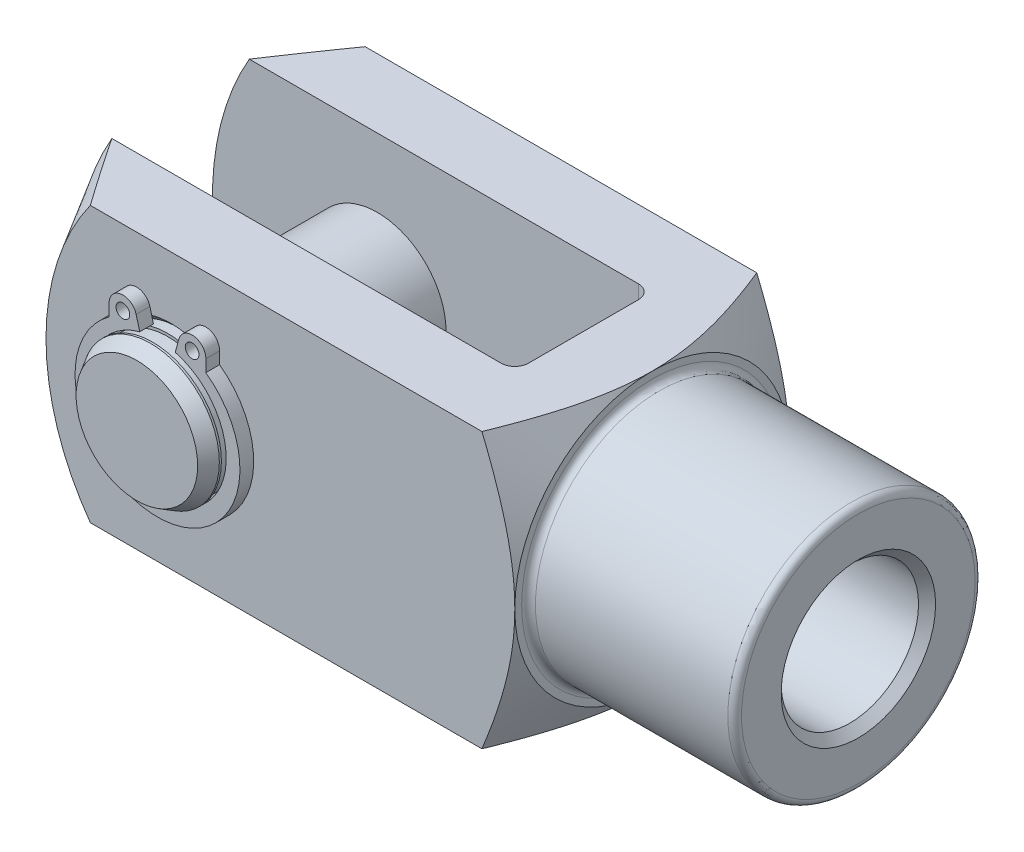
ISO-10303-21;
HEADER;
FILE_DESCRIPTION(('STEP AP214'),'2;1');
FILE_NAME('part.step','',(''),(''),'','','');
FILE_SCHEMA(('AUTOMOTIVE_DESIGN { 1 0 10303 214 1 1 1 1 }'));
ENDSEC;
DATA;
#1=APPLICATION_CONTEXT('core data for automotive mechanical design processes');
#2=APPLICATION_PROTOCOL_DEFINITION('international standard','automotive_design',2000,#1);
#3=PRODUCT_CONTEXT('',#1,'mechanical');
#4=PRODUCT('Part','Part','',(#3));
#5=PRODUCT_RELATED_PRODUCT_CATEGORY('part','',(#4));
#6=PRODUCT_DEFINITION_FORMATION('','',#4);
#7=PRODUCT_DEFINITION_CONTEXT('part definition',#1,'design');
#8=PRODUCT_DEFINITION('design','',#6,#7);
#9=PRODUCT_DEFINITION_SHAPE('','',#8);
#10=(LENGTH_UNIT() NAMED_UNIT(*) SI_UNIT(.MILLI.,.METRE.));
#11=(NAMED_UNIT(*) PLANE_ANGLE_UNIT() SI_UNIT($,.RADIAN.));
#12=(NAMED_UNIT(*) SI_UNIT($,.STERADIAN.) SOLID_ANGLE_UNIT());
#13=UNCERTAINTY_MEASURE_WITH_UNIT(LENGTH_MEASURE(1.E-05),#10,'distance_accuracy_value','');
#14=(GEOMETRIC_REPRESENTATION_CONTEXT(3) GLOBAL_UNCERTAINTY_ASSIGNED_CONTEXT((#13)) GLOBAL_UNIT_ASSIGNED_CONTEXT((#10,
#11,#12)) REPRESENTATION_CONTEXT('',''));
#15=CARTESIAN_POINT('',(0.,0.,0.));
#16=DIRECTION('',(0.,0.,1.));
#17=DIRECTION('',(1.,0.,0.));
#18=AXIS2_PLACEMENT_3D('',#15,#16,#17);
#19=CARTESIAN_POINT('',(-40.,0.,12.5));
#20=DIRECTION('',(0.,0.,-1.));
#21=DIRECTION('',(-1.,0.,0.));
#22=AXIS2_PLACEMENT_3D('',#19,#20,#21);
#23=CYLINDRICAL_SURFACE('',#22,5.);
#24=CARTESIAN_POINT('',(-40.,0.,10.25));
#25=DIRECTION('',(0.,0.,1.));
#26=DIRECTION('',(1.,0.,0.));
#27=AXIS2_PLACEMENT_3D('',#24,#25,#26);
#28=CIRCLE('',#27,5.);
#29=CARTESIAN_POINT('',(-35.,0.,10.25));
#30=VERTEX_POINT('',#29);
#31=EDGE_CURVE('P0_E55',#30,#30,#28,.T.);
#32=ORIENTED_EDGE('',*,*,#31,.F.);
#33=EDGE_LOOP('',(#32));
#34=FACE_BOUND('',#33,.T.);
#35=CARTESIAN_POINT('',(-40.,0.,-10.25));
#36=DIRECTION('',(0.,0.,1.));
#37=DIRECTION('',(1.,0.,0.));
#38=AXIS2_PLACEMENT_3D('',#35,#36,#37);
#39=CIRCLE('',#38,5.);
#40=CARTESIAN_POINT('',(-35.,0.,-10.25));
#41=VERTEX_POINT('',#40);
#42=EDGE_CURVE('P0_E40',#41,#41,#39,.T.);
#43=ORIENTED_EDGE('',*,*,#42,.T.);
#44=EDGE_LOOP('',(#43));
#45=FACE_BOUND('',#44,.T.);
#46=ADVANCED_FACE('P0_F14',(#34,#45),#23,.T.);
#47=CARTESIAN_POINT('',(-40.,0.,-11.35));
#48=DIRECTION('',(0.,0.,1.));
#49=DIRECTION('',(1.,0.,0.));
#50=AXIS2_PLACEMENT_3D('',#47,#48,#49);
#51=CIRCLE('',#50,5.);
#52=CARTESIAN_POINT('',(-35.,0.,-11.35));
#53=VERTEX_POINT('',#52);
#54=EDGE_CURVE('P0_E43',#53,#53,#51,.T.);
#55=ORIENTED_EDGE('',*,*,#54,.F.);
#56=EDGE_LOOP('',(#55));
#57=FACE_BOUND('',#56,.T.);
#58=CARTESIAN_POINT('',(-40.,0.,-11.5));
#59=DIRECTION('',(0.,0.,1.));
#60=DIRECTION('',(1.,0.,0.));
#61=AXIS2_PLACEMENT_3D('',#58,#59,#60);
#62=CIRCLE('',#61,5.);
#63=CARTESIAN_POINT('',(-35.,0.,-11.5));
#64=VERTEX_POINT('',#63);
#65=EDGE_CURVE('P0_E25',#64,#64,#62,.T.);
#66=ORIENTED_EDGE('',*,*,#65,.T.);
#67=EDGE_LOOP('',(#66));
#68=FACE_BOUND('',#67,.T.);
#69=ADVANCED_FACE('P0_F63',(#57,#68),#23,.T.);
#70=CARTESIAN_POINT('',(-40.,0.,-12.5));
#71=DIRECTION('',(0.,0.,1.));
#72=DIRECTION('',(1.,0.,0.));
#73=AXIS2_PLACEMENT_3D('',#70,#71,#72);
#74=PLANE('',#73);
#75=CARTESIAN_POINT('',(-40.,0.,-12.5));
#76=DIRECTION('',(0.,0.,1.));
#77=DIRECTION('',(1.,0.,0.));
#78=AXIS2_PLACEMENT_3D('',#75,#76,#77);
#79=CIRCLE('',#78,4.42264973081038);
#80=CARTESIAN_POINT('',(-35.5773502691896,0.,-12.5));
#81=VERTEX_POINT('',#80);
#82=EDGE_CURVE('P0_E21',#81,#81,#79,.F.);
#83=ORIENTED_EDGE('',*,*,#82,.T.);
#84=EDGE_LOOP('',(#83));
#85=FACE_BOUND('',#84,.T.);
#86=ADVANCED_FACE('P0_F89',(#85),#74,.F.);
#87=CARTESIAN_POINT('',(-40.,0.,-11.5));
#88=DIRECTION('',(0.,0.,1.));
#89=DIRECTION('',(1.,0.,0.));
#90=AXIS2_PLACEMENT_3D('',#87,#88,#89);
#91=CONICAL_SURFACE('',#90,5.,0.523598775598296);
#92=ORIENTED_EDGE('',*,*,#82,.F.);
#93=EDGE_LOOP('',(#92));
#94=FACE_BOUND('',#93,.T.);
#95=ORIENTED_EDGE('',*,*,#65,.F.);
#96=EDGE_LOOP('',(#95));
#97=FACE_BOUND('',#96,.T.);
#98=ADVANCED_FACE('P0_F83',(#94,#97),#91,.T.);
#99=CARTESIAN_POINT('',(-40.,5.,-11.35));
#100=DIRECTION('',(0.,0.,-1.));
#101=DIRECTION('',(-1.,0.,0.));
#102=AXIS2_PLACEMENT_3D('',#99,#100,#101);
#103=PLANE('',#102);
#104=CARTESIAN_POINT('',(-40.,0.,-11.35));
#105=DIRECTION('',(0.,0.,1.));
#106=DIRECTION('',(1.,0.,0.));
#107=AXIS2_PLACEMENT_3D('',#104,#105,#106);
#108=CIRCLE('',#107,4.8);
#109=CARTESIAN_POINT('',(-35.2,0.,-11.35));
#110=VERTEX_POINT('',#109);
#111=EDGE_CURVE('P0_E34',#110,#110,#108,.T.);
#112=ORIENTED_EDGE('',*,*,#111,.F.);
#113=EDGE_LOOP('',(#112));
#114=FACE_BOUND('',#113,.T.);
#115=ORIENTED_EDGE('',*,*,#54,.T.);
#116=EDGE_LOOP('',(#115));
#117=FACE_BOUND('',#116,.T.);
#118=ADVANCED_FACE('P0_F77',(#114,#117),#103,.F.);
#119=CARTESIAN_POINT('',(-40.,0.,11.5));
#120=DIRECTION('',(0.,0.,1.));
#121=DIRECTION('',(1.,0.,0.));
#122=AXIS2_PLACEMENT_3D('',#119,#120,#121);
#123=CYLINDRICAL_SURFACE('',#122,4.8);
#124=CARTESIAN_POINT('',(-40.,0.,-10.25));
#125=DIRECTION('',(0.,0.,1.));
#126=DIRECTION('',(1.,0.,0.));
#127=AXIS2_PLACEMENT_3D('',#124,#125,#126);
#128=CIRCLE('',#127,4.8);
#129=CARTESIAN_POINT('',(-35.2,0.,-10.25));
#130=VERTEX_POINT('',#129);
#131=EDGE_CURVE('P0_E37',#130,#130,#128,.T.);
#132=ORIENTED_EDGE('',*,*,#131,.F.);
#133=EDGE_LOOP('',(#132));
#134=FACE_BOUND('',#133,.T.);
#135=ORIENTED_EDGE('',*,*,#111,.T.);
#136=EDGE_LOOP('',(#135));
#137=FACE_BOUND('',#136,.T.);
#138=ADVANCED_FACE('P0_F71',(#134,#137),#123,.T.);
#139=CARTESIAN_POINT('',(-40.,5.,-10.25));
#140=DIRECTION('',(0.,0.,1.));
#141=DIRECTION('',(1.,0.,0.));
#142=AXIS2_PLACEMENT_3D('',#139,#140,#141);
#143=PLANE('',#142);
#144=ORIENTED_EDGE('',*,*,#42,.F.);
#145=EDGE_LOOP('',(#144));
#146=FACE_BOUND('',#145,.T.);
#147=ORIENTED_EDGE('',*,*,#131,.T.);
#148=EDGE_LOOP('',(#147));
#149=FACE_BOUND('',#148,.T.);
#150=ADVANCED_FACE('P0_F68',(#146,#149),#143,.F.);
#151=CARTESIAN_POINT('',(-40.,5.,10.25));
#152=DIRECTION('',(0.,0.,-1.));
#153=DIRECTION('',(-1.,0.,0.));
#154=AXIS2_PLACEMENT_3D('',#151,#152,#153);
#155=PLANE('',#154);
#156=CARTESIAN_POINT('',(-40.,0.,10.25));
#157=DIRECTION('',(0.,0.,1.));
#158=DIRECTION('',(1.,0.,0.));
#159=AXIS2_PLACEMENT_3D('',#156,#157,#158);
#160=CIRCLE('',#159,4.8);
#161=CARTESIAN_POINT('',(-35.2,0.,10.25));
#162=VERTEX_POINT('',#161);
#163=EDGE_CURVE('P0_E46',#162,#162,#160,.T.);
#164=ORIENTED_EDGE('',*,*,#163,.F.);
#165=EDGE_LOOP('',(#164));
#166=FACE_BOUND('',#165,.T.);
#167=ORIENTED_EDGE('',*,*,#31,.T.);
#168=EDGE_LOOP('',(#167));
#169=FACE_BOUND('',#168,.T.);
#170=ADVANCED_FACE('P0_F59',(#166,#169),#155,.F.);
#171=CARTESIAN_POINT('',(-40.,0.,11.5));
#172=DIRECTION('',(0.,0.,1.));
#173=DIRECTION('',(1.,0.,0.));
#174=AXIS2_PLACEMENT_3D('',#171,#172,#173);
#175=CYLINDRICAL_SURFACE('',#174,4.8);
#176=CARTESIAN_POINT('',(-40.,0.,11.35));
#177=DIRECTION('',(0.,0.,1.));
#178=DIRECTION('',(1.,0.,0.));
#179=AXIS2_PLACEMENT_3D('',#176,#177,#178);
#180=CIRCLE('',#179,4.8);
#181=CARTESIAN_POINT('',(-35.2,0.,11.35));
#182=VERTEX_POINT('',#181);
#183=EDGE_CURVE('P0_E49',#182,#182,#180,.T.);
#184=ORIENTED_EDGE('',*,*,#183,.F.);
#185=EDGE_LOOP('',(#184));
#186=FACE_BOUND('',#185,.T.);
#187=ORIENTED_EDGE('',*,*,#163,.T.);
#188=EDGE_LOOP('',(#187));
#189=FACE_BOUND('',#188,.T.);
#190=ADVANCED_FACE('P0_F108',(#186,#189),#175,.T.);
#191=CARTESIAN_POINT('',(-40.,5.,11.35));
#192=DIRECTION('',(0.,0.,1.));
#193=DIRECTION('',(1.,0.,0.));
#194=AXIS2_PLACEMENT_3D('',#191,#192,#193);
#195=PLANE('',#194);
#196=CARTESIAN_POINT('',(-40.,0.,11.35));
#197=DIRECTION('',(0.,0.,1.));
#198=DIRECTION('',(1.,0.,0.));
#199=AXIS2_PLACEMENT_3D('',#196,#197,#198);
#200=CIRCLE('',#199,5.);
#201=CARTESIAN_POINT('',(-35.,0.,11.35));
#202=VERTEX_POINT('',#201);
#203=EDGE_CURVE('P0_E52',#202,#202,#200,.T.);
#204=ORIENTED_EDGE('',*,*,#203,.F.);
#205=EDGE_LOOP('',(#204));
#206=FACE_BOUND('',#205,.T.);
#207=ORIENTED_EDGE('',*,*,#183,.T.);
#208=EDGE_LOOP('',(#207));
#209=FACE_BOUND('',#208,.T.);
#210=ADVANCED_FACE('P0_F104',(#206,#209),#195,.F.);
#211=CARTESIAN_POINT('',(-40.,0.,12.5));
#212=DIRECTION('',(0.,0.,1.));
#213=DIRECTION('',(1.,0.,0.));
#214=AXIS2_PLACEMENT_3D('',#211,#212,#213);
#215=PLANE('',#214);
#216=CARTESIAN_POINT('',(-40.,0.,12.5));
#217=DIRECTION('',(0.,0.,1.));
#218=DIRECTION('',(1.,0.,0.));
#219=AXIS2_PLACEMENT_3D('',#216,#217,#218);
#220=CIRCLE('',#219,4.42264973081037);
#221=CARTESIAN_POINT('',(-35.5773502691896,0.,12.5));
#222=VERTEX_POINT('',#221);
#223=EDGE_CURVE('P0_E10',#222,#222,#220,.T.);
#224=ORIENTED_EDGE('',*,*,#223,.T.);
#225=EDGE_LOOP('',(#224));
#226=FACE_BOUND('',#225,.T.);
#227=ADVANCED_FACE('P0_F102',(#226),#215,.T.);
#228=CARTESIAN_POINT('',(-40.,0.,12.5));
#229=DIRECTION('',(0.,0.,-1.));
#230=DIRECTION('',(-1.,0.,0.));
#231=AXIS2_PLACEMENT_3D('',#228,#229,#230);
#232=CONICAL_SURFACE('',#231,4.42264973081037,0.523598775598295);
#233=CARTESIAN_POINT('',(-40.,0.,11.5));
#234=DIRECTION('',(0.,0.,1.));
#235=DIRECTION('',(1.,0.,0.));
#236=AXIS2_PLACEMENT_3D('',#233,#234,#235);
#237=CIRCLE('',#236,5.);
#238=CARTESIAN_POINT('',(-35.,0.,11.5));
#239=VERTEX_POINT('',#238);
#240=EDGE_CURVE('P0_E29',#239,#239,#237,.F.);
#241=ORIENTED_EDGE('',*,*,#240,.F.);
#242=EDGE_LOOP('',(#241));
#243=FACE_BOUND('',#242,.T.);
#244=ORIENTED_EDGE('',*,*,#223,.F.);
#245=EDGE_LOOP('',(#244));
#246=FACE_BOUND('',#245,.T.);
#247=ADVANCED_FACE('P0_F16',(#243,#246),#232,.T.);
#248=ORIENTED_EDGE('',*,*,#203,.T.);
#249=EDGE_LOOP('',(#248));
#250=FACE_BOUND('',#249,.T.);
#251=ORIENTED_EDGE('',*,*,#240,.T.);
#252=EDGE_LOOP('',(#251));
#253=FACE_BOUND('',#252,.T.);
#254=ADVANCED_FACE('P0_F65',(#250,#253),#23,.T.);
#255=CLOSED_SHELL('',(#46,#69,#86,#98,#118,#138,#150,#170,#190,#210,#227,#247,#254));
#256=MANIFOLD_SOLID_BREP('P0_B1',#255);
#257=CARTESIAN_POINT('',(-40.,0.,10.9999999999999));
#258=DIRECTION('',(0.,0.,1.));
#259=DIRECTION('',(1.,0.,0.));
#260=AXIS2_PLACEMENT_3D('',#257,#258,#259);
#261=PLANE('',#260);
#262=CARTESIAN_POINT('',(-42.5188400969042,5.5367359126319,10.9999999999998));
#263=DIRECTION('',(0.,0.,1.));
#264=DIRECTION('',(1.,0.,0.));
#265=AXIS2_PLACEMENT_3D('',#262,#263,#264);
#266=CIRCLE('',#265,0.5);
#267=CARTESIAN_POINT('',(-42.0188400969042,5.5367359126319,10.9999999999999));
#268=VERTEX_POINT('',#267);
#269=EDGE_CURVE('P1_E117',#268,#268,#266,.T.);
#270=ORIENTED_EDGE('',*,*,#269,.F.);
#271=EDGE_LOOP('',(#270));
#272=FACE_BOUND('',#271,.T.);
#273=CARTESIAN_POINT('',(-40.,0.,10.9999999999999));
#274=DIRECTION('',(0.,0.,-1.));
#275=DIRECTION('',(1.,0.,0.));
#276=AXIS2_PLACEMENT_3D('',#273,#274,#275);
#277=CIRCLE('',#276,5.);
#278=CARTESIAN_POINT('',(-38.7059047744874,4.82962913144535,10.9999999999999));
#279=VERTEX_POINT('',#278);
#280=CARTESIAN_POINT('',(-41.2940952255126,4.82962913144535,10.9999999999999));
#281=VERTEX_POINT('',#280);
#282=EDGE_CURVE('P1_E128',#279,#281,#277,.T.);
#283=ORIENTED_EDGE('',*,*,#282,.T.);
#284=DIRECTION('',(-0.258819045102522,0.965925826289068,0.));
#285=VECTOR('',#284,1.);
#286=CARTESIAN_POINT('',(-41.2940952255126,4.82962913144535,10.9999999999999));
#287=LINE('',#286,#285);
#288=CARTESIAN_POINT('',(-41.5529142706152,5.79555495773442,10.9999999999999));
#289=VERTEX_POINT('',#288);
#290=EDGE_CURVE('P1_E76',#281,#289,#287,.T.);
#291=ORIENTED_EDGE('',*,*,#290,.T.);
#292=CARTESIAN_POINT('',(-42.5188400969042,5.5367359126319,10.9999999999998));
#293=DIRECTION('',(0.,0.,1.));
#294=DIRECTION('',(1.,0.,0.));
#295=AXIS2_PLACEMENT_3D('',#292,#293,#294);
#296=CIRCLE('',#295,0.999999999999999);
#297=CARTESIAN_POINT('',(-43.5188400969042,5.5367359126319,10.9999999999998));
#298=VERTEX_POINT('',#297);
#299=EDGE_CURVE('P1_E143',#289,#298,#296,.T.);
#300=ORIENTED_EDGE('',*,*,#299,.T.);
#301=DIRECTION('',(0.,-1.,0.));
#302=VECTOR('',#301,1.);
#303=CARTESIAN_POINT('',(-43.5188400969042,5.5367359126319,10.9999999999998));
#304=LINE('',#303,#302);
#305=CARTESIAN_POINT('',(-43.5188400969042,4.65981114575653,10.9999999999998));
#306=VERTEX_POINT('',#305);
#307=EDGE_CURVE('P1_E156',#298,#306,#304,.T.);
#308=ORIENTED_EDGE('',*,*,#307,.T.);
#309=CARTESIAN_POINT('',(-40.,-0.199999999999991,10.9999999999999));
#310=DIRECTION('',(0.,0.,1.));
#311=DIRECTION('',(1.,0.,0.));
#312=AXIS2_PLACEMENT_3D('',#309,#310,#311);
#313=CIRCLE('',#312,6.);
#314=CARTESIAN_POINT('',(-36.4811599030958,4.65981114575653,10.9999999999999));
#315=VERTEX_POINT('',#314);
#316=EDGE_CURVE('P1_E95',#306,#315,#313,.T.);
#317=ORIENTED_EDGE('',*,*,#316,.T.);
#318=DIRECTION('',(0.,1.,0.));
#319=VECTOR('',#318,1.);
#320=CARTESIAN_POINT('',(-36.4811599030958,5.5367359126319,10.9999999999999));
#321=LINE('',#320,#319);
#322=CARTESIAN_POINT('',(-36.4811599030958,5.5367359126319,10.9999999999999));
#323=VERTEX_POINT('',#322);
#324=EDGE_CURVE('P1_E89',#315,#323,#321,.T.);
#325=ORIENTED_EDGE('',*,*,#324,.T.);
#326=CARTESIAN_POINT('',(-37.4811599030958,5.5367359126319,10.9999999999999));
#327=DIRECTION('',(0.,0.,1.));
#328=DIRECTION('',(-1.,0.,0.));
#329=AXIS2_PLACEMENT_3D('',#326,#327,#328);
#330=CIRCLE('',#329,0.999999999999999);
#331=CARTESIAN_POINT('',(-38.4470857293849,5.79555495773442,10.9999999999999));
#332=VERTEX_POINT('',#331);
#333=EDGE_CURVE('P1_E93',#323,#332,#330,.T.);
#334=ORIENTED_EDGE('',*,*,#333,.T.);
#335=DIRECTION('',(-0.258819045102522,-0.965925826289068,0.));
#336=VECTOR('',#335,1.);
#337=CARTESIAN_POINT('',(-38.7059047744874,4.82962913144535,10.9999999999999));
#338=LINE('',#337,#336);
#339=EDGE_CURVE('P1_E33',#332,#279,#338,.T.);
#340=ORIENTED_EDGE('',*,*,#339,.T.);
#341=EDGE_LOOP('',(#283,#291,#300,#308,#317,#325,#334,#340));
#342=FACE_BOUND('',#341,.T.);
#343=CARTESIAN_POINT('',(-37.4811599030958,5.5367359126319,10.9999999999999));
#344=DIRECTION('',(0.,0.,1.));
#345=DIRECTION('',(-1.,0.,0.));
#346=AXIS2_PLACEMENT_3D('',#343,#344,#345);
#347=CIRCLE('',#346,0.5);
#348=CARTESIAN_POINT('',(-37.9811599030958,5.5367359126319,10.9999999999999));
#349=VERTEX_POINT('',#348);
#350=EDGE_CURVE('P1_E165',#349,#349,#347,.T.);
#351=ORIENTED_EDGE('',*,*,#350,.F.);
#352=EDGE_LOOP('',(#351));
#353=FACE_BOUND('',#352,.T.);
#354=ADVANCED_FACE('P1_F16',(#272,#342,#353),#261,.T.);
#355=CARTESIAN_POINT('',(-40.,0.,9.99999999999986));
#356=DIRECTION('',(0.,0.,1.));
#357=DIRECTION('',(1.,0.,0.));
#358=AXIS2_PLACEMENT_3D('',#355,#356,#357);
#359=PLANE('',#358);
#360=CARTESIAN_POINT('',(-42.5188400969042,5.5367359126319,9.99999999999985));
#361=DIRECTION('',(0.,0.,1.));
#362=DIRECTION('',(1.,0.,0.));
#363=AXIS2_PLACEMENT_3D('',#360,#361,#362);
#364=CIRCLE('',#363,0.5);
#365=CARTESIAN_POINT('',(-42.0188400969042,5.5367359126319,9.99999999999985));
#366=VERTEX_POINT('',#365);
#367=EDGE_CURVE('P1_E162',#366,#366,#364,.T.);
#368=ORIENTED_EDGE('',*,*,#367,.T.);
#369=EDGE_LOOP('',(#368));
#370=FACE_BOUND('',#369,.T.);
#371=CARTESIAN_POINT('',(-40.,0.,9.99999999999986));
#372=DIRECTION('',(0.,0.,-1.));
#373=DIRECTION('',(1.,0.,0.));
#374=AXIS2_PLACEMENT_3D('',#371,#372,#373);
#375=CIRCLE('',#374,5.);
#376=CARTESIAN_POINT('',(-38.7059047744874,4.82962913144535,9.99999999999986));
#377=VERTEX_POINT('',#376);
#378=CARTESIAN_POINT('',(-41.2940952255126,4.82962913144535,9.99999999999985));
#379=VERTEX_POINT('',#378);
#380=EDGE_CURVE('P1_E113',#377,#379,#375,.T.);
#381=ORIENTED_EDGE('',*,*,#380,.F.);
#382=DIRECTION('',(-0.258819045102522,-0.965925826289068,0.));
#383=VECTOR('',#382,1.);
#384=CARTESIAN_POINT('',(-38.7059047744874,4.82962913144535,9.99999999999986));
#385=LINE('',#384,#383);
#386=CARTESIAN_POINT('',(-38.4470857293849,5.79555495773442,9.99999999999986));
#387=VERTEX_POINT('',#386);
#388=EDGE_CURVE('P1_E68',#387,#377,#385,.T.);
#389=ORIENTED_EDGE('',*,*,#388,.F.);
#390=CARTESIAN_POINT('',(-37.4811599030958,5.5367359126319,9.99999999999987));
#391=DIRECTION('',(0.,0.,1.));
#392=DIRECTION('',(-1.,0.,0.));
#393=AXIS2_PLACEMENT_3D('',#390,#391,#392);
#394=CIRCLE('',#393,0.999999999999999);
#395=CARTESIAN_POINT('',(-36.4811599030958,5.5367359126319,9.99999999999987));
#396=VERTEX_POINT('',#395);
#397=EDGE_CURVE('P1_E62',#396,#387,#394,.T.);
#398=ORIENTED_EDGE('',*,*,#397,.F.);
#399=DIRECTION('',(0.,1.,0.));
#400=VECTOR('',#399,1.);
#401=CARTESIAN_POINT('',(-36.4811599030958,5.5367359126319,9.99999999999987));
#402=LINE('',#401,#400);
#403=CARTESIAN_POINT('',(-36.4811599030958,4.65981114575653,9.99999999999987));
#404=VERTEX_POINT('',#403);
#405=EDGE_CURVE('P1_E103',#404,#396,#402,.T.);
#406=ORIENTED_EDGE('',*,*,#405,.F.);
#407=CARTESIAN_POINT('',(-40.,-0.199999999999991,9.99999999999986));
#408=DIRECTION('',(0.,0.,1.));
#409=DIRECTION('',(1.,0.,0.));
#410=AXIS2_PLACEMENT_3D('',#407,#408,#409);
#411=CIRCLE('',#410,6.);
#412=CARTESIAN_POINT('',(-43.5188400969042,4.65981114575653,9.99999999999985));
#413=VERTEX_POINT('',#412);
#414=EDGE_CURVE('P1_E123',#413,#404,#411,.T.);
#415=ORIENTED_EDGE('',*,*,#414,.F.);
#416=DIRECTION('',(0.,-1.,0.));
#417=VECTOR('',#416,1.);
#418=CARTESIAN_POINT('',(-43.5188400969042,5.5367359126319,9.99999999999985));
#419=LINE('',#418,#417);
#420=CARTESIAN_POINT('',(-43.5188400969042,5.5367359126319,9.99999999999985));
#421=VERTEX_POINT('',#420);
#422=EDGE_CURVE('P1_E121',#421,#413,#419,.T.);
#423=ORIENTED_EDGE('',*,*,#422,.F.);
#424=CARTESIAN_POINT('',(-42.5188400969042,5.5367359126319,9.99999999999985));
#425=DIRECTION('',(0.,0.,1.));
#426=DIRECTION('',(1.,0.,0.));
#427=AXIS2_PLACEMENT_3D('',#424,#425,#426);
#428=CIRCLE('',#427,0.999999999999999);
#429=CARTESIAN_POINT('',(-41.5529142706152,5.79555495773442,9.99999999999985));
#430=VERTEX_POINT('',#429);
#431=EDGE_CURVE('P1_E119',#430,#421,#428,.T.);
#432=ORIENTED_EDGE('',*,*,#431,.F.);
#433=DIRECTION('',(-0.258819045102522,0.965925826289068,0.));
#434=VECTOR('',#433,1.);
#435=CARTESIAN_POINT('',(-41.2940952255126,4.82962913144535,9.99999999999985));
#436=LINE('',#435,#434);
#437=EDGE_CURVE('P1_E116',#379,#430,#436,.T.);
#438=ORIENTED_EDGE('',*,*,#437,.F.);
#439=EDGE_LOOP('',(#381,#389,#398,#406,#415,#423,#432,#438));
#440=FACE_BOUND('',#439,.T.);
#441=CARTESIAN_POINT('',(-37.4811599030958,5.5367359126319,9.99999999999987));
#442=DIRECTION('',(0.,0.,1.));
#443=DIRECTION('',(-1.,0.,0.));
#444=AXIS2_PLACEMENT_3D('',#441,#442,#443);
#445=CIRCLE('',#444,0.5);
#446=CARTESIAN_POINT('',(-37.9811599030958,5.5367359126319,9.99999999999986));
#447=VERTEX_POINT('',#446);
#448=EDGE_CURVE('P1_E168',#447,#447,#445,.T.);
#449=ORIENTED_EDGE('',*,*,#448,.T.);
#450=EDGE_LOOP('',(#449));
#451=FACE_BOUND('',#450,.T.);
#452=ADVANCED_FACE('P1_F147',(#370,#440,#451),#359,.F.);
#453=CARTESIAN_POINT('',(-40.,0.,10.9999999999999));
#454=DIRECTION('',(0.,0.,-1.));
#455=DIRECTION('',(-1.,0.,0.));
#456=AXIS2_PLACEMENT_3D('',#453,#454,#455);
#457=CYLINDRICAL_SURFACE('',#456,5.);
#458=ORIENTED_EDGE('',*,*,#380,.T.);
#459=DIRECTION('',(0.,0.,-1.));
#460=VECTOR('',#459,1.);
#461=CARTESIAN_POINT('',(-41.2940952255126,4.82962913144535,10.9999999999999));
#462=LINE('',#461,#460);
#463=EDGE_CURVE('P1_E11',#281,#379,#462,.T.);
#464=ORIENTED_EDGE('',*,*,#463,.F.);
#465=ORIENTED_EDGE('',*,*,#282,.F.);
#466=DIRECTION('',(0.,0.,-1.));
#467=VECTOR('',#466,1.);
#468=CARTESIAN_POINT('',(-38.7059047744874,4.82962913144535,10.9999999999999));
#469=LINE('',#468,#467);
#470=EDGE_CURVE('P1_E109',#279,#377,#469,.T.);
#471=ORIENTED_EDGE('',*,*,#470,.T.);
#472=EDGE_LOOP('',(#458,#464,#465,#471));
#473=FACE_BOUND('',#472,.T.);
#474=ADVANCED_FACE('P1_F18',(#473),#457,.F.);
#475=CARTESIAN_POINT('',(-41.2940952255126,4.82962913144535,10.9999999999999));
#476=DIRECTION('',(-0.965925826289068,-0.258819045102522,0.));
#477=DIRECTION('',(0.258819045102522,-0.965925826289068,0.));
#478=AXIS2_PLACEMENT_3D('',#475,#476,#477);
#479=PLANE('',#478);
#480=ORIENTED_EDGE('',*,*,#437,.T.);
#481=DIRECTION('',(0.,0.,-1.));
#482=VECTOR('',#481,1.);
#483=CARTESIAN_POINT('',(-41.5529142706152,5.79555495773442,10.9999999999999));
#484=LINE('',#483,#482);
#485=EDGE_CURVE('P1_E25',#289,#430,#484,.T.);
#486=ORIENTED_EDGE('',*,*,#485,.F.);
#487=ORIENTED_EDGE('',*,*,#290,.F.);
#488=ORIENTED_EDGE('',*,*,#463,.T.);
#489=EDGE_LOOP('',(#480,#486,#487,#488));
#490=FACE_BOUND('',#489,.T.);
#491=ADVANCED_FACE('P1_F202',(#490),#479,.F.);
#492=CARTESIAN_POINT('',(-42.5188400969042,5.5367359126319,10.9999999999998));
#493=DIRECTION('',(0.,0.,-1.));
#494=DIRECTION('',(-1.,0.,0.));
#495=AXIS2_PLACEMENT_3D('',#492,#493,#494);
#496=CYLINDRICAL_SURFACE('',#495,0.999999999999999);
#497=ORIENTED_EDGE('',*,*,#431,.T.);
#498=DIRECTION('',(0.,0.,-1.));
#499=VECTOR('',#498,1.);
#500=CARTESIAN_POINT('',(-43.5188400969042,5.5367359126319,10.9999999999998));
#501=LINE('',#500,#499);
#502=EDGE_CURVE('P1_E135',#298,#421,#501,.T.);
#503=ORIENTED_EDGE('',*,*,#502,.F.);
#504=ORIENTED_EDGE('',*,*,#299,.F.);
#505=ORIENTED_EDGE('',*,*,#485,.T.);
#506=EDGE_LOOP('',(#497,#503,#504,#505));
#507=FACE_BOUND('',#506,.T.);
#508=ADVANCED_FACE('P1_F141',(#507),#496,.T.);
#509=CARTESIAN_POINT('',(-43.5188400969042,5.5367359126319,10.9999999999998));
#510=DIRECTION('',(1.,0.,0.));
#511=DIRECTION('',(0.,1.,0.));
#512=AXIS2_PLACEMENT_3D('',#509,#510,#511);
#513=PLANE('',#512);
#514=ORIENTED_EDGE('',*,*,#422,.T.);
#515=DIRECTION('',(0.,0.,-1.));
#516=VECTOR('',#515,1.);
#517=CARTESIAN_POINT('',(-43.5188400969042,4.65981114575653,10.9999999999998));
#518=LINE('',#517,#516);
#519=EDGE_CURVE('P1_E132',#306,#413,#518,.T.);
#520=ORIENTED_EDGE('',*,*,#519,.F.);
#521=ORIENTED_EDGE('',*,*,#307,.F.);
#522=ORIENTED_EDGE('',*,*,#502,.T.);
#523=EDGE_LOOP('',(#514,#520,#521,#522));
#524=FACE_BOUND('',#523,.T.);
#525=ADVANCED_FACE('P1_F152',(#524),#513,.F.);
#526=CARTESIAN_POINT('',(-40.,-0.199999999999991,10.9999999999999));
#527=DIRECTION('',(0.,0.,-1.));
#528=DIRECTION('',(-1.,0.,0.));
#529=AXIS2_PLACEMENT_3D('',#526,#527,#528);
#530=CYLINDRICAL_SURFACE('',#529,6.);
#531=ORIENTED_EDGE('',*,*,#414,.T.);
#532=DIRECTION('',(0.,0.,-1.));
#533=VECTOR('',#532,1.);
#534=CARTESIAN_POINT('',(-36.4811599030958,4.65981114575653,10.9999999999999));
#535=LINE('',#534,#533);
#536=EDGE_CURVE('P1_E104',#315,#404,#535,.T.);
#537=ORIENTED_EDGE('',*,*,#536,.F.);
#538=ORIENTED_EDGE('',*,*,#316,.F.);
#539=ORIENTED_EDGE('',*,*,#519,.T.);
#540=EDGE_LOOP('',(#531,#537,#538,#539));
#541=FACE_BOUND('',#540,.T.);
#542=ADVANCED_FACE('P1_F155',(#541),#530,.T.);
#543=CARTESIAN_POINT('',(-36.4811599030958,5.5367359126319,10.9999999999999));
#544=DIRECTION('',(-1.,0.,0.));
#545=DIRECTION('',(0.,-1.,0.));
#546=AXIS2_PLACEMENT_3D('',#543,#544,#545);
#547=PLANE('',#546);
#548=ORIENTED_EDGE('',*,*,#405,.T.);
#549=DIRECTION('',(0.,0.,-1.));
#550=VECTOR('',#549,1.);
#551=CARTESIAN_POINT('',(-36.4811599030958,5.5367359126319,10.9999999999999));
#552=LINE('',#551,#550);
#553=EDGE_CURVE('P1_E100',#323,#396,#552,.T.);
#554=ORIENTED_EDGE('',*,*,#553,.F.);
#555=ORIENTED_EDGE('',*,*,#324,.F.);
#556=ORIENTED_EDGE('',*,*,#536,.T.);
#557=EDGE_LOOP('',(#548,#554,#555,#556));
#558=FACE_BOUND('',#557,.T.);
#559=ADVANCED_FACE('P1_F101',(#558),#547,.F.);
#560=CARTESIAN_POINT('',(-37.4811599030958,5.5367359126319,10.9999999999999));
#561=DIRECTION('',(0.,0.,-1.));
#562=DIRECTION('',(-1.,0.,0.));
#563=AXIS2_PLACEMENT_3D('',#560,#561,#562);
#564=CYLINDRICAL_SURFACE('',#563,0.999999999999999);
#565=ORIENTED_EDGE('',*,*,#397,.T.);
#566=DIRECTION('',(0.,0.,-1.));
#567=VECTOR('',#566,1.);
#568=CARTESIAN_POINT('',(-38.4470857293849,5.79555495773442,10.9999999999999));
#569=LINE('',#568,#567);
#570=EDGE_CURVE('P1_E105',#332,#387,#569,.T.);
#571=ORIENTED_EDGE('',*,*,#570,.F.);
#572=ORIENTED_EDGE('',*,*,#333,.F.);
#573=ORIENTED_EDGE('',*,*,#553,.T.);
#574=EDGE_LOOP('',(#565,#571,#572,#573));
#575=FACE_BOUND('',#574,.T.);
#576=ADVANCED_FACE('P1_F107',(#575),#564,.T.);
#577=CARTESIAN_POINT('',(-38.7059047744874,4.82962913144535,10.9999999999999));
#578=DIRECTION('',(0.965925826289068,-0.258819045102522,0.));
#579=DIRECTION('',(0.258819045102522,0.965925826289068,0.));
#580=AXIS2_PLACEMENT_3D('',#577,#578,#579);
#581=PLANE('',#580);
#582=ORIENTED_EDGE('',*,*,#388,.T.);
#583=ORIENTED_EDGE('',*,*,#470,.F.);
#584=ORIENTED_EDGE('',*,*,#339,.F.);
#585=ORIENTED_EDGE('',*,*,#570,.T.);
#586=EDGE_LOOP('',(#582,#583,#584,#585));
#587=FACE_BOUND('',#586,.T.);
#588=ADVANCED_FACE('P1_F190',(#587),#581,.F.);
#589=CARTESIAN_POINT('',(-42.5188400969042,5.5367359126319,10.9999999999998));
#590=DIRECTION('',(0.,0.,-1.));
#591=DIRECTION('',(-1.,0.,0.));
#592=AXIS2_PLACEMENT_3D('',#589,#590,#591);
#593=CYLINDRICAL_SURFACE('',#592,0.5);
#594=ORIENTED_EDGE('',*,*,#269,.T.);
#595=EDGE_LOOP('',(#594));
#596=FACE_BOUND('',#595,.T.);
#597=ORIENTED_EDGE('',*,*,#367,.F.);
#598=EDGE_LOOP('',(#597));
#599=FACE_BOUND('',#598,.T.);
#600=ADVANCED_FACE('P1_F187',(#596,#599),#593,.F.);
#601=CARTESIAN_POINT('',(-37.4811599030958,5.5367359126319,10.9999999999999));
#602=DIRECTION('',(0.,0.,-1.));
#603=DIRECTION('',(-1.,0.,0.));
#604=AXIS2_PLACEMENT_3D('',#601,#602,#603);
#605=CYLINDRICAL_SURFACE('',#604,0.5);
#606=ORIENTED_EDGE('',*,*,#350,.T.);
#607=EDGE_LOOP('',(#606));
#608=FACE_BOUND('',#607,.T.);
#609=ORIENTED_EDGE('',*,*,#448,.F.);
#610=EDGE_LOOP('',(#609));
#611=FACE_BOUND('',#610,.T.);
#612=ADVANCED_FACE('P1_F174',(#608,#611),#605,.F.);
#613=CLOSED_SHELL('',(#354,#452,#474,#491,#508,#525,#542,#559,#576,#588,#600,#612));
#614=MANIFOLD_SOLID_BREP('P1_B1',#613);
#615=CARTESIAN_POINT('',(-40.,0.,-10.9999999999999));
#616=DIRECTION('',(0.,0.,-1.));
#617=DIRECTION('',(-1.,0.,0.));
#618=AXIS2_PLACEMENT_3D('',#615,#616,#617);
#619=PLANE('',#618);
#620=CARTESIAN_POINT('',(-37.4811599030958,5.53673591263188,-10.9999999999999));
#621=DIRECTION('',(0.,0.,-1.));
#622=DIRECTION('',(-1.,0.,0.));
#623=AXIS2_PLACEMENT_3D('',#620,#621,#622);
#624=CIRCLE('',#623,0.5);
#625=CARTESIAN_POINT('',(-37.9811599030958,5.53673591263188,-10.9999999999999));
#626=VERTEX_POINT('',#625);
#627=EDGE_CURVE('P2_E117',#626,#626,#624,.T.);
#628=ORIENTED_EDGE('',*,*,#627,.F.);
#629=EDGE_LOOP('',(#628));
#630=FACE_BOUND('',#629,.T.);
#631=CARTESIAN_POINT('',(-40.,0.,-10.9999999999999));
#632=DIRECTION('',(0.,0.,1.));
#633=DIRECTION('',(-1.,0.,0.));
#634=AXIS2_PLACEMENT_3D('',#631,#632,#633);
#635=CIRCLE('',#634,5.);
#636=CARTESIAN_POINT('',(-41.2940952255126,4.82962913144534,-10.9999999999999));
#637=VERTEX_POINT('',#636);
#638=CARTESIAN_POINT('',(-38.7059047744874,4.82962913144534,-10.9999999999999));
#639=VERTEX_POINT('',#638);
#640=EDGE_CURVE('P2_E128',#637,#639,#635,.T.);
#641=ORIENTED_EDGE('',*,*,#640,.T.);
#642=DIRECTION('',(0.258819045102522,0.965925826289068,0.));
#643=VECTOR('',#642,1.);
#644=CARTESIAN_POINT('',(-38.7059047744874,4.82962913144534,-10.9999999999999));
#645=LINE('',#644,#643);
#646=CARTESIAN_POINT('',(-38.4470857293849,5.7955549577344,-10.9999999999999));
#647=VERTEX_POINT('',#646);
#648=EDGE_CURVE('P2_E76',#639,#647,#645,.T.);
#649=ORIENTED_EDGE('',*,*,#648,.T.);
#650=CARTESIAN_POINT('',(-37.4811599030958,5.53673591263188,-10.9999999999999));
#651=DIRECTION('',(0.,0.,-1.));
#652=DIRECTION('',(-1.,0.,0.));
#653=AXIS2_PLACEMENT_3D('',#650,#651,#652);
#654=CIRCLE('',#653,0.999999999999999);
#655=CARTESIAN_POINT('',(-36.4811599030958,5.53673591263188,-10.9999999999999));
#656=VERTEX_POINT('',#655);
#657=EDGE_CURVE('P2_E143',#647,#656,#654,.T.);
#658=ORIENTED_EDGE('',*,*,#657,.T.);
#659=DIRECTION('',(0.,-1.,0.));
#660=VECTOR('',#659,1.);
#661=CARTESIAN_POINT('',(-36.4811599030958,5.53673591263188,-10.9999999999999));
#662=LINE('',#661,#660);
#663=CARTESIAN_POINT('',(-36.4811599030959,4.65981114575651,-10.9999999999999));
#664=VERTEX_POINT('',#663);
#665=EDGE_CURVE('P2_E156',#656,#664,#662,.T.);
#666=ORIENTED_EDGE('',*,*,#665,.T.);
#667=CARTESIAN_POINT('',(-40.,-0.200000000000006,-10.9999999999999));
#668=DIRECTION('',(0.,0.,-1.));
#669=DIRECTION('',(-1.,0.,0.));
#670=AXIS2_PLACEMENT_3D('',#667,#668,#669);
#671=CIRCLE('',#670,6.);
#672=CARTESIAN_POINT('',(-43.5188400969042,4.65981114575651,-10.9999999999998));
#673=VERTEX_POINT('',#672);
#674=EDGE_CURVE('P2_E95',#664,#673,#671,.T.);
#675=ORIENTED_EDGE('',*,*,#674,.T.);
#676=DIRECTION('',(0.,1.,0.));
#677=VECTOR('',#676,1.);
#678=CARTESIAN_POINT('',(-43.5188400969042,5.53673591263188,-10.9999999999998));
#679=LINE('',#678,#677);
#680=CARTESIAN_POINT('',(-43.5188400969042,5.53673591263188,-10.9999999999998));
#681=VERTEX_POINT('',#680);
#682=EDGE_CURVE('P2_E89',#673,#681,#679,.T.);
#683=ORIENTED_EDGE('',*,*,#682,.T.);
#684=CARTESIAN_POINT('',(-42.5188400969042,5.53673591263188,-10.9999999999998));
#685=DIRECTION('',(0.,0.,-1.));
#686=DIRECTION('',(1.,0.,0.));
#687=AXIS2_PLACEMENT_3D('',#684,#685,#686);
#688=CIRCLE('',#687,0.999999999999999);
#689=CARTESIAN_POINT('',(-41.5529142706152,5.7955549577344,-10.9999999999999));
#690=VERTEX_POINT('',#689);
#691=EDGE_CURVE('P2_E93',#681,#690,#688,.T.);
#692=ORIENTED_EDGE('',*,*,#691,.T.);
#693=DIRECTION('',(0.258819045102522,-0.965925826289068,0.));
#694=VECTOR('',#693,1.);
#695=CARTESIAN_POINT('',(-41.2940952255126,4.82962913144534,-10.9999999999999));
#696=LINE('',#695,#694);
#697=EDGE_CURVE('P2_E33',#690,#637,#696,.T.);
#698=ORIENTED_EDGE('',*,*,#697,.T.);
#699=EDGE_LOOP('',(#641,#649,#658,#666,#675,#683,#692,#698));
#700=FACE_BOUND('',#699,.T.);
#701=CARTESIAN_POINT('',(-42.5188400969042,5.53673591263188,-10.9999999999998));
#702=DIRECTION('',(0.,0.,-1.));
#703=DIRECTION('',(1.,0.,0.));
#704=AXIS2_PLACEMENT_3D('',#701,#702,#703);
#705=CIRCLE('',#704,0.5);
#706=CARTESIAN_POINT('',(-42.0188400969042,5.53673591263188,-10.9999999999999));
#707=VERTEX_POINT('',#706);
#708=EDGE_CURVE('P2_E165',#707,#707,#705,.T.);
#709=ORIENTED_EDGE('',*,*,#708,.F.);
#710=EDGE_LOOP('',(#709));
#711=FACE_BOUND('',#710,.T.);
#712=ADVANCED_FACE('P2_F16',(#630,#700,#711),#619,.T.);
#713=CARTESIAN_POINT('',(-40.,0.,-9.99999999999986));
#714=DIRECTION('',(0.,0.,-1.));
#715=DIRECTION('',(-1.,0.,0.));
#716=AXIS2_PLACEMENT_3D('',#713,#714,#715);
#717=PLANE('',#716);
#718=CARTESIAN_POINT('',(-37.4811599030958,5.53673591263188,-9.99999999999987));
#719=DIRECTION('',(0.,0.,-1.));
#720=DIRECTION('',(-1.,0.,0.));
#721=AXIS2_PLACEMENT_3D('',#718,#719,#720);
#722=CIRCLE('',#721,0.5);
#723=CARTESIAN_POINT('',(-37.9811599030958,5.53673591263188,-9.99999999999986));
#724=VERTEX_POINT('',#723);
#725=EDGE_CURVE('P2_E162',#724,#724,#722,.T.);
#726=ORIENTED_EDGE('',*,*,#725,.T.);
#727=EDGE_LOOP('',(#726));
#728=FACE_BOUND('',#727,.T.);
#729=CARTESIAN_POINT('',(-40.,0.,-9.99999999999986));
#730=DIRECTION('',(0.,0.,1.));
#731=DIRECTION('',(-1.,0.,0.));
#732=AXIS2_PLACEMENT_3D('',#729,#730,#731);
#733=CIRCLE('',#732,5.);
#734=CARTESIAN_POINT('',(-41.2940952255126,4.82962913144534,-9.99999999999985));
#735=VERTEX_POINT('',#734);
#736=CARTESIAN_POINT('',(-38.7059047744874,4.82962913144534,-9.99999999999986));
#737=VERTEX_POINT('',#736);
#738=EDGE_CURVE('P2_E113',#735,#737,#733,.T.);
#739=ORIENTED_EDGE('',*,*,#738,.F.);
#740=DIRECTION('',(0.258819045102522,-0.965925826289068,0.));
#741=VECTOR('',#740,1.);
#742=CARTESIAN_POINT('',(-41.2940952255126,4.82962913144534,-9.99999999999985));
#743=LINE('',#742,#741);
#744=CARTESIAN_POINT('',(-41.5529142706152,5.7955549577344,-9.99999999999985));
#745=VERTEX_POINT('',#744);
#746=EDGE_CURVE('P2_E68',#745,#735,#743,.T.);
#747=ORIENTED_EDGE('',*,*,#746,.F.);
#748=CARTESIAN_POINT('',(-42.5188400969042,5.53673591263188,-9.99999999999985));
#749=DIRECTION('',(0.,0.,-1.));
#750=DIRECTION('',(1.,0.,0.));
#751=AXIS2_PLACEMENT_3D('',#748,#749,#750);
#752=CIRCLE('',#751,0.999999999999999);
#753=CARTESIAN_POINT('',(-43.5188400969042,5.53673591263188,-9.99999999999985));
#754=VERTEX_POINT('',#753);
#755=EDGE_CURVE('P2_E62',#754,#745,#752,.T.);
#756=ORIENTED_EDGE('',*,*,#755,.F.);
#757=DIRECTION('',(0.,1.,0.));
#758=VECTOR('',#757,1.);
#759=CARTESIAN_POINT('',(-43.5188400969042,5.53673591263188,-9.99999999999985));
#760=LINE('',#759,#758);
#761=CARTESIAN_POINT('',(-43.5188400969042,4.65981114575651,-9.99999999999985));
#762=VERTEX_POINT('',#761);
#763=EDGE_CURVE('P2_E103',#762,#754,#760,.T.);
#764=ORIENTED_EDGE('',*,*,#763,.F.);
#765=CARTESIAN_POINT('',(-40.,-0.200000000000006,-9.99999999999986));
#766=DIRECTION('',(0.,0.,-1.));
#767=DIRECTION('',(-1.,0.,0.));
#768=AXIS2_PLACEMENT_3D('',#765,#766,#767);
#769=CIRCLE('',#768,6.);
#770=CARTESIAN_POINT('',(-36.4811599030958,4.65981114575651,-9.99999999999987));
#771=VERTEX_POINT('',#770);
#772=EDGE_CURVE('P2_E123',#771,#762,#769,.T.);
#773=ORIENTED_EDGE('',*,*,#772,.F.);
#774=DIRECTION('',(0.,-1.,0.));
#775=VECTOR('',#774,1.);
#776=CARTESIAN_POINT('',(-36.4811599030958,5.53673591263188,-9.99999999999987));
#777=LINE('',#776,#775);
#778=CARTESIAN_POINT('',(-36.4811599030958,5.53673591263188,-9.99999999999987));
#779=VERTEX_POINT('',#778);
#780=EDGE_CURVE('P2_E121',#779,#771,#777,.T.);
#781=ORIENTED_EDGE('',*,*,#780,.F.);
#782=CARTESIAN_POINT('',(-37.4811599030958,5.53673591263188,-9.99999999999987));
#783=DIRECTION('',(0.,0.,-1.));
#784=DIRECTION('',(-1.,0.,0.));
#785=AXIS2_PLACEMENT_3D('',#782,#783,#784);
#786=CIRCLE('',#785,0.999999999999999);
#787=CARTESIAN_POINT('',(-38.4470857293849,5.7955549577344,-9.99999999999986));
#788=VERTEX_POINT('',#787);
#789=EDGE_CURVE('P2_E119',#788,#779,#786,.T.);
#790=ORIENTED_EDGE('',*,*,#789,.F.);
#791=DIRECTION('',(0.258819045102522,0.965925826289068,0.));
#792=VECTOR('',#791,1.);
#793=CARTESIAN_POINT('',(-38.7059047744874,4.82962913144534,-9.99999999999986));
#794=LINE('',#793,#792);
#795=EDGE_CURVE('P2_E116',#737,#788,#794,.T.);
#796=ORIENTED_EDGE('',*,*,#795,.F.);
#797=EDGE_LOOP('',(#739,#747,#756,#764,#773,#781,#790,#796));
#798=FACE_BOUND('',#797,.T.);
#799=CARTESIAN_POINT('',(-42.5188400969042,5.53673591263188,-9.99999999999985));
#800=DIRECTION('',(0.,0.,-1.));
#801=DIRECTION('',(1.,0.,0.));
#802=AXIS2_PLACEMENT_3D('',#799,#800,#801);
#803=CIRCLE('',#802,0.5);
#804=CARTESIAN_POINT('',(-42.0188400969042,5.53673591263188,-9.99999999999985));
#805=VERTEX_POINT('',#804);
#806=EDGE_CURVE('P2_E168',#805,#805,#803,.T.);
#807=ORIENTED_EDGE('',*,*,#806,.T.);
#808=EDGE_LOOP('',(#807));
#809=FACE_BOUND('',#808,.T.);
#810=ADVANCED_FACE('P2_F147',(#728,#798,#809),#717,.F.);
#811=CARTESIAN_POINT('',(-40.,0.,-10.9999999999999));
#812=DIRECTION('',(0.,0.,1.));
#813=DIRECTION('',(1.,0.,0.));
#814=AXIS2_PLACEMENT_3D('',#811,#812,#813);
#815=CYLINDRICAL_SURFACE('',#814,5.);
#816=ORIENTED_EDGE('',*,*,#738,.T.);
#817=DIRECTION('',(0.,0.,1.));
#818=VECTOR('',#817,1.);
#819=CARTESIAN_POINT('',(-38.7059047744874,4.82962913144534,-10.9999999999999));
#820=LINE('',#819,#818);
#821=EDGE_CURVE('P2_E11',#639,#737,#820,.T.);
#822=ORIENTED_EDGE('',*,*,#821,.F.);
#823=ORIENTED_EDGE('',*,*,#640,.F.);
#824=DIRECTION('',(0.,0.,1.));
#825=VECTOR('',#824,1.);
#826=CARTESIAN_POINT('',(-41.2940952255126,4.82962913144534,-10.9999999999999));
#827=LINE('',#826,#825);
#828=EDGE_CURVE('P2_E109',#637,#735,#827,.T.);
#829=ORIENTED_EDGE('',*,*,#828,.T.);
#830=EDGE_LOOP('',(#816,#822,#823,#829));
#831=FACE_BOUND('',#830,.T.);
#832=ADVANCED_FACE('P2_F18',(#831),#815,.F.);
#833=CARTESIAN_POINT('',(-38.7059047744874,4.82962913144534,-10.9999999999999));
#834=DIRECTION('',(0.965925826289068,-0.258819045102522,0.));
#835=DIRECTION('',(-0.258819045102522,-0.965925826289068,0.));
#836=AXIS2_PLACEMENT_3D('',#833,#834,#835);
#837=PLANE('',#836);
#838=ORIENTED_EDGE('',*,*,#795,.T.);
#839=DIRECTION('',(0.,0.,1.));
#840=VECTOR('',#839,1.);
#841=CARTESIAN_POINT('',(-38.4470857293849,5.7955549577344,-10.9999999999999));
#842=LINE('',#841,#840);
#843=EDGE_CURVE('P2_E25',#647,#788,#842,.T.);
#844=ORIENTED_EDGE('',*,*,#843,.F.);
#845=ORIENTED_EDGE('',*,*,#648,.F.);
#846=ORIENTED_EDGE('',*,*,#821,.T.);
#847=EDGE_LOOP('',(#838,#844,#845,#846));
#848=FACE_BOUND('',#847,.T.);
#849=ADVANCED_FACE('P2_F202',(#848),#837,.F.);
#850=CARTESIAN_POINT('',(-37.4811599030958,5.53673591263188,-10.9999999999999));
#851=DIRECTION('',(0.,0.,1.));
#852=DIRECTION('',(1.,0.,0.));
#853=AXIS2_PLACEMENT_3D('',#850,#851,#852);
#854=CYLINDRICAL_SURFACE('',#853,0.999999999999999);
#855=ORIENTED_EDGE('',*,*,#789,.T.);
#856=DIRECTION('',(0.,0.,1.));
#857=VECTOR('',#856,1.);
#858=CARTESIAN_POINT('',(-36.4811599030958,5.53673591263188,-10.9999999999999));
#859=LINE('',#858,#857);
#860=EDGE_CURVE('P2_E135',#656,#779,#859,.T.);
#861=ORIENTED_EDGE('',*,*,#860,.F.);
#862=ORIENTED_EDGE('',*,*,#657,.F.);
#863=ORIENTED_EDGE('',*,*,#843,.T.);
#864=EDGE_LOOP('',(#855,#861,#862,#863));
#865=FACE_BOUND('',#864,.T.);
#866=ADVANCED_FACE('P2_F141',(#865),#854,.T.);
#867=CARTESIAN_POINT('',(-36.4811599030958,5.53673591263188,-10.9999999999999));
#868=DIRECTION('',(-1.,0.,0.));
#869=DIRECTION('',(0.,1.,0.));
#870=AXIS2_PLACEMENT_3D('',#867,#868,#869);
#871=PLANE('',#870);
#872=ORIENTED_EDGE('',*,*,#780,.T.);
#873=DIRECTION('',(0.,0.,1.));
#874=VECTOR('',#873,1.);
#875=CARTESIAN_POINT('',(-36.4811599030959,4.65981114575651,-10.9999999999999));
#876=LINE('',#875,#874);
#877=EDGE_CURVE('P2_E132',#664,#771,#876,.T.);
#878=ORIENTED_EDGE('',*,*,#877,.F.);
#879=ORIENTED_EDGE('',*,*,#665,.F.);
#880=ORIENTED_EDGE('',*,*,#860,.T.);
#881=EDGE_LOOP('',(#872,#878,#879,#880));
#882=FACE_BOUND('',#881,.T.);
#883=ADVANCED_FACE('P2_F152',(#882),#871,.F.);
#884=CARTESIAN_POINT('',(-40.,-0.200000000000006,-10.9999999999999));
#885=DIRECTION('',(0.,0.,1.));
#886=DIRECTION('',(1.,0.,0.));
#887=AXIS2_PLACEMENT_3D('',#884,#885,#886);
#888=CYLINDRICAL_SURFACE('',#887,6.);
#889=ORIENTED_EDGE('',*,*,#772,.T.);
#890=DIRECTION('',(0.,0.,1.));
#891=VECTOR('',#890,1.);
#892=CARTESIAN_POINT('',(-43.5188400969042,4.65981114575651,-10.9999999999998));
#893=LINE('',#892,#891);
#894=EDGE_CURVE('P2_E104',#673,#762,#893,.T.);
#895=ORIENTED_EDGE('',*,*,#894,.F.);
#896=ORIENTED_EDGE('',*,*,#674,.F.);
#897=ORIENTED_EDGE('',*,*,#877,.T.);
#898=EDGE_LOOP('',(#889,#895,#896,#897));
#899=FACE_BOUND('',#898,.T.);
#900=ADVANCED_FACE('P2_F155',(#899),#888,.T.);
#901=CARTESIAN_POINT('',(-43.5188400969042,5.53673591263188,-10.9999999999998));
#902=DIRECTION('',(1.,0.,0.));
#903=DIRECTION('',(0.,-1.,0.));
#904=AXIS2_PLACEMENT_3D('',#901,#902,#903);
#905=PLANE('',#904);
#906=ORIENTED_EDGE('',*,*,#763,.T.);
#907=DIRECTION('',(0.,0.,1.));
#908=VECTOR('',#907,1.);
#909=CARTESIAN_POINT('',(-43.5188400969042,5.53673591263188,-10.9999999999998));
#910=LINE('',#909,#908);
#911=EDGE_CURVE('P2_E100',#681,#754,#910,.T.);
#912=ORIENTED_EDGE('',*,*,#911,.F.);
#913=ORIENTED_EDGE('',*,*,#682,.F.);
#914=ORIENTED_EDGE('',*,*,#894,.T.);
#915=EDGE_LOOP('',(#906,#912,#913,#914));
#916=FACE_BOUND('',#915,.T.);
#917=ADVANCED_FACE('P2_F101',(#916),#905,.F.);
#918=CARTESIAN_POINT('',(-42.5188400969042,5.53673591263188,-10.9999999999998));
#919=DIRECTION('',(0.,0.,1.));
#920=DIRECTION('',(1.,0.,0.));
#921=AXIS2_PLACEMENT_3D('',#918,#919,#920);
#922=CYLINDRICAL_SURFACE('',#921,0.999999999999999);
#923=ORIENTED_EDGE('',*,*,#755,.T.);
#924=DIRECTION('',(0.,0.,1.));
#925=VECTOR('',#924,1.);
#926=CARTESIAN_POINT('',(-41.5529142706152,5.7955549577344,-10.9999999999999));
#927=LINE('',#926,#925);
#928=EDGE_CURVE('P2_E105',#690,#745,#927,.T.);
#929=ORIENTED_EDGE('',*,*,#928,.F.);
#930=ORIENTED_EDGE('',*,*,#691,.F.);
#931=ORIENTED_EDGE('',*,*,#911,.T.);
#932=EDGE_LOOP('',(#923,#929,#930,#931));
#933=FACE_BOUND('',#932,.T.);
#934=ADVANCED_FACE('P2_F107',(#933),#922,.T.);
#935=CARTESIAN_POINT('',(-41.2940952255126,4.82962913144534,-10.9999999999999));
#936=DIRECTION('',(-0.965925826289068,-0.258819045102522,0.));
#937=DIRECTION('',(-0.258819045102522,0.965925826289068,0.));
#938=AXIS2_PLACEMENT_3D('',#935,#936,#937);
#939=PLANE('',#938);
#940=ORIENTED_EDGE('',*,*,#746,.T.);
#941=ORIENTED_EDGE('',*,*,#828,.F.);
#942=ORIENTED_EDGE('',*,*,#697,.F.);
#943=ORIENTED_EDGE('',*,*,#928,.T.);
#944=EDGE_LOOP('',(#940,#941,#942,#943));
#945=FACE_BOUND('',#944,.T.);
#946=ADVANCED_FACE('P2_F190',(#945),#939,.F.);
#947=CARTESIAN_POINT('',(-37.4811599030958,5.53673591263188,-10.9999999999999));
#948=DIRECTION('',(0.,0.,1.));
#949=DIRECTION('',(1.,0.,0.));
#950=AXIS2_PLACEMENT_3D('',#947,#948,#949);
#951=CYLINDRICAL_SURFACE('',#950,0.5);
#952=ORIENTED_EDGE('',*,*,#627,.T.);
#953=EDGE_LOOP('',(#952));
#954=FACE_BOUND('',#953,.T.);
#955=ORIENTED_EDGE('',*,*,#725,.F.);
#956=EDGE_LOOP('',(#955));
#957=FACE_BOUND('',#956,.T.);
#958=ADVANCED_FACE('P2_F187',(#954,#957),#951,.F.);
#959=CARTESIAN_POINT('',(-42.5188400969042,5.53673591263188,-10.9999999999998));
#960=DIRECTION('',(0.,0.,1.));
#961=DIRECTION('',(1.,0.,0.));
#962=AXIS2_PLACEMENT_3D('',#959,#960,#961);
#963=CYLINDRICAL_SURFACE('',#962,0.5);
#964=ORIENTED_EDGE('',*,*,#708,.T.);
#965=EDGE_LOOP('',(#964));
#966=FACE_BOUND('',#965,.T.);
#967=ORIENTED_EDGE('',*,*,#806,.F.);
#968=EDGE_LOOP('',(#967));
#969=FACE_BOUND('',#968,.T.);
#970=ADVANCED_FACE('P2_F174',(#966,#969),#963,.F.);
#971=CLOSED_SHELL('',(#712,#810,#832,#849,#866,#883,#900,#917,#934,#946,#958,#970));
#972=MANIFOLD_SOLID_BREP('P2_B1',#971);
#973=CARTESIAN_POINT('',(-21.,-10.,-3.99999999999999));
#974=DIRECTION('',(0.,-1.,0.));
#975=DIRECTION('',(0.,0.,-1.));
#976=AXIS2_PLACEMENT_3D('',#973,#974,#975);
#977=CYLINDRICAL_SURFACE('',#976,1.);
#978=DIRECTION('',(0.,1.,0.));
#979=VECTOR('',#978,1.);
#980=CARTESIAN_POINT('',(-20.,-10.,-3.99999999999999));
#981=LINE('',#980,#979);
#982=CARTESIAN_POINT('',(-20.,-3.00000000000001,-3.99999999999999));
#983=VERTEX_POINT('',#982);
#984=CARTESIAN_POINT('',(-20.,-10.,-3.99999999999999));
#985=VERTEX_POINT('',#984);
#986=EDGE_CURVE('P3_E304',#983,#985,#981,.F.);
#987=ORIENTED_EDGE('',*,*,#986,.F.);
#988=CARTESIAN_POINT('',(-20.,-3.00000000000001,-3.99999999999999));
#989=CARTESIAN_POINT('',(-20.0000371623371,-2.93694469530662,-4.04730456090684));
#990=CARTESIAN_POINT('',(-20.0033524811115,-2.87282528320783,-4.09305159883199));
#991=CARTESIAN_POINT('',(-20.0155357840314,-2.74298227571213,-4.18116773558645));
#992=CARTESIAN_POINT('',(-20.0243931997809,-2.67726196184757,-4.22354309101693));
#993=CARTESIAN_POINT('',(-20.0465893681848,-2.54494770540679,-4.30455906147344));
#994=CARTESIAN_POINT('',(-20.0598973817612,-2.47836268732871,-4.34322301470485));
#995=CARTESIAN_POINT('',(-20.0902730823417,-2.34411430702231,-4.41712604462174));
#996=CARTESIAN_POINT('',(-20.1073432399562,-2.27645026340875,-4.45236284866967));
#997=CARTESIAN_POINT('',(-20.1564689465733,-2.09692992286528,-4.54073885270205));
#998=CARTESIAN_POINT('',(-20.1911463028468,-1.98436263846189,-4.59099447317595));
#999=CARTESIAN_POINT('',(-20.2666906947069,-1.75765553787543,-4.68247844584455));
#1000=CARTESIAN_POINT('',(-20.3075603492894,-1.64351507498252,-4.72370296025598));
#1001=CARTESIAN_POINT('',(-20.3940114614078,-1.4136948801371,-4.79750849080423));
#1002=CARTESIAN_POINT('',(-20.4396106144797,-1.29801088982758,-4.8300552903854));
#1003=CARTESIAN_POINT('',(-20.5340479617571,-1.06592793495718,-4.88651783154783));
#1004=CARTESIAN_POINT('',(-20.5828851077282,-0.949529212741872,-4.91043635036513));
#1005=CARTESIAN_POINT('',(-20.6911535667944,-0.696523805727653,-4.95317913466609));
#1006=CARTESIAN_POINT('',(-20.7509805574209,-0.559826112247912,-4.9704595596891));
#1007=CARTESIAN_POINT('',(-20.8719499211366,-0.286372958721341,-4.99367348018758));
#1008=CARTESIAN_POINT('',(-20.9330893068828,-0.149618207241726,-4.9996304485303));
#1009=CARTESIAN_POINT('',(-20.9961510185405,-0.00860658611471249,-4.99999444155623));
#1010=CARTESIAN_POINT('',(-20.9980755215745,-0.00430326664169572,-4.99999999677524));
#1011=CARTESIAN_POINT('',(-21.,0.,-5.));
#1012=B_SPLINE_CURVE_WITH_KNOTS('',3,(#988,#989,#990,#991,#992,#993,#994,#995,#996,#997,#998,
#999,#1000,#1001,#1002,#1003,#1004,#1005,#1006,#1007,#1008,#1009,#1010,#1011),.UNSPECIFIED.,.F.,
.F.,(4,2,2,2,2,2,2,2,2,2,2,4),(0.,0.236272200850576,0.472095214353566,0.706321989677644,
0.940703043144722,1.3242927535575,1.70804515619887,2.09328905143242,2.47840883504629,
2.92860728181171,3.37787147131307,3.39201361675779),.UNSPECIFIED.);
#1013=CARTESIAN_POINT('',(-21.,0.,-5.));
#1014=VERTEX_POINT('',#1013);
#1015=EDGE_CURVE('P3_E327',#983,#1014,#1012,.T.);
#1016=ORIENTED_EDGE('',*,*,#1015,.T.);
#1017=DIRECTION('',(0.,1.,0.));
#1018=VECTOR('',#1017,1.);
#1019=CARTESIAN_POINT('',(-21.,10.,-4.99999999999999));
#1020=LINE('',#1019,#1018);
#1021=CARTESIAN_POINT('',(-21.,-10.,-4.99999999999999));
#1022=VERTEX_POINT('',#1021);
#1023=EDGE_CURVE('P3_E153',#1022,#1014,#1020,.T.);
#1024=ORIENTED_EDGE('',*,*,#1023,.F.);
#1025=CARTESIAN_POINT('',(-21.,-10.,-3.99999999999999));
#1026=DIRECTION('',(0.,-1.,0.));
#1027=DIRECTION('',(0.,0.,-1.));
#1028=AXIS2_PLACEMENT_3D('',#1025,#1026,#1027);
#1029=CIRCLE('',#1028,1.);
#1030=EDGE_CURVE('P3_E164',#985,#1022,#1029,.F.);
#1031=ORIENTED_EDGE('',*,*,#1030,.F.);
#1032=EDGE_LOOP('',(#987,#1016,#1024,#1031));
#1033=FACE_BOUND('',#1032,.T.);
#1034=ADVANCED_FACE('P3_F15',(#1033),#977,.F.);
#1035=CARTESIAN_POINT('',(-20.,-10.,-4.99999999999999));
#1036=DIRECTION('',(1.,0.,0.));
#1037=DIRECTION('',(0.,0.,-1.));
#1038=AXIS2_PLACEMENT_3D('',#1035,#1036,#1037);
#1039=PLANE('',#1038);
#1040=CARTESIAN_POINT('',(-20.,10.,-3.99999999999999));
#1041=VERTEX_POINT('',#1040);
#1042=CARTESIAN_POINT('',(-20.,3.00000000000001,-3.99999999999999));
#1043=VERTEX_POINT('',#1042);
#1044=EDGE_CURVE('P3_E315',#1041,#1043,#981,.F.);
#1045=ORIENTED_EDGE('',*,*,#1044,.T.);
#1046=CARTESIAN_POINT('',(-20.,0.,0.));
#1047=DIRECTION('',(1.,0.,0.));
#1048=DIRECTION('',(0.,0.,-1.));
#1049=AXIS2_PLACEMENT_3D('',#1046,#1047,#1048);
#1050=CIRCLE('',#1049,5.);
#1051=CARTESIAN_POINT('',(-20.,3.,4.));
#1052=VERTEX_POINT('',#1051);
#1053=EDGE_CURVE('P3_E380',#1043,#1052,#1050,.T.);
#1054=ORIENTED_EDGE('',*,*,#1053,.T.);
#1055=DIRECTION('',(0.,1.,0.));
#1056=VECTOR('',#1055,1.);
#1057=CARTESIAN_POINT('',(-20.,10.,4.));
#1058=LINE('',#1057,#1056);
#1059=CARTESIAN_POINT('',(-20.,10.,4.));
#1060=VERTEX_POINT('',#1059);
#1061=EDGE_CURVE('P3_E136',#1052,#1060,#1058,.T.);
#1062=ORIENTED_EDGE('',*,*,#1061,.T.);
#1063=DIRECTION('',(0.,0.,-1.));
#1064=VECTOR('',#1063,1.);
#1065=CARTESIAN_POINT('',(-20.,10.,-4.99999999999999));
#1066=LINE('',#1065,#1064);
#1067=EDGE_CURVE('P3_E290',#1060,#1041,#1066,.T.);
#1068=ORIENTED_EDGE('',*,*,#1067,.T.);
#1069=EDGE_LOOP('',(#1045,#1054,#1062,#1068));
#1070=FACE_BOUND('',#1069,.T.);
#1071=ADVANCED_FACE('P3_F375',(#1070),#1039,.F.);
#1072=CARTESIAN_POINT('',(-21.,-10.,4.));
#1073=DIRECTION('',(0.,-1.,0.));
#1074=DIRECTION('',(0.,0.,-1.));
#1075=AXIS2_PLACEMENT_3D('',#1072,#1073,#1074);
#1076=CYLINDRICAL_SURFACE('',#1075,1.);
#1077=ORIENTED_EDGE('',*,*,#1061,.F.);
#1078=CARTESIAN_POINT('',(-20.,3.,4.));
#1079=CARTESIAN_POINT('',(-20.0000371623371,2.93694469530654,4.04730456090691));
#1080=CARTESIAN_POINT('',(-20.0033524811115,2.87282528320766,4.09305159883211));
#1081=CARTESIAN_POINT('',(-20.0155357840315,2.74298227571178,4.18116773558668));
#1082=CARTESIAN_POINT('',(-20.024393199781,2.67726196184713,4.22354309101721));
#1083=CARTESIAN_POINT('',(-20.0465893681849,2.54494770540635,4.30455906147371));
#1084=CARTESIAN_POINT('',(-20.0598973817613,2.47836268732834,4.34322301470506));
#1085=CARTESIAN_POINT('',(-20.0902730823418,2.34411430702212,4.41712604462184));
#1086=CARTESIAN_POINT('',(-20.1073432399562,2.27645026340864,4.45236284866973));
#1087=CARTESIAN_POINT('',(-20.1564689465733,2.09692992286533,4.54073885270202));
#1088=CARTESIAN_POINT('',(-20.1911463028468,1.984362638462,4.5909944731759));
#1089=CARTESIAN_POINT('',(-20.2666906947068,1.75765553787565,4.68247844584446));
#1090=CARTESIAN_POINT('',(-20.3075603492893,1.64351507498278,4.72370296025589));
#1091=CARTESIAN_POINT('',(-20.3940114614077,1.41369488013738,4.79750849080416));
#1092=CARTESIAN_POINT('',(-20.4396106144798,1.29801088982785,4.83005529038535));
#1093=CARTESIAN_POINT('',(-20.5340479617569,1.06592793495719,4.88651783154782));
#1094=CARTESIAN_POINT('',(-20.5828851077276,0.949529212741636,4.91043635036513));
#1095=CARTESIAN_POINT('',(-20.6911535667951,0.696523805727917,4.95317913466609));
#1096=CARTESIAN_POINT('',(-20.7509805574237,0.559826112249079,4.97045955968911));
#1097=CARTESIAN_POINT('',(-20.8719499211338,0.286372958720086,4.99367348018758));
#1098=CARTESIAN_POINT('',(-20.9330893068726,0.149618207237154,4.99963044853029));
#1099=CARTESIAN_POINT('',(-20.9961510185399,0.00860658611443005,4.99999444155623));
#1100=CARTESIAN_POINT('',(-20.9980755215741,0.00430326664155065,4.99999999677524));
#1101=CARTESIAN_POINT('',(-21.,0.,5.));
#1102=B_SPLINE_CURVE_WITH_KNOTS('',3,(#1078,#1079,#1080,#1081,#1082,#1083,#1084,#1085,#1086,
#1087,#1088,#1089,#1090,#1091,#1092,#1093,#1094,#1095,#1096,#1097,#1098,#1099,#1100,#1101),
.UNSPECIFIED.,.F.,.F.,(4,2,2,2,2,2,2,2,2,2,2,4),(0.,0.236272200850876,0.472095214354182,
0.70632198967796,0.940703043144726,1.3242927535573,1.70804515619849,2.09328905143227,
2.47840883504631,2.92860728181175,3.37787147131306,3.39201361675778),.UNSPECIFIED.);
#1103=CARTESIAN_POINT('',(-21.,0.,5.));
#1104=VERTEX_POINT('',#1103);
#1105=EDGE_CURVE('P3_E122',#1052,#1104,#1102,.T.);
#1106=ORIENTED_EDGE('',*,*,#1105,.T.);
#1107=DIRECTION('',(0.,1.,0.));
#1108=VECTOR('',#1107,1.);
#1109=CARTESIAN_POINT('',(-21.,-10.,5.));
#1110=LINE('',#1109,#1108);
#1111=CARTESIAN_POINT('',(-21.,10.,5.));
#1112=VERTEX_POINT('',#1111);
#1113=EDGE_CURVE('P3_E135',#1112,#1104,#1110,.F.);
#1114=ORIENTED_EDGE('',*,*,#1113,.F.);
#1115=CARTESIAN_POINT('',(-21.,10.,4.));
#1116=DIRECTION('',(0.,1.,0.));
#1117=DIRECTION('',(0.,0.,1.));
#1118=AXIS2_PLACEMENT_3D('',#1115,#1116,#1117);
#1119=CIRCLE('',#1118,1.);
#1120=EDGE_CURVE('P3_E159',#1060,#1112,#1119,.F.);
#1121=ORIENTED_EDGE('',*,*,#1120,.F.);
#1122=EDGE_LOOP('',(#1077,#1106,#1114,#1121));
#1123=FACE_BOUND('',#1122,.T.);
#1124=ADVANCED_FACE('P3_F132',(#1123),#1076,.F.);
#1125=CARTESIAN_POINT('',(-52.,-10.,-4.99999999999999));
#1126=DIRECTION('',(0.,0.,-1.));
#1127=DIRECTION('',(-1.,0.,0.));
#1128=AXIS2_PLACEMENT_3D('',#1125,#1126,#1127);
#1129=PLANE('',#1128);
#1130=CARTESIAN_POINT('',(-40.,0.,-4.99999999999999));
#1131=DIRECTION('',(0.,0.,-1.));
#1132=DIRECTION('',(-1.,0.,0.));
#1133=AXIS2_PLACEMENT_3D('',#1130,#1131,#1132);
#1134=CIRCLE('',#1133,5.);
#1135=CARTESIAN_POINT('',(-45.,0.,-4.99999999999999));
#1136=VERTEX_POINT('',#1135);
#1137=EDGE_CURVE('P3_E311',#1136,#1136,#1134,.F.);
#1138=ORIENTED_EDGE('',*,*,#1137,.F.);
#1139=EDGE_LOOP('',(#1138));
#1140=FACE_BOUND('',#1139,.T.);
#1141=CARTESIAN_POINT('',(-32.,0.,-4.99999999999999));
#1142=DIRECTION('',(0.,0.,1.));
#1143=DIRECTION('',(1.,0.,0.));
#1144=AXIS2_PLACEMENT_3D('',#1141,#1142,#1143);
#1145=CIRCLE('',#1144,20.);
#1146=CARTESIAN_POINT('',(-49.3205080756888,10.,-4.99999999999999));
#1147=VERTEX_POINT('',#1146);
#1148=CARTESIAN_POINT('',(-49.3205080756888,-10.,-4.99999999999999));
#1149=VERTEX_POINT('',#1148);
#1150=EDGE_CURVE('P3_E231',#1147,#1149,#1145,.T.);
#1151=ORIENTED_EDGE('',*,*,#1150,.T.);
#1152=DIRECTION('',(-1.,0.,0.));
#1153=VECTOR('',#1152,1.);
#1154=CARTESIAN_POINT('',(-52.,-10.,-4.99999999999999));
#1155=LINE('',#1154,#1153);
#1156=EDGE_CURVE('P3_E286',#1022,#1149,#1155,.T.);
#1157=ORIENTED_EDGE('',*,*,#1156,.F.);
#1158=ORIENTED_EDGE('',*,*,#1023,.T.);
#1159=CARTESIAN_POINT('',(-21.,10.,-4.99999999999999));
#1160=VERTEX_POINT('',#1159);
#1161=EDGE_CURVE('P3_E152',#1014,#1160,#1020,.T.);
#1162=ORIENTED_EDGE('',*,*,#1161,.T.);
#1163=DIRECTION('',(-1.,0.,0.));
#1164=VECTOR('',#1163,1.);
#1165=CARTESIAN_POINT('',(-52.,10.,-4.99999999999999));
#1166=LINE('',#1165,#1164);
#1167=EDGE_CURVE('P3_E296',#1160,#1147,#1166,.T.);
#1168=ORIENTED_EDGE('',*,*,#1167,.T.);
#1169=EDGE_LOOP('',(#1151,#1157,#1158,#1162,#1168));
#1170=FACE_BOUND('',#1169,.T.);
#1171=ADVANCED_FACE('P3_F330',(#1140,#1170),#1129,.F.);
#1172=CARTESIAN_POINT('',(-52.,-10.,5.));
#1173=DIRECTION('',(0.,0.,1.));
#1174=DIRECTION('',(1.,0.,0.));
#1175=AXIS2_PLACEMENT_3D('',#1172,#1173,#1174);
#1176=PLANE('',#1175);
#1177=CARTESIAN_POINT('',(-40.,0.,5.));
#1178=DIRECTION('',(0.,0.,1.));
#1179=DIRECTION('',(1.,0.,0.));
#1180=AXIS2_PLACEMENT_3D('',#1177,#1178,#1179);
#1181=CIRCLE('',#1180,5.);
#1182=CARTESIAN_POINT('',(-35.,0.,5.));
#1183=VERTEX_POINT('',#1182);
#1184=EDGE_CURVE('P3_E295',#1183,#1183,#1181,.F.);
#1185=ORIENTED_EDGE('',*,*,#1184,.F.);
#1186=EDGE_LOOP('',(#1185));
#1187=FACE_BOUND('',#1186,.T.);
#1188=DIRECTION('',(1.,0.,0.));
#1189=VECTOR('',#1188,1.);
#1190=CARTESIAN_POINT('',(-52.,-10.,5.));
#1191=LINE('',#1190,#1189);
#1192=CARTESIAN_POINT('',(-49.3205080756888,-10.,5.));
#1193=VERTEX_POINT('',#1192);
#1194=CARTESIAN_POINT('',(-21.,-10.,5.));
#1195=VERTEX_POINT('',#1194);
#1196=EDGE_CURVE('P3_E289',#1193,#1195,#1191,.T.);
#1197=ORIENTED_EDGE('',*,*,#1196,.F.);
#1198=CARTESIAN_POINT('',(-32.,0.,5.));
#1199=DIRECTION('',(0.,0.,1.));
#1200=DIRECTION('',(1.,0.,0.));
#1201=AXIS2_PLACEMENT_3D('',#1198,#1199,#1200);
#1202=CIRCLE('',#1201,20.);
#1203=CARTESIAN_POINT('',(-49.3205080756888,10.,5.));
#1204=VERTEX_POINT('',#1203);
#1205=EDGE_CURVE('P3_E370',#1204,#1193,#1202,.T.);
#1206=ORIENTED_EDGE('',*,*,#1205,.F.);
#1207=DIRECTION('',(1.,0.,0.));
#1208=VECTOR('',#1207,1.);
#1209=CARTESIAN_POINT('',(-52.,10.,5.));
#1210=LINE('',#1209,#1208);
#1211=EDGE_CURVE('P3_E150',#1204,#1112,#1210,.T.);
#1212=ORIENTED_EDGE('',*,*,#1211,.T.);
#1213=ORIENTED_EDGE('',*,*,#1113,.T.);
#1214=EDGE_CURVE('P3_E139',#1104,#1195,#1110,.F.);
#1215=ORIENTED_EDGE('',*,*,#1214,.T.);
#1216=EDGE_LOOP('',(#1197,#1206,#1212,#1213,#1215));
#1217=FACE_BOUND('',#1216,.T.);
#1218=ADVANCED_FACE('P3_F147',(#1187,#1217),#1176,.F.);
#1219=CARTESIAN_POINT('',(-52.,-10.,10.));
#1220=DIRECTION('',(0.,0.,1.));
#1221=DIRECTION('',(1.,0.,0.));
#1222=AXIS2_PLACEMENT_3D('',#1219,#1220,#1221);
#1223=PLANE('',#1222);
#1224=CARTESIAN_POINT('',(-40.,0.,10.));
#1225=DIRECTION('',(0.,0.,1.));
#1226=DIRECTION('',(1.,0.,0.));
#1227=AXIS2_PLACEMENT_3D('',#1224,#1225,#1226);
#1228=CIRCLE('',#1227,5.50000000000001);
#1229=CARTESIAN_POINT('',(-34.5,0.,10.));
#1230=VERTEX_POINT('',#1229);
#1231=EDGE_CURVE('P3_E187',#1230,#1230,#1228,.F.);
#1232=ORIENTED_EDGE('',*,*,#1231,.T.);
#1233=EDGE_LOOP('',(#1232));
#1234=FACE_BOUND('',#1233,.T.);
#1235=DIRECTION('',(1.,0.,0.));
#1236=VECTOR('',#1235,1.);
#1237=CARTESIAN_POINT('',(-52.,10.,10.));
#1238=LINE('',#1237,#1236);
#1239=CARTESIAN_POINT('',(-45.8875224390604,10.,10.));
#1240=VERTEX_POINT('',#1239);
#1241=CARTESIAN_POINT('',(-17.391463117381,10.,10.));
#1242=VERTEX_POINT('',#1241);
#1243=EDGE_CURVE('P3_E309',#1240,#1242,#1238,.T.);
#1244=ORIENTED_EDGE('',*,*,#1243,.F.);
#1245=CARTESIAN_POINT('',(-32.,0.,10.));
#1246=DIRECTION('',(0.,0.,1.));
#1247=DIRECTION('',(1.,0.,0.));
#1248=AXIS2_PLACEMENT_3D('',#1245,#1246,#1247);
#1249=CIRCLE('',#1248,17.1132486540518);
#1250=CARTESIAN_POINT('',(-45.8875224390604,-10.,10.));
#1251=VERTEX_POINT('',#1250);
#1252=EDGE_CURVE('P3_E38',#1240,#1251,#1249,.T.);
#1253=ORIENTED_EDGE('',*,*,#1252,.T.);
#1254=DIRECTION('',(1.,0.,0.));
#1255=VECTOR('',#1254,1.);
#1256=CARTESIAN_POINT('',(-52.,-10.,10.));
#1257=LINE('',#1256,#1255);
#1258=CARTESIAN_POINT('',(-17.391463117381,-10.,10.));
#1259=VERTEX_POINT('',#1258);
#1260=EDGE_CURVE('P3_E307',#1251,#1259,#1257,.T.);
#1261=ORIENTED_EDGE('',*,*,#1260,.T.);
#1262=CARTESIAN_POINT('',(-22.3558734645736,-20.4240435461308,10.));
#1263=CARTESIAN_POINT('',(-22.1003465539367,-19.9311836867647,10.));
#1264=CARTESIAN_POINT('',(-21.8461705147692,-19.4376169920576,10.));
#1265=CARTESIAN_POINT('',(-21.3412365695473,-18.4487061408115,10.));
#1266=CARTESIAN_POINT('',(-21.0904788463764,-17.9533618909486,10.));
#1267=CARTESIAN_POINT('',(-20.5926922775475,-16.9597202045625,10.));
#1268=CARTESIAN_POINT('',(-20.3456706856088,-16.4614191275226,10.));
#1269=CARTESIAN_POINT('',(-19.8568264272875,-15.4622801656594,10.));
#1270=CARTESIAN_POINT('',(-19.6150036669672,-14.9614423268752,10.));
#1271=CARTESIAN_POINT('',(-19.1232043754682,-13.9257515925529,10.));
#1272=CARTESIAN_POINT('',(-18.8736415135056,-13.3907016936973,10.));
#1273=CARTESIAN_POINT('',(-18.3840144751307,-12.3162208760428,10.));
#1274=CARTESIAN_POINT('',(-18.1439507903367,-11.7767897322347,10.));
#1275=CARTESIAN_POINT('',(-17.6764473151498,-10.6927476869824,10.));
#1276=CARTESIAN_POINT('',(-17.4490019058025,-10.1481392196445,10.));
#1277=CARTESIAN_POINT('',(-17.0108100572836,-9.05224110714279,10.));
#1278=CARTESIAN_POINT('',(-16.8000616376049,-8.50095226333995,10.));
#1279=CARTESIAN_POINT('',(-16.4792530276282,-7.60769970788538,10.));
#1280=CARTESIAN_POINT('',(-16.3620787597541,-7.26829451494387,10.));
#1281=CARTESIAN_POINT('',(-16.1378183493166,-6.58617800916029,10.));
#1282=CARTESIAN_POINT('',(-16.0307313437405,-6.24346698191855,10.));
#1283=CARTESIAN_POINT('',(-15.828626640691,-5.55448777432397,10.));
#1284=CARTESIAN_POINT('',(-15.733608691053,-5.2082196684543,10.));
#1285=CARTESIAN_POINT('',(-15.5579131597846,-4.51203468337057,10.));
#1286=CARTESIAN_POINT('',(-15.4772354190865,-4.16211784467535,10.));
#1287=CARTESIAN_POINT('',(-15.3343492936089,-3.46705706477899,10.));
#1288=CARTESIAN_POINT('',(-15.2717518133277,-3.12199390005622,10.));
#1289=CARTESIAN_POINT('',(-15.1647579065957,-2.42903327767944,10.));
#1290=CARTESIAN_POINT('',(-15.1203608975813,-2.0811359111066,10.));
#1291=CARTESIAN_POINT('',(-15.0516237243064,-1.38356903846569,10.));
#1292=CARTESIAN_POINT('',(-15.0272704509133,-1.03390084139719,10.));
#1293=CARTESIAN_POINT('',(-14.9996951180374,-0.333728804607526,10.));
#1294=CARTESIAN_POINT('',(-14.9964723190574,0.0167750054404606,10.));
#1295=CARTESIAN_POINT('',(-15.010762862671,0.691790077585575,10.));
#1296=CARTESIAN_POINT('',(-15.0267823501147,1.01633432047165,10.));
#1297=CARTESIAN_POINT('',(-15.0764553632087,1.66405607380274,10.));
#1298=CARTESIAN_POINT('',(-15.1101088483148,1.98723358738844,10.));
#1299=CARTESIAN_POINT('',(-15.1938161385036,2.63160306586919,10.));
#1300=CARTESIAN_POINT('',(-15.2438784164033,2.95279391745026,10.));
#1301=CARTESIAN_POINT('',(-15.3587527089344,3.59250988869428,10.));
#1302=CARTESIAN_POINT('',(-15.4235651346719,3.91103493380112,10.));
#1303=CARTESIAN_POINT('',(-15.5682001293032,4.55432870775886,10.));
#1304=CARTESIAN_POINT('',(-15.648402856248,4.87901130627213,10.));
#1305=CARTESIAN_POINT('',(-15.8205817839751,5.52521807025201,10.));
#1306=CARTESIAN_POINT('',(-15.9125580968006,5.84674220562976,10.));
#1307=CARTESIAN_POINT('',(-16.1065044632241,6.48673250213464,10.));
#1308=CARTESIAN_POINT('',(-16.2084740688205,6.80519879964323,10.));
#1309=CARTESIAN_POINT('',(-16.3677555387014,7.28075232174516,10.));
#1310=CARTESIAN_POINT('',(-16.4219029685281,7.43891003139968,10.));
#1311=CARTESIAN_POINT('',(-16.5321392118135,7.75454715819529,10.));
#1312=CARTESIAN_POINT('',(-16.5882280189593,7.91202657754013,10.));
#1313=CARTESIAN_POINT('',(-16.7684482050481,8.40910944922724,10.));
#1314=CARTESIAN_POINT('',(-16.8958517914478,8.74752927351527,10.));
#1315=CARTESIAN_POINT('',(-17.1575763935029,9.42169147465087,10.));
#1316=CARTESIAN_POINT('',(-17.2918978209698,9.75743369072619,10.));
#1317=CARTESIAN_POINT('',(-17.5663381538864,10.4266152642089,10.));
#1318=CARTESIAN_POINT('',(-17.7064582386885,10.7600541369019,10.));
#1319=CARTESIAN_POINT('',(-17.9915396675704,11.4248600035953,10.));
#1320=CARTESIAN_POINT('',(-18.1365011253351,11.7562269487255,10.));
#1321=CARTESIAN_POINT('',(-18.4306248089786,12.4174211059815,10.));
#1322=CARTESIAN_POINT('',(-18.579790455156,12.7472467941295,10.));
#1323=CARTESIAN_POINT('',(-18.8815899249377,13.4053092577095,10.));
#1324=CARTESIAN_POINT('',(-19.0342237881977,13.7335460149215,10.));
#1325=CARTESIAN_POINT('',(-19.496500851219,14.7160981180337,10.));
#1326=CARTESIAN_POINT('',(-19.8105565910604,15.3683378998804,10.));
#1327=CARTESIAN_POINT('',(-20.4483163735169,16.6705289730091,10.));
#1328=CARTESIAN_POINT('',(-20.7720469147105,17.3204672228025,10.));
#1329=CARTESIAN_POINT('',(-21.4261391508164,18.6170111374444,10.));
#1330=CARTESIAN_POINT('',(-21.7565009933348,19.2636167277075,10.));
#1331=CARTESIAN_POINT('',(-22.4221745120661,20.5538665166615,10.));
#1332=CARTESIAN_POINT('',(-22.7574836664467,21.197512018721,10.));
#1333=CARTESIAN_POINT('',(-23.4321254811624,22.4826820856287,10.));
#1334=CARTESIAN_POINT('',(-23.7714581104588,23.1242066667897,10.));
#1335=CARTESIAN_POINT('',(-24.6929935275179,24.8559334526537,10.));
#1336=CARTESIAN_POINT('',(-25.2782369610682,25.9445168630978,10.));
#1337=CARTESIAN_POINT('',(-26.4553238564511,28.1183008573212,10.));
#1338=CARTESIAN_POINT('',(-27.0471682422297,29.2035009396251,10.));
#1339=CARTESIAN_POINT('',(-28.232230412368,31.3650726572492,10.));
#1340=CARTESIAN_POINT('',(-28.8254209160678,32.4414592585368,10.));
#1341=CARTESIAN_POINT('',(-29.7178280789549,34.0544764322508,10.));
#1342=CARTESIAN_POINT('',(-30.0157104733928,34.5918461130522,10.));
#1343=CARTESIAN_POINT('',(-30.6122603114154,35.666148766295,10.));
#1344=CARTESIAN_POINT('',(-30.9109277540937,36.2030817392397,10.));
#1345=CARTESIAN_POINT('',(-31.2099360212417,36.7398248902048,10.));
#1346=B_SPLINE_CURVE_WITH_KNOTS('',3,(#1262,#1263,#1264,#1265,#1266,#1267,#1268,#1269,#1270,
#1271,#1272,#1273,#1274,#1275,#1276,#1277,#1278,#1279,#1280,#1281,#1282,#1283,#1284,#1285,#1286,
#1287,#1288,#1289,#1290,#1291,#1292,#1293,#1294,#1295,#1296,#1297,#1298,#1299,#1300,#1301,#1302,
#1303,#1304,#1305,#1306,#1307,#1308,#1309,#1310,#1311,#1312,#1313,#1314,#1315,#1316,#1317,#1318,
#1319,#1320,#1321,#1322,#1323,#1324,#1325,#1326,#1327,#1328,#1329,#1330,#1331,#1332,#1333,#1334,
#1335,#1336,#1337,#1338,#1339,#1340,#1341,#1342,#1343,#1344,#1345),.UNSPECIFIED.,.F.,.F.,(4,2,2,
2,2,2,2,2,2,2,2,2,2,2,2,2,2,2,2,2,2,2,2,2,2,2,2,2,2,2,2,2,2,2,2,2,2,2,2,2,2,4),(0.,
1.66549246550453,3.33107368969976,4.99955529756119,6.66800673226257,8.43910594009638,
10.2102966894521,11.980692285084,13.7508775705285,14.8279395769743,15.9049093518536,
16.9818566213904,18.0587919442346,19.1104471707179,20.162068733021,21.2130019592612,
22.2638984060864,23.2382198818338,24.2125391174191,25.1873622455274,26.1622125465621,
27.1652790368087,28.1683550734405,29.1713861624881,29.6728858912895,30.1743839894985,
31.2591028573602,32.3438863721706,33.4288916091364,34.5139223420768,35.59986283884,
36.685815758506,38.857450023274,41.0357057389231,43.2140099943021,45.3912398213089,
47.5684528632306,51.2762079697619,54.9844887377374,58.6715305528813,60.5147611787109,
62.3579896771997),.UNSPECIFIED.);
#1347=CARTESIAN_POINT('',(-15.,0.,10.));
#1348=VERTEX_POINT('',#1347);
#1349=EDGE_CURVE('P3_E259',#1348,#1259,#1346,.F.);
#1350=ORIENTED_EDGE('',*,*,#1349,.F.);
#1351=EDGE_CURVE('P3_E257',#1242,#1348,#1346,.F.);
#1352=ORIENTED_EDGE('',*,*,#1351,.F.);
#1353=EDGE_LOOP('',(#1244,#1253,#1261,#1350,#1352));
#1354=FACE_BOUND('',#1353,.T.);
#1355=ADVANCED_FACE('P3_F242',(#1234,#1354),#1223,.T.);
#1356=CARTESIAN_POINT('',(-52.,-10.,10.));
#1357=DIRECTION('',(0.,-1.,0.));
#1358=DIRECTION('',(0.,0.,-1.));
#1359=AXIS2_PLACEMENT_3D('',#1356,#1357,#1358);
#1360=PLANE('',#1359);
#1361=ORIENTED_EDGE('',*,*,#1156,.T.);
#1362=CARTESIAN_POINT('',(-57.2321898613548,-10.,7.36951687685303));
#1363=CARTESIAN_POINT('',(-56.7456330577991,-10.,6.58611648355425));
#1364=CARTESIAN_POINT('',(-56.2577437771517,-10.,5.80353993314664));
#1365=CARTESIAN_POINT('',(-55.2786767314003,-10.,4.24042523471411));
#1366=CARTESIAN_POINT('',(-54.7874989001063,-10.,3.45988712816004));
#1367=CARTESIAN_POINT('',(-53.8006621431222,-10.,1.90034138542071));
#1368=CARTESIAN_POINT('',(-53.3049985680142,-10.,1.12133668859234));
#1369=CARTESIAN_POINT('',(-52.3089364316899,-10.,-0.433632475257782));
#1370=CARTESIAN_POINT('',(-51.8085379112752,-10.,-1.20959696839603));
#1371=CARTESIAN_POINT('',(-50.7809631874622,-10.,-2.78997730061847));
#1372=CARTESIAN_POINT('',(-50.2535395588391,-10.,-3.59423250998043));
#1373=CARTESIAN_POINT('',(-49.1907284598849,-10.,-5.19745714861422));
#1374=CARTESIAN_POINT('',(-48.6553410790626,-10.,-5.99642663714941));
#1375=CARTESIAN_POINT('',(-47.5747096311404,-10.,-7.58683469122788));
#1376=CARTESIAN_POINT('',(-47.0294731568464,-10.,-8.37827839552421));
#1377=CARTESIAN_POINT('',(-46.2014533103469,-10.,-9.55828753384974));
#1378=CARTESIAN_POINT('',(-45.9237578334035,-10.,-9.9504238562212));
#1379=CARTESIAN_POINT('',(-45.3644017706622,-10.,-10.7318561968));
#1380=CARTESIAN_POINT('',(-45.0827412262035,-10.,-11.1211522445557));
#1381=CARTESIAN_POINT('',(-44.5174190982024,-10.,-11.8927308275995));
#1382=CARTESIAN_POINT('',(-44.2338006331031,-10.,-12.2750449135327));
#1383=CARTESIAN_POINT('',(-43.6611630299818,-10.,-13.0356258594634));
#1384=CARTESIAN_POINT('',(-43.3721437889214,-10.,-13.4138926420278));
#1385=CARTESIAN_POINT('',(-42.7872589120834,-10.,-14.1659406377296));
#1386=CARTESIAN_POINT('',(-42.4913844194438,-10.,-14.5397149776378));
#1387=CARTESIAN_POINT('',(-41.8918382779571,-10.,-15.2809455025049));
#1388=CARTESIAN_POINT('',(-41.5881670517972,-10.,-15.6484020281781));
#1389=CARTESIAN_POINT('',(-40.9744614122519,-10.,-16.3714518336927));
#1390=CARTESIAN_POINT('',(-40.6645256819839,-10.,-16.7271286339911));
#1391=CARTESIAN_POINT('',(-40.0329680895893,-10.,-17.4282054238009));
#1392=CARTESIAN_POINT('',(-39.7113432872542,-10.,-17.7736027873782));
#1393=CARTESIAN_POINT('',(-39.2183551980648,-10.,-18.2807263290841));
#1394=CARTESIAN_POINT('',(-39.052451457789,-10.,-18.4477649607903));
#1395=CARTESIAN_POINT('',(-38.7165586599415,-10.,-18.7776754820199));
#1396=CARTESIAN_POINT('',(-38.5465698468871,-10.,-18.9405476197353));
#1397=CARTESIAN_POINT('',(-38.2020749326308,-10.,-19.2612725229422));
#1398=CARTESIAN_POINT('',(-38.0275712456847,-10.,-19.419127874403));
#1399=CARTESIAN_POINT('',(-37.6733935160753,-10.,-19.7289072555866));
#1400=CARTESIAN_POINT('',(-37.4937200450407,-10.,-19.8808319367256));
#1401=CARTESIAN_POINT('',(-37.1220498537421,-10.,-20.1827912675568));
#1402=CARTESIAN_POINT('',(-36.9298420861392,-10.,-20.3325675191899));
#1403=CARTESIAN_POINT('',(-36.5383571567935,-10.,-20.6227066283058));
#1404=CARTESIAN_POINT('',(-36.3390786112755,-10.,-20.7630676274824));
#1405=CARTESIAN_POINT('',(-35.9328460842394,-10.,-21.0319774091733));
#1406=CARTESIAN_POINT('',(-35.7258982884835,-10.,-21.1605354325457));
#1407=CARTESIAN_POINT('',(-35.3037021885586,-10.,-21.4030294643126));
#1408=CARTESIAN_POINT('',(-35.088456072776,-10.,-21.516969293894));
#1409=CARTESIAN_POINT('',(-34.5296464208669,-10.,-21.7838098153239));
#1410=CARTESIAN_POINT('',(-34.1798259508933,-10.,-21.9243079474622));
#1411=CARTESIAN_POINT('',(-33.6418795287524,-10.,-22.091264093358));
#1412=CARTESIAN_POINT('',(-33.4604354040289,-10.,-22.1396072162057));
#1413=CARTESIAN_POINT('',(-33.0939159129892,-10.,-22.2200235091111));
#1414=CARTESIAN_POINT('',(-32.9088407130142,-10.,-22.2520974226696));
#1415=CARTESIAN_POINT('',(-32.534602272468,-10.,-22.2988166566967));
#1416=CARTESIAN_POINT('',(-32.3454166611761,-10.,-22.3132845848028));
#1417=CARTESIAN_POINT('',(-31.9665401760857,-10.,-22.3235178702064));
#1418=CARTESIAN_POINT('',(-31.7768493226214,-10.,-22.3192839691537));
#1419=CARTESIAN_POINT('',(-31.3987646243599,-10.,-22.2923165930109));
#1420=CARTESIAN_POINT('',(-31.210371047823,-10.,-22.2695794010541));
#1421=CARTESIAN_POINT('',(-30.8365348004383,-10.,-22.2066526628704));
#1422=CARTESIAN_POINT('',(-30.6510925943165,-10.,-22.1664603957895));
#1423=CARTESIAN_POINT('',(-30.2504201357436,-10.,-22.0613497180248));
#1424=CARTESIAN_POINT('',(-30.0360329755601,-10.,-21.9932307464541));
#1425=CARTESIAN_POINT('',(-29.6142317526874,-10.,-21.8379822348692));
#1426=CARTESIAN_POINT('',(-29.4068216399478,-10.,-21.7508421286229));
#1427=CARTESIAN_POINT('',(-28.9988371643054,-10.,-21.5605082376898));
#1428=CARTESIAN_POINT('',(-28.7982845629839,-10.,-21.4572682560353));
#1429=CARTESIAN_POINT('',(-28.4045157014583,-10.,-21.2378022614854));
#1430=CARTESIAN_POINT('',(-28.2112986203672,-10.,-21.1215777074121));
#1431=CARTESIAN_POINT('',(-27.7694245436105,-10.,-20.8386610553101));
#1432=CARTESIAN_POINT('',(-27.523369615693,-10.,-20.6679192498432));
#1433=CARTESIAN_POINT('',(-27.0418236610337,-10.,-20.3120669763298));
#1434=CARTESIAN_POINT('',(-26.806337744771,-10.,-20.1269496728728));
#1435=CARTESIAN_POINT('',(-26.3441491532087,-10.,-19.7452386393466));
#1436=CARTESIAN_POINT('',(-26.1174642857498,-10.,-19.5486234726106));
#1437=CARTESIAN_POINT('',(-25.6720928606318,-10.,-19.1466530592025));
#1438=CARTESIAN_POINT('',(-25.4534049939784,-10.,-18.9412992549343));
#1439=CARTESIAN_POINT('',(-25.0214181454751,-10.,-18.5221818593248));
#1440=CARTESIAN_POINT('',(-24.8081650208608,-10.,-18.3083711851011));
#1441=CARTESIAN_POINT('',(-24.387603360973,-10.,-17.8749857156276));
#1442=CARTESIAN_POINT('',(-24.1802950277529,-10.,-17.6554107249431));
#1443=CARTESIAN_POINT('',(-23.7710307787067,-10.,-17.2117611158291));
#1444=CARTESIAN_POINT('',(-23.5690695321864,-10.,-16.9876914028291));
#1445=CARTESIAN_POINT('',(-23.1696072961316,-10.,-16.53562770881));
#1446=CARTESIAN_POINT('',(-22.9721062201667,-10.,-16.307633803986));
#1447=CARTESIAN_POINT('',(-22.4999897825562,-10.,-15.7532280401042));
#1448=CARTESIAN_POINT('',(-22.2273152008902,-10.,-15.4251642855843));
#1449=CARTESIAN_POINT('',(-21.6883836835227,-10.,-14.7637172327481));
#1450=CARTESIAN_POINT('',(-21.4221280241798,-10.,-14.4303328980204));
#1451=CARTESIAN_POINT('',(-20.8990947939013,-10.,-13.7644395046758));
#1452=CARTESIAN_POINT('',(-20.6422345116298,-10.,-13.4319952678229));
#1453=CARTESIAN_POINT('',(-20.1331161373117,-10.,-12.7637580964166));
#1454=CARTESIAN_POINT('',(-19.8808566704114,-10.,-12.4279662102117));
#1455=CARTESIAN_POINT('',(-19.6304831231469,-10.,-12.0907921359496));
#1456=B_SPLINE_CURVE_WITH_KNOTS('',3,(#1362,#1363,#1364,#1365,#1366,#1367,#1368,#1369,#1370,
#1371,#1372,#1373,#1374,#1375,#1376,#1377,#1378,#1379,#1380,#1381,#1382,#1383,#1384,#1385,#1386,
#1387,#1388,#1389,#1390,#1391,#1392,#1393,#1394,#1395,#1396,#1397,#1398,#1399,#1400,#1401,#1402,
#1403,#1404,#1405,#1406,#1407,#1408,#1409,#1410,#1411,#1412,#1413,#1414,#1415,#1416,#1417,#1418,
#1419,#1420,#1421,#1422,#1423,#1424,#1425,#1426,#1427,#1428,#1429,#1430,#1431,#1432,#1433,#1434,
#1435,#1436,#1437,#1438,#1439,#1440,#1441,#1442,#1443,#1444,#1445,#1446,#1447,#1448,#1449,#1450,
#1451,#1452,#1453,#1454,#1455),.UNSPECIFIED.,.F.,.F.,(4,2,2,2,2,2,2,2,2,2,2,2,2,2,2,2,2,2,2,2,2,
2,2,2,2,2,2,2,2,2,2,2,2,2,2,2,2,2,2,2,2,2,2,2,2,2,4),(0.,2.76660478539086,5.53326542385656,
8.30322881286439,11.0731683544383,13.9584410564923,16.8436813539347,19.7267850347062,
21.168282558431,22.6097650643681,24.0378123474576,25.4658869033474,26.8959225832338,
28.3258808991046,29.7410059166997,31.1564893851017,31.8627134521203,32.568895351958,
33.2747071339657,33.9804411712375,34.7112197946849,35.4421422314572,36.1724874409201,
36.9026413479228,38.0289522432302,38.5916651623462,39.1543523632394,39.7226632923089,
40.2909516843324,40.8593542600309,41.4278454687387,42.1016117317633,42.7757532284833,
43.451865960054,44.1279028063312,45.0256730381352,45.9238727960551,46.8238041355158,
47.7235875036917,48.6293923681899,49.5352279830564,50.4401236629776,51.3450017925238,
52.6246585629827,53.904567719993,55.1648707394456,56.4247907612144),.UNSPECIFIED.);
#1457=CARTESIAN_POINT('',(-45.8875224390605,-10.,-10.));
#1458=VERTEX_POINT('',#1457);
#1459=EDGE_CURVE('P3_E230',#1149,#1458,#1456,.T.);
#1460=ORIENTED_EDGE('',*,*,#1459,.T.);
#1461=DIRECTION('',(1.,0.,0.));
#1462=VECTOR('',#1461,1.);
#1463=CARTESIAN_POINT('',(-52.,-10.,-10.));
#1464=LINE('',#1463,#1462);
#1465=CARTESIAN_POINT('',(-17.391463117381,-10.,-10.));
#1466=VERTEX_POINT('',#1465);
#1467=EDGE_CURVE('P3_E305',#1458,#1466,#1464,.T.);
#1468=ORIENTED_EDGE('',*,*,#1467,.T.);
#1469=CARTESIAN_POINT('',(-22.3558734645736,-10.,-20.4240435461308));
#1470=CARTESIAN_POINT('',(-22.1003465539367,-10.,-19.9311836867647));
#1471=CARTESIAN_POINT('',(-21.8461705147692,-10.,-19.4376169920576));
#1472=CARTESIAN_POINT('',(-21.3412365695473,-10.,-18.4487061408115));
#1473=CARTESIAN_POINT('',(-21.0904788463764,-10.,-17.9533618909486));
#1474=CARTESIAN_POINT('',(-20.5926922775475,-10.,-16.9597202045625));
#1475=CARTESIAN_POINT('',(-20.3456706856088,-10.,-16.4614191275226));
#1476=CARTESIAN_POINT('',(-19.8568264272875,-10.,-15.4622801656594));
#1477=CARTESIAN_POINT('',(-19.6150036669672,-10.,-14.9614423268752));
#1478=CARTESIAN_POINT('',(-19.1232043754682,-10.,-13.9257515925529));
#1479=CARTESIAN_POINT('',(-18.8736415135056,-10.,-13.3907016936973));
#1480=CARTESIAN_POINT('',(-18.3840144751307,-10.,-12.3162208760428));
#1481=CARTESIAN_POINT('',(-18.1439507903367,-10.,-11.7767897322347));
#1482=CARTESIAN_POINT('',(-17.6764473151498,-10.,-10.6927476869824));
#1483=CARTESIAN_POINT('',(-17.4490019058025,-10.,-10.1481392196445));
#1484=CARTESIAN_POINT('',(-17.0108100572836,-10.,-9.05224110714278));
#1485=CARTESIAN_POINT('',(-16.8000616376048,-10.,-8.50095226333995));
#1486=CARTESIAN_POINT('',(-16.4792530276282,-10.,-7.60769970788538));
#1487=CARTESIAN_POINT('',(-16.3620787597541,-10.,-7.26829451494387));
#1488=CARTESIAN_POINT('',(-16.1378183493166,-10.,-6.58617800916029));
#1489=CARTESIAN_POINT('',(-16.0307313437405,-10.,-6.24346698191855));
#1490=CARTESIAN_POINT('',(-15.828626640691,-10.,-5.55448777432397));
#1491=CARTESIAN_POINT('',(-15.733608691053,-10.,-5.2082196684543));
#1492=CARTESIAN_POINT('',(-15.5579131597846,-10.,-4.51203468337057));
#1493=CARTESIAN_POINT('',(-15.4772354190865,-10.,-4.16211784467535));
#1494=CARTESIAN_POINT('',(-15.3343492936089,-10.,-3.46705706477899));
#1495=CARTESIAN_POINT('',(-15.2717518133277,-10.,-3.12199390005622));
#1496=CARTESIAN_POINT('',(-15.1647579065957,-10.,-2.42903327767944));
#1497=CARTESIAN_POINT('',(-15.1203608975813,-10.,-2.0811359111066));
#1498=CARTESIAN_POINT('',(-15.0516237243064,-10.,-1.38356903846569));
#1499=CARTESIAN_POINT('',(-15.0272704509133,-10.,-1.03390084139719));
#1500=CARTESIAN_POINT('',(-14.9996951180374,-10.,-0.333728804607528));
#1501=CARTESIAN_POINT('',(-14.9964723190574,-10.,0.0167750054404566));
#1502=CARTESIAN_POINT('',(-15.010762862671,-10.,0.691790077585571));
#1503=CARTESIAN_POINT('',(-15.0267823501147,-10.,1.01633432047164));
#1504=CARTESIAN_POINT('',(-15.0764553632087,-10.,1.66405607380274));
#1505=CARTESIAN_POINT('',(-15.1101088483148,-10.,1.98723358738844));
#1506=CARTESIAN_POINT('',(-15.1938161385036,-10.,2.63160306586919));
#1507=CARTESIAN_POINT('',(-15.2438784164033,-10.,2.95279391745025));
#1508=CARTESIAN_POINT('',(-15.3587527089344,-10.,3.59250988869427));
#1509=CARTESIAN_POINT('',(-15.4235651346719,-10.,3.91103493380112));
#1510=CARTESIAN_POINT('',(-15.5682001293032,-10.,4.55432870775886));
#1511=CARTESIAN_POINT('',(-15.648402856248,-10.,4.87901130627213));
#1512=CARTESIAN_POINT('',(-15.8205817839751,-10.,5.525218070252));
#1513=CARTESIAN_POINT('',(-15.9125580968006,-10.,5.84674220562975));
#1514=CARTESIAN_POINT('',(-16.1065044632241,-10.,6.48673250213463));
#1515=CARTESIAN_POINT('',(-16.2084740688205,-10.,6.80519879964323));
#1516=CARTESIAN_POINT('',(-16.3677555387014,-10.,7.28075232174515));
#1517=CARTESIAN_POINT('',(-16.4219029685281,-10.,7.43891003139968));
#1518=CARTESIAN_POINT('',(-16.5321392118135,-10.,7.75454715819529));
#1519=CARTESIAN_POINT('',(-16.5882280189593,-10.,7.91202657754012));
#1520=CARTESIAN_POINT('',(-16.7684482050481,-10.,8.40910944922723));
#1521=CARTESIAN_POINT('',(-16.8958517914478,-10.,8.74752927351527));
#1522=CARTESIAN_POINT('',(-17.1575763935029,-10.,9.42169147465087));
#1523=CARTESIAN_POINT('',(-17.2918978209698,-10.,9.75743369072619));
#1524=CARTESIAN_POINT('',(-17.5663381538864,-10.,10.4266152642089));
#1525=CARTESIAN_POINT('',(-17.7064582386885,-10.,10.7600541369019));
#1526=CARTESIAN_POINT('',(-17.9915396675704,-10.,11.4248600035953));
#1527=CARTESIAN_POINT('',(-18.1365011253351,-10.,11.7562269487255));
#1528=CARTESIAN_POINT('',(-18.4306248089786,-10.,12.4174211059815));
#1529=CARTESIAN_POINT('',(-18.579790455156,-10.,12.7472467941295));
#1530=CARTESIAN_POINT('',(-18.8815899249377,-10.,13.4053092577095));
#1531=CARTESIAN_POINT('',(-19.0342237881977,-10.,13.7335460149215));
#1532=CARTESIAN_POINT('',(-19.496500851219,-10.,14.7160981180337));
#1533=CARTESIAN_POINT('',(-19.8105565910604,-10.,15.3683378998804));
#1534=CARTESIAN_POINT('',(-20.4483163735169,-10.,16.6705289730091));
#1535=CARTESIAN_POINT('',(-20.7720469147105,-10.,17.3204672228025));
#1536=CARTESIAN_POINT('',(-21.4261391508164,-10.,18.6170111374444));
#1537=CARTESIAN_POINT('',(-21.7565009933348,-10.,19.2636167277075));
#1538=CARTESIAN_POINT('',(-22.4221745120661,-10.,20.5538665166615));
#1539=CARTESIAN_POINT('',(-22.7574836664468,-10.,21.1975120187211));
#1540=CARTESIAN_POINT('',(-23.4321254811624,-10.,22.4826820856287));
#1541=CARTESIAN_POINT('',(-23.7714581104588,-10.,23.1242066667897));
#1542=CARTESIAN_POINT('',(-24.6929935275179,-10.,24.8559334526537));
#1543=CARTESIAN_POINT('',(-25.2782369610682,-10.,25.9445168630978));
#1544=CARTESIAN_POINT('',(-26.4553238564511,-10.,28.1183008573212));
#1545=CARTESIAN_POINT('',(-27.0471682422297,-10.,29.2035009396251));
#1546=CARTESIAN_POINT('',(-28.2322304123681,-10.,31.3650726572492));
#1547=CARTESIAN_POINT('',(-28.8254209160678,-10.,32.4414592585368));
#1548=CARTESIAN_POINT('',(-29.7178280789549,-10.,34.0544764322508));
#1549=CARTESIAN_POINT('',(-30.0157104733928,-10.,34.5918461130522));
#1550=CARTESIAN_POINT('',(-30.6122603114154,-10.,35.6661487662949));
#1551=CARTESIAN_POINT('',(-30.9109277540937,-10.,36.2030817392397));
#1552=CARTESIAN_POINT('',(-31.2099360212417,-10.,36.7398248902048));
#1553=B_SPLINE_CURVE_WITH_KNOTS('',3,(#1469,#1470,#1471,#1472,#1473,#1474,#1475,#1476,#1477,
#1478,#1479,#1480,#1481,#1482,#1483,#1484,#1485,#1486,#1487,#1488,#1489,#1490,#1491,#1492,#1493,
#1494,#1495,#1496,#1497,#1498,#1499,#1500,#1501,#1502,#1503,#1504,#1505,#1506,#1507,#1508,#1509,
#1510,#1511,#1512,#1513,#1514,#1515,#1516,#1517,#1518,#1519,#1520,#1521,#1522,#1523,#1524,#1525,
#1526,#1527,#1528,#1529,#1530,#1531,#1532,#1533,#1534,#1535,#1536,#1537,#1538,#1539,#1540,#1541,
#1542,#1543,#1544,#1545,#1546,#1547,#1548,#1549,#1550,#1551,#1552),.UNSPECIFIED.,.F.,.F.,(4,2,2,
2,2,2,2,2,2,2,2,2,2,2,2,2,2,2,2,2,2,2,2,2,2,2,2,2,2,2,2,2,2,2,2,2,2,2,2,2,2,4),(0.,
1.66549246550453,3.33107368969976,4.99955529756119,6.66800673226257,8.43910594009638,
10.2102966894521,11.980692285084,13.7508775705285,14.8279395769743,15.9049093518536,
16.9818566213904,18.0587919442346,19.1104471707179,20.162068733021,21.2130019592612,
22.2638984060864,23.2382198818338,24.2125391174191,25.1873622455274,26.1622125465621,
27.1652790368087,28.1683550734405,29.1713861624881,29.6728858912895,30.1743839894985,
31.2591028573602,32.3438863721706,33.4288916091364,34.5139223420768,35.59986283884,
36.685815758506,38.857450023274,41.0357057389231,43.2140099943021,45.3912398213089,
47.5684528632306,51.2762079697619,54.9844887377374,58.6715305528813,60.5147611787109,
62.3579896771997),.UNSPECIFIED.);
#1554=CARTESIAN_POINT('',(-15.,-10.,0.));
#1555=VERTEX_POINT('',#1554);
#1556=EDGE_CURVE('P3_E258',#1555,#1466,#1553,.F.);
#1557=ORIENTED_EDGE('',*,*,#1556,.F.);
#1558=EDGE_CURVE('P3_E250',#1259,#1555,#1553,.F.);
#1559=ORIENTED_EDGE('',*,*,#1558,.F.);
#1560=ORIENTED_EDGE('',*,*,#1260,.F.);
#1561=CARTESIAN_POINT('',(-19.6304831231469,-10.,12.0907921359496));
#1562=CARTESIAN_POINT('',(-19.8338762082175,-10.,12.3647242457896));
#1563=CARTESIAN_POINT('',(-20.0385262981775,-10.,12.6377302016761));
#1564=CARTESIAN_POINT('',(-20.4507369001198,-10.,13.181565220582));
#1565=CARTESIAN_POINT('',(-20.6582976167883,-10.,13.4523941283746));
#1566=CARTESIAN_POINT('',(-21.0770682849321,-10.,13.9919897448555));
#1567=CARTESIAN_POINT('',(-21.2882840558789,-10.,14.2607519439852));
#1568=CARTESIAN_POINT('',(-21.7144777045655,-10.,14.7952707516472));
#1569=CARTESIAN_POINT('',(-21.9294554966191,-10.,15.0610274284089));
#1570=CARTESIAN_POINT('',(-22.3658843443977,-10.,15.5915807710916));
#1571=CARTESIAN_POINT('',(-22.5873782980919,-10.,15.8563422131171));
#1572=CARTESIAN_POINT('',(-23.0354910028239,-10.,16.3814896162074));
#1573=CARTESIAN_POINT('',(-23.2621096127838,-10.,16.6418756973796));
#1574=CARTESIAN_POINT('',(-23.7211922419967,-10.,17.1571482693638));
#1575=CARTESIAN_POINT('',(-23.9536523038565,-10.,17.4120382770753));
#1576=CARTESIAN_POINT('',(-24.4255997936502,-10.,17.9152070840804));
#1577=CARTESIAN_POINT('',(-24.665086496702,-10.,18.163486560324));
#1578=CARTESIAN_POINT('',(-25.113968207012,-10.,18.6132180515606));
#1579=CARTESIAN_POINT('',(-25.3221499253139,-10.,18.8158782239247));
#1580=CARTESIAN_POINT('',(-25.7454021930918,-10.,19.2139465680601));
#1581=CARTESIAN_POINT('',(-25.9604733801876,-10.,19.4093540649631));
#1582=CARTESIAN_POINT('',(-26.3987029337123,-10.,19.7911821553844));
#1583=CARTESIAN_POINT('',(-26.6218657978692,-10.,19.9775976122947));
#1584=CARTESIAN_POINT('',(-27.0773953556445,-10.,20.3388644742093));
#1585=CARTESIAN_POINT('',(-27.3097609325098,-10.,20.5137172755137));
#1586=CARTESIAN_POINT('',(-27.7515604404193,-10.,20.8249743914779));
#1587=CARTESIAN_POINT('',(-27.9596155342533,-10.,20.9633255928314));
#1588=CARTESIAN_POINT('',(-28.3843394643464,-10.,21.2263210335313));
#1589=CARTESIAN_POINT('',(-28.6010095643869,-10.,21.3509632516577));
#1590=CARTESIAN_POINT('',(-29.0427392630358,-10.,21.5826745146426));
#1591=CARTESIAN_POINT('',(-29.2677692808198,-10.,21.6897994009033));
#1592=CARTESIAN_POINT('',(-29.7267727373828,-10.,21.8827967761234));
#1593=CARTESIAN_POINT('',(-29.9607405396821,-10.,21.9686824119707));
#1594=CARTESIAN_POINT('',(-30.3615778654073,-10.,22.0917690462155));
#1595=CARTESIAN_POINT('',(-30.5263625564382,-10.,22.1357833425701));
#1596=CARTESIAN_POINT('',(-30.8589152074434,-10.,22.2104461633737));
#1597=CARTESIAN_POINT('',(-31.026682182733,-10.,22.2410990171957));
#1598=CARTESIAN_POINT('',(-31.3641457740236,-10.,22.2879722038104));
#1599=CARTESIAN_POINT('',(-31.5338413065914,-10.,22.3042002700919));
#1600=CARTESIAN_POINT('',(-31.8740129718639,-10.,22.3216361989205));
#1601=CARTESIAN_POINT('',(-32.0444891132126,-10.,22.3228438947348));
#1602=CARTESIAN_POINT('',(-32.3849548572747,-10.,22.3101874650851));
#1603=CARTESIAN_POINT('',(-32.5549441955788,-10.,22.2963163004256));
#1604=CARTESIAN_POINT('',(-32.8930850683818,-10.,22.254024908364));
#1605=CARTESIAN_POINT('',(-33.0612365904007,-10.,22.2256045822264));
#1606=CARTESIAN_POINT('',(-33.3947372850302,-10.,22.1552039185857));
#1607=CARTESIAN_POINT('',(-33.5600850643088,-10.,22.1132170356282));
#1608=CARTESIAN_POINT('',(-33.8871598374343,-10.,22.0169946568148));
#1609=CARTESIAN_POINT('',(-34.0488863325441,-10.,21.9627574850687));
#1610=CARTESIAN_POINT('',(-34.4585882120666,-10.,21.8097172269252));
#1611=CARTESIAN_POINT('',(-34.7036369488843,-10.,21.7030534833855));
#1612=CARTESIAN_POINT('',(-35.183328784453,-10.,21.4684665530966));
#1613=CARTESIAN_POINT('',(-35.4179646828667,-10.,21.340528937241));
#1614=CARTESIAN_POINT('',(-35.8781923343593,-10.,21.0673698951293));
#1615=CARTESIAN_POINT('',(-36.1037425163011,-10.,20.9220789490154));
#1616=CARTESIAN_POINT('',(-36.4351087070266,-10.,20.694253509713));
#1617=CARTESIAN_POINT('',(-36.5443890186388,-10.,20.616675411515));
#1618=CARTESIAN_POINT('',(-36.7607897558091,-10.,20.4585635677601));
#1619=CARTESIAN_POINT('',(-36.867910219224,-10.,20.3780298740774));
#1620=CARTESIAN_POINT('',(-37.1887234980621,-10.,20.1305689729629));
#1621=CARTESIAN_POINT('',(-37.39928659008,-10.,19.9595758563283));
#1622=CARTESIAN_POINT('',(-37.8131755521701,-10.,19.6090088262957));
#1623=CARTESIAN_POINT('',(-38.0164996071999,-10.,19.4294327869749));
#1624=CARTESIAN_POINT('',(-38.4169939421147,-10.,19.0631978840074));
#1625=CARTESIAN_POINT('',(-38.6141583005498,-10.,18.8765325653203));
#1626=CARTESIAN_POINT('',(-39.0029346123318,-10.,18.4975570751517));
#1627=CARTESIAN_POINT('',(-39.1945470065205,-10.,18.305247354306));
#1628=CARTESIAN_POINT('',(-39.5736103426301,-10.,17.9152543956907));
#1629=CARTESIAN_POINT('',(-39.761044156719,-10.,17.7175545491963));
#1630=CARTESIAN_POINT('',(-40.1316526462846,-10.,17.3181961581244));
#1631=CARTESIAN_POINT('',(-40.314827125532,-10.,17.1165374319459));
#1632=CARTESIAN_POINT('',(-40.8585638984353,-10.,16.5067806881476));
#1633=CARTESIAN_POINT('',(-41.2135375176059,-10.,16.0936958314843));
#1634=CARTESIAN_POINT('',(-41.916118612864,-10.,15.2526377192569));
#1635=CARTESIAN_POINT('',(-42.2635799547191,-10.,14.8245433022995));
#1636=CARTESIAN_POINT('',(-42.9489926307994,-10.,13.9607593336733));
#1637=CARTESIAN_POINT('',(-43.2869430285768,-10.,13.5250690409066));
#1638=CARTESIAN_POINT('',(-43.9543933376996,-10.,12.6487798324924));
#1639=CARTESIAN_POINT('',(-44.2839100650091,-10.,12.2081936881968));
#1640=CARTESIAN_POINT('',(-44.9366302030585,-10.,11.3223637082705));
#1641=CARTESIAN_POINT('',(-45.2598334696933,-10.,10.8771197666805));
#1642=CARTESIAN_POINT('',(-46.1076555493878,-10.,9.6946702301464));
#1643=CARTESIAN_POINT('',(-46.6278136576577,-10.,8.9542681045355));
#1644=CARTESIAN_POINT('',(-47.6574557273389,-10.,7.46606978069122));
#1645=CARTESIAN_POINT('',(-48.1669393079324,-10.,6.71827332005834));
#1646=CARTESIAN_POINT('',(-49.1780504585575,-10.,5.21641287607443));
#1647=CARTESIAN_POINT('',(-49.679670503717,-10.,4.46234383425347));
#1648=CARTESIAN_POINT('',(-50.6763124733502,-10.,2.94985825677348));
#1649=CARTESIAN_POINT('',(-51.171334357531,-10.,2.19144169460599));
#1650=CARTESIAN_POINT('',(-52.1357984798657,-10.,0.702425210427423));
#1651=CARTESIAN_POINT('',(-52.6054553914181,-10.,-0.0280358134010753));
#1652=CARTESIAN_POINT('',(-53.5407231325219,-10.,-1.49154753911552));
#1653=CARTESIAN_POINT('',(-54.0063339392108,-10.,-2.22459825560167));
#1654=CARTESIAN_POINT('',(-54.9336174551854,-10.,-3.69194744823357));
#1655=CARTESIAN_POINT('',(-55.3952942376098,-10.,-4.42624335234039));
#1656=CARTESIAN_POINT('',(-56.3157719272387,-10.,-5.89662099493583));
#1657=CARTESIAN_POINT('',(-56.7745728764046,-10.,-6.63270270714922));
#1658=CARTESIAN_POINT('',(-57.2321898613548,-10.,-7.36951687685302));
#1659=B_SPLINE_CURVE_WITH_KNOTS('',3,(#1561,#1562,#1563,#1564,#1565,#1566,#1567,#1568,#1569,
#1570,#1571,#1572,#1573,#1574,#1575,#1576,#1577,#1578,#1579,#1580,#1581,#1582,#1583,#1584,#1585,
#1586,#1587,#1588,#1589,#1590,#1591,#1592,#1593,#1594,#1595,#1596,#1597,#1598,#1599,#1600,#1601,
#1602,#1603,#1604,#1605,#1606,#1607,#1608,#1609,#1610,#1611,#1612,#1613,#1614,#1615,#1616,#1617,
#1618,#1619,#1620,#1621,#1622,#1623,#1624,#1625,#1626,#1627,#1628,#1629,#1630,#1631,#1632,#1633,
#1634,#1635,#1636,#1637,#1638,#1639,#1640,#1641,#1642,#1643,#1644,#1645,#1646,#1647,#1648,#1649,
#1650,#1651,#1652,#1653,#1654,#1655,#1656,#1657,#1658),.UNSPECIFIED.,.F.,.F.,(4,2,2,2,2,2,2,2,2,
2,2,2,2,2,2,2,2,2,2,2,2,2,2,2,2,2,2,2,2,2,2,2,2,2,2,2,2,2,2,2,2,2,2,2,2,2,2,2,4),(0.,
1.02356148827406,2.04719532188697,3.07264470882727,4.09807076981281,5.13359453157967,
6.16908982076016,7.20390156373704,8.23860692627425,9.11007358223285,9.98162112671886,
10.8536607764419,11.7255949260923,12.474739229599,13.2239938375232,13.9708113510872,
14.7171654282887,15.228368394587,15.7394055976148,16.2501686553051,16.7609373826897,
17.2719446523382,17.7829553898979,18.2942130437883,18.8055406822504,19.6059279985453,
20.4068604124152,21.2111164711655,21.6131287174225,22.0151339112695,22.8285637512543,
23.6421961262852,24.4565879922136,25.2709150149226,26.0881240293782,26.9053706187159,
28.5390066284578,30.1929212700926,31.8469981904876,33.4974692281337,35.1479778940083,
37.8623986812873,40.5769161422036,43.2938895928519,46.0108796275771,48.6161197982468,
51.2213746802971,53.823486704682,56.4255606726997),.UNSPECIFIED.);
#1660=EDGE_CURVE('P3_E222',#1251,#1193,#1659,.T.);
#1661=ORIENTED_EDGE('',*,*,#1660,.T.);
#1662=ORIENTED_EDGE('',*,*,#1196,.T.);
#1663=CARTESIAN_POINT('',(-21.,-10.,4.));
#1664=DIRECTION('',(0.,-1.,0.));
#1665=DIRECTION('',(0.,0.,-1.));
#1666=AXIS2_PLACEMENT_3D('',#1663,#1664,#1665);
#1667=CIRCLE('',#1666,1.);
#1668=CARTESIAN_POINT('',(-20.,-10.,4.));
#1669=VERTEX_POINT('',#1668);
#1670=EDGE_CURVE('P3_E141',#1195,#1669,#1667,.F.);
#1671=ORIENTED_EDGE('',*,*,#1670,.T.);
#1672=DIRECTION('',(0.,0.,-1.));
#1673=VECTOR('',#1672,1.);
#1674=CARTESIAN_POINT('',(-20.,-10.,-4.99999999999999));
#1675=LINE('',#1674,#1673);
#1676=EDGE_CURVE('P3_E292',#1669,#985,#1675,.T.);
#1677=ORIENTED_EDGE('',*,*,#1676,.T.);
#1678=ORIENTED_EDGE('',*,*,#1030,.T.);
#1679=EDGE_LOOP('',(#1361,#1460,#1468,#1557,#1559,#1560,#1661,#1662,#1671,#1677,#1678));
#1680=FACE_BOUND('',#1679,.T.);
#1681=ADVANCED_FACE('P3_F237',(#1680),#1360,.T.);
#1682=CARTESIAN_POINT('',(-52.,-10.,-10.));
#1683=DIRECTION('',(0.,0.,-1.));
#1684=DIRECTION('',(-1.,0.,0.));
#1685=AXIS2_PLACEMENT_3D('',#1682,#1683,#1684);
#1686=PLANE('',#1685);
#1687=CARTESIAN_POINT('',(-40.,0.,-10.));
#1688=DIRECTION('',(0.,0.,-1.));
#1689=DIRECTION('',(-1.,0.,0.));
#1690=AXIS2_PLACEMENT_3D('',#1687,#1688,#1689);
#1691=CIRCLE('',#1690,5.50000000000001);
#1692=CARTESIAN_POINT('',(-45.5,0.,-10.));
#1693=VERTEX_POINT('',#1692);
#1694=EDGE_CURVE('P3_E178',#1693,#1693,#1691,.F.);
#1695=ORIENTED_EDGE('',*,*,#1694,.T.);
#1696=EDGE_LOOP('',(#1695));
#1697=FACE_BOUND('',#1696,.T.);
#1698=ORIENTED_EDGE('',*,*,#1467,.F.);
#1699=CARTESIAN_POINT('',(-32.,0.,-10.));
#1700=DIRECTION('',(0.,0.,1.));
#1701=DIRECTION('',(1.,0.,0.));
#1702=AXIS2_PLACEMENT_3D('',#1699,#1700,#1701);
#1703=CIRCLE('',#1702,17.1132486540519);
#1704=CARTESIAN_POINT('',(-45.8875224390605,10.,-10.));
#1705=VERTEX_POINT('',#1704);
#1706=EDGE_CURVE('P3_E342',#1705,#1458,#1703,.T.);
#1707=ORIENTED_EDGE('',*,*,#1706,.F.);
#1708=DIRECTION('',(1.,0.,0.));
#1709=VECTOR('',#1708,1.);
#1710=CARTESIAN_POINT('',(-52.,10.,-10.));
#1711=LINE('',#1710,#1709);
#1712=CARTESIAN_POINT('',(-17.391463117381,10.,-10.));
#1713=VERTEX_POINT('',#1712);
#1714=EDGE_CURVE('P3_E302',#1705,#1713,#1711,.T.);
#1715=ORIENTED_EDGE('',*,*,#1714,.T.);
#1716=CARTESIAN_POINT('',(-22.3558734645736,-20.4240435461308,-10.));
#1717=CARTESIAN_POINT('',(-22.1003465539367,-19.9311836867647,-10.));
#1718=CARTESIAN_POINT('',(-21.8461705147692,-19.4376169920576,-10.));
#1719=CARTESIAN_POINT('',(-21.3412365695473,-18.4487061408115,-10.));
#1720=CARTESIAN_POINT('',(-21.0904788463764,-17.9533618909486,-10.));
#1721=CARTESIAN_POINT('',(-20.5926922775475,-16.9597202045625,-10.));
#1722=CARTESIAN_POINT('',(-20.3456706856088,-16.4614191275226,-10.));
#1723=CARTESIAN_POINT('',(-19.8568264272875,-15.4622801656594,-10.));
#1724=CARTESIAN_POINT('',(-19.6150036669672,-14.9614423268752,-10.));
#1725=CARTESIAN_POINT('',(-19.1232043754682,-13.9257515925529,-10.));
#1726=CARTESIAN_POINT('',(-18.8736415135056,-13.3907016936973,-10.));
#1727=CARTESIAN_POINT('',(-18.3840144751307,-12.3162208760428,-10.));
#1728=CARTESIAN_POINT('',(-18.1439507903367,-11.7767897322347,-10.));
#1729=CARTESIAN_POINT('',(-17.6764473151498,-10.6927476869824,-10.));
#1730=CARTESIAN_POINT('',(-17.4490019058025,-10.1481392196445,-10.));
#1731=CARTESIAN_POINT('',(-17.0108100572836,-9.05224110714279,-10.));
#1732=CARTESIAN_POINT('',(-16.8000616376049,-8.50095226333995,-10.));
#1733=CARTESIAN_POINT('',(-16.4792530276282,-7.60769970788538,-10.));
#1734=CARTESIAN_POINT('',(-16.3620787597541,-7.26829451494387,-10.));
#1735=CARTESIAN_POINT('',(-16.1378183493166,-6.58617800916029,-10.));
#1736=CARTESIAN_POINT('',(-16.0307313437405,-6.24346698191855,-10.));
#1737=CARTESIAN_POINT('',(-15.828626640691,-5.55448777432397,-10.));
#1738=CARTESIAN_POINT('',(-15.733608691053,-5.2082196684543,-10.));
#1739=CARTESIAN_POINT('',(-15.5579131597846,-4.51203468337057,-10.));
#1740=CARTESIAN_POINT('',(-15.4772354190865,-4.16211784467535,-10.));
#1741=CARTESIAN_POINT('',(-15.3343492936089,-3.46705706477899,-10.));
#1742=CARTESIAN_POINT('',(-15.2717518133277,-3.12199390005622,-10.));
#1743=CARTESIAN_POINT('',(-15.1647579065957,-2.42903327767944,-10.));
#1744=CARTESIAN_POINT('',(-15.1203608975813,-2.0811359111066,-10.));
#1745=CARTESIAN_POINT('',(-15.0516237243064,-1.38356903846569,-10.));
#1746=CARTESIAN_POINT('',(-15.0272704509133,-1.03390084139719,-10.));
#1747=CARTESIAN_POINT('',(-14.9996951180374,-0.333728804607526,-10.));
#1748=CARTESIAN_POINT('',(-14.9964723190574,0.0167750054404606,-10.));
#1749=CARTESIAN_POINT('',(-15.010762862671,0.691790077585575,-10.));
#1750=CARTESIAN_POINT('',(-15.0267823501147,1.01633432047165,-10.));
#1751=CARTESIAN_POINT('',(-15.0764553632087,1.66405607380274,-10.));
#1752=CARTESIAN_POINT('',(-15.1101088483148,1.98723358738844,-10.));
#1753=CARTESIAN_POINT('',(-15.1938161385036,2.63160306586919,-10.));
#1754=CARTESIAN_POINT('',(-15.2438784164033,2.95279391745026,-10.));
#1755=CARTESIAN_POINT('',(-15.3587527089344,3.59250988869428,-10.));
#1756=CARTESIAN_POINT('',(-15.4235651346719,3.91103493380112,-10.));
#1757=CARTESIAN_POINT('',(-15.5682001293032,4.55432870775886,-10.));
#1758=CARTESIAN_POINT('',(-15.648402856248,4.87901130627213,-10.));
#1759=CARTESIAN_POINT('',(-15.8205817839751,5.52521807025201,-10.));
#1760=CARTESIAN_POINT('',(-15.9125580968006,5.84674220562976,-10.));
#1761=CARTESIAN_POINT('',(-16.1065044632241,6.48673250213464,-10.));
#1762=CARTESIAN_POINT('',(-16.2084740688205,6.80519879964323,-10.));
#1763=CARTESIAN_POINT('',(-16.3677555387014,7.28075232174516,-10.));
#1764=CARTESIAN_POINT('',(-16.4219029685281,7.43891003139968,-10.));
#1765=CARTESIAN_POINT('',(-16.5321392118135,7.75454715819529,-10.));
#1766=CARTESIAN_POINT('',(-16.5882280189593,7.91202657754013,-10.));
#1767=CARTESIAN_POINT('',(-16.7684482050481,8.40910944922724,-10.));
#1768=CARTESIAN_POINT('',(-16.8958517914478,8.74752927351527,-10.));
#1769=CARTESIAN_POINT('',(-17.1575763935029,9.42169147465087,-10.));
#1770=CARTESIAN_POINT('',(-17.2918978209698,9.75743369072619,-10.));
#1771=CARTESIAN_POINT('',(-17.5663381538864,10.4266152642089,-10.));
#1772=CARTESIAN_POINT('',(-17.7064582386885,10.7600541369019,-10.));
#1773=CARTESIAN_POINT('',(-17.9915396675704,11.4248600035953,-10.));
#1774=CARTESIAN_POINT('',(-18.1365011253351,11.7562269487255,-10.));
#1775=CARTESIAN_POINT('',(-18.4306248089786,12.4174211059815,-10.));
#1776=CARTESIAN_POINT('',(-18.579790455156,12.7472467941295,-10.));
#1777=CARTESIAN_POINT('',(-18.8815899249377,13.4053092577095,-10.));
#1778=CARTESIAN_POINT('',(-19.0342237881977,13.7335460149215,-10.));
#1779=CARTESIAN_POINT('',(-19.496500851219,14.7160981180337,-10.));
#1780=CARTESIAN_POINT('',(-19.8105565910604,15.3683378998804,-10.));
#1781=CARTESIAN_POINT('',(-20.4483163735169,16.6705289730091,-10.));
#1782=CARTESIAN_POINT('',(-20.7720469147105,17.3204672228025,-10.));
#1783=CARTESIAN_POINT('',(-21.4261391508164,18.6170111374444,-10.));
#1784=CARTESIAN_POINT('',(-21.7565009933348,19.2636167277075,-10.));
#1785=CARTESIAN_POINT('',(-22.4221745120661,20.5538665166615,-10.));
#1786=CARTESIAN_POINT('',(-22.7574836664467,21.197512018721,-10.));
#1787=CARTESIAN_POINT('',(-23.4321254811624,22.4826820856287,-10.));
#1788=CARTESIAN_POINT('',(-23.7714581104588,23.1242066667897,-10.));
#1789=CARTESIAN_POINT('',(-24.6929935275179,24.8559334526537,-10.));
#1790=CARTESIAN_POINT('',(-25.2782369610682,25.9445168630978,-10.));
#1791=CARTESIAN_POINT('',(-26.4553238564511,28.1183008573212,-10.));
#1792=CARTESIAN_POINT('',(-27.0471682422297,29.2035009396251,-10.));
#1793=CARTESIAN_POINT('',(-28.232230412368,31.3650726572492,-10.));
#1794=CARTESIAN_POINT('',(-28.8254209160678,32.4414592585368,-10.));
#1795=CARTESIAN_POINT('',(-29.7178280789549,34.0544764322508,-10.));
#1796=CARTESIAN_POINT('',(-30.0157104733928,34.5918461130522,-10.));
#1797=CARTESIAN_POINT('',(-30.6122603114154,35.666148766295,-10.));
#1798=CARTESIAN_POINT('',(-30.9109277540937,36.2030817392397,-10.));
#1799=CARTESIAN_POINT('',(-31.2099360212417,36.7398248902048,-10.));
#1800=B_SPLINE_CURVE_WITH_KNOTS('',3,(#1716,#1717,#1718,#1719,#1720,#1721,#1722,#1723,#1724,
#1725,#1726,#1727,#1728,#1729,#1730,#1731,#1732,#1733,#1734,#1735,#1736,#1737,#1738,#1739,#1740,
#1741,#1742,#1743,#1744,#1745,#1746,#1747,#1748,#1749,#1750,#1751,#1752,#1753,#1754,#1755,#1756,
#1757,#1758,#1759,#1760,#1761,#1762,#1763,#1764,#1765,#1766,#1767,#1768,#1769,#1770,#1771,#1772,
#1773,#1774,#1775,#1776,#1777,#1778,#1779,#1780,#1781,#1782,#1783,#1784,#1785,#1786,#1787,#1788,
#1789,#1790,#1791,#1792,#1793,#1794,#1795,#1796,#1797,#1798,#1799),.UNSPECIFIED.,.F.,.F.,(4,2,2,
2,2,2,2,2,2,2,2,2,2,2,2,2,2,2,2,2,2,2,2,2,2,2,2,2,2,2,2,2,2,2,2,2,2,2,2,2,2,4),(0.,
1.66549246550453,3.33107368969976,4.99955529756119,6.66800673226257,8.43910594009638,
10.2102966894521,11.980692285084,13.7508775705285,14.8279395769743,15.9049093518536,
16.9818566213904,18.0587919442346,19.1104471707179,20.162068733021,21.2130019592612,
22.2638984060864,23.2382198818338,24.2125391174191,25.1873622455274,26.1622125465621,
27.1652790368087,28.1683550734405,29.1713861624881,29.6728858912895,30.1743839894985,
31.2591028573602,32.3438863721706,33.4288916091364,34.5139223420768,35.59986283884,
36.685815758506,38.857450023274,41.0357057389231,43.2140099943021,45.3912398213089,
47.5684528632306,51.2762079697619,54.9844887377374,58.6715305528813,60.5147611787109,
62.3579896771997),.UNSPECIFIED.);
#1801=CARTESIAN_POINT('',(-15.,0.,-10.));
#1802=VERTEX_POINT('',#1801);
#1803=EDGE_CURVE('P3_E279',#1802,#1713,#1800,.T.);
#1804=ORIENTED_EDGE('',*,*,#1803,.F.);
#1805=EDGE_CURVE('P3_E285',#1466,#1802,#1800,.T.);
#1806=ORIENTED_EDGE('',*,*,#1805,.F.);
#1807=EDGE_LOOP('',(#1698,#1707,#1715,#1804,#1806));
#1808=FACE_BOUND('',#1807,.T.);
#1809=ADVANCED_FACE('P3_F241',(#1697,#1808),#1686,.T.);
#1810=CARTESIAN_POINT('',(-52.,10.,10.));
#1811=DIRECTION('',(0.,1.,0.));
#1812=DIRECTION('',(0.,0.,1.));
#1813=AXIS2_PLACEMENT_3D('',#1810,#1811,#1812);
#1814=PLANE('',#1813);
#1815=ORIENTED_EDGE('',*,*,#1714,.F.);
#1816=CARTESIAN_POINT('',(-19.6304831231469,10.,-12.0907921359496));
#1817=CARTESIAN_POINT('',(-19.8338762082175,10.,-12.3647242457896));
#1818=CARTESIAN_POINT('',(-20.0385262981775,10.,-12.6377302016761));
#1819=CARTESIAN_POINT('',(-20.4507369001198,10.,-13.181565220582));
#1820=CARTESIAN_POINT('',(-20.6582976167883,10.,-13.4523941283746));
#1821=CARTESIAN_POINT('',(-21.0770682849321,10.,-13.9919897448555));
#1822=CARTESIAN_POINT('',(-21.2882840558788,10.,-14.2607519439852));
#1823=CARTESIAN_POINT('',(-21.7144777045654,10.,-14.7952707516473));
#1824=CARTESIAN_POINT('',(-21.9294554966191,10.,-15.0610274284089));
#1825=CARTESIAN_POINT('',(-22.3658843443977,10.,-15.5915807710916));
#1826=CARTESIAN_POINT('',(-22.5873782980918,10.,-15.8563422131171));
#1827=CARTESIAN_POINT('',(-23.0354910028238,10.,-16.3814896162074));
#1828=CARTESIAN_POINT('',(-23.2621096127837,10.,-16.6418756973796));
#1829=CARTESIAN_POINT('',(-23.7211922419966,10.,-17.1571482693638));
#1830=CARTESIAN_POINT('',(-23.9536523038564,10.,-17.4120382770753));
#1831=CARTESIAN_POINT('',(-24.4255997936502,10.,-17.9152070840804));
#1832=CARTESIAN_POINT('',(-24.665086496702,10.,-18.163486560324));
#1833=CARTESIAN_POINT('',(-25.1139682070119,10.,-18.6132180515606));
#1834=CARTESIAN_POINT('',(-25.3221499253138,10.,-18.8158782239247));
#1835=CARTESIAN_POINT('',(-25.7454021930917,10.,-19.2139465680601));
#1836=CARTESIAN_POINT('',(-25.9604733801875,10.,-19.4093540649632));
#1837=CARTESIAN_POINT('',(-26.3987029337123,10.,-19.7911821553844));
#1838=CARTESIAN_POINT('',(-26.6218657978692,10.,-19.9775976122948));
#1839=CARTESIAN_POINT('',(-27.0773953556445,10.,-20.3388644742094));
#1840=CARTESIAN_POINT('',(-27.3097609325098,10.,-20.5137172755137));
#1841=CARTESIAN_POINT('',(-27.7515604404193,10.,-20.824974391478));
#1842=CARTESIAN_POINT('',(-27.9596155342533,10.,-20.9633255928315));
#1843=CARTESIAN_POINT('',(-28.3843394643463,10.,-21.2263210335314));
#1844=CARTESIAN_POINT('',(-28.6010095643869,10.,-21.3509632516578));
#1845=CARTESIAN_POINT('',(-29.0427392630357,10.,-21.5826745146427));
#1846=CARTESIAN_POINT('',(-29.2677692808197,10.,-21.6897994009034));
#1847=CARTESIAN_POINT('',(-29.7267727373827,10.,-21.8827967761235));
#1848=CARTESIAN_POINT('',(-29.9607405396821,10.,-21.9686824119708));
#1849=CARTESIAN_POINT('',(-30.3615778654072,10.,-22.0917690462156));
#1850=CARTESIAN_POINT('',(-30.5263625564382,10.,-22.1357833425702));
#1851=CARTESIAN_POINT('',(-30.8589152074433,10.,-22.2104461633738));
#1852=CARTESIAN_POINT('',(-31.0266821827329,10.,-22.2410990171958));
#1853=CARTESIAN_POINT('',(-31.3641457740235,10.,-22.2879722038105));
#1854=CARTESIAN_POINT('',(-31.5338413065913,10.,-22.304200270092));
#1855=CARTESIAN_POINT('',(-31.8740129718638,10.,-22.3216361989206));
#1856=CARTESIAN_POINT('',(-32.0444891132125,10.,-22.3228438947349));
#1857=CARTESIAN_POINT('',(-32.3849548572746,10.,-22.3101874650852));
#1858=CARTESIAN_POINT('',(-32.5549441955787,10.,-22.2963163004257));
#1859=CARTESIAN_POINT('',(-32.8930850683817,10.,-22.2540249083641));
#1860=CARTESIAN_POINT('',(-33.0612365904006,10.,-22.2256045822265));
#1861=CARTESIAN_POINT('',(-33.3947372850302,10.,-22.1552039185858));
#1862=CARTESIAN_POINT('',(-33.5600850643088,10.,-22.1132170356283));
#1863=CARTESIAN_POINT('',(-33.8871598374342,10.,-22.0169946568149));
#1864=CARTESIAN_POINT('',(-34.048886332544,10.,-21.9627574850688));
#1865=CARTESIAN_POINT('',(-34.4585882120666,10.,-21.8097172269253));
#1866=CARTESIAN_POINT('',(-34.7036369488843,10.,-21.7030534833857));
#1867=CARTESIAN_POINT('',(-35.1833287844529,10.,-21.4684665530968));
#1868=CARTESIAN_POINT('',(-35.4179646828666,10.,-21.3405289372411));
#1869=CARTESIAN_POINT('',(-35.8781923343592,10.,-21.0673698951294));
#1870=CARTESIAN_POINT('',(-36.103742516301,10.,-20.9220789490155));
#1871=CARTESIAN_POINT('',(-36.4351087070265,10.,-20.6942535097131));
#1872=CARTESIAN_POINT('',(-36.5443890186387,10.,-20.6166754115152));
#1873=CARTESIAN_POINT('',(-36.760789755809,10.,-20.4585635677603));
#1874=CARTESIAN_POINT('',(-36.8679102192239,10.,-20.3780298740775));
#1875=CARTESIAN_POINT('',(-37.188723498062,10.,-20.1305689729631));
#1876=CARTESIAN_POINT('',(-37.3992865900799,10.,-19.9595758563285));
#1877=CARTESIAN_POINT('',(-37.8131755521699,10.,-19.6090088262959));
#1878=CARTESIAN_POINT('',(-38.0164996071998,10.,-19.4294327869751));
#1879=CARTESIAN_POINT('',(-38.4169939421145,10.,-19.0631978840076));
#1880=CARTESIAN_POINT('',(-38.6141583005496,10.,-18.8765325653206));
#1881=CARTESIAN_POINT('',(-39.0029346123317,10.,-18.497557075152));
#1882=CARTESIAN_POINT('',(-39.1945470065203,10.,-18.3052473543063));
#1883=CARTESIAN_POINT('',(-39.5736103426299,10.,-17.915254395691));
#1884=CARTESIAN_POINT('',(-39.7610441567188,10.,-17.7175545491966));
#1885=CARTESIAN_POINT('',(-40.1316526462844,10.,-17.3181961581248));
#1886=CARTESIAN_POINT('',(-40.3148271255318,10.,-17.1165374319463));
#1887=CARTESIAN_POINT('',(-40.8585638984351,10.,-16.5067806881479));
#1888=CARTESIAN_POINT('',(-41.2135375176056,10.,-16.0936958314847));
#1889=CARTESIAN_POINT('',(-41.9161186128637,10.,-15.2526377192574));
#1890=CARTESIAN_POINT('',(-42.2635799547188,10.,-14.8245433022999));
#1891=CARTESIAN_POINT('',(-42.948992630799,10.,-13.9607593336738));
#1892=CARTESIAN_POINT('',(-43.2869430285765,10.,-13.5250690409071));
#1893=CARTESIAN_POINT('',(-43.9543933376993,10.,-12.6487798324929));
#1894=CARTESIAN_POINT('',(-44.2839100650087,10.,-12.2081936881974));
#1895=CARTESIAN_POINT('',(-44.9366302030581,10.,-11.3223637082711));
#1896=CARTESIAN_POINT('',(-45.2598334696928,10.,-10.8771197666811));
#1897=CARTESIAN_POINT('',(-46.1076555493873,10.,-9.69467023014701));
#1898=CARTESIAN_POINT('',(-46.6278136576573,10.,-8.95426810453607));
#1899=CARTESIAN_POINT('',(-47.6574557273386,10.,-7.46606978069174));
#1900=CARTESIAN_POINT('',(-48.1669393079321,10.,-6.71827332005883));
#1901=CARTESIAN_POINT('',(-49.1780504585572,10.,-5.21641287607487));
#1902=CARTESIAN_POINT('',(-49.6796705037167,10.,-4.46234383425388));
#1903=CARTESIAN_POINT('',(-50.6763124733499,10.,-2.94985825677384));
#1904=CARTESIAN_POINT('',(-51.1713343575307,10.,-2.19144169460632));
#1905=CARTESIAN_POINT('',(-52.1357984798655,10.,-0.702425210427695));
#1906=CARTESIAN_POINT('',(-52.6054553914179,10.,0.0280358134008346));
#1907=CARTESIAN_POINT('',(-53.5407231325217,10.,1.49154753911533));
#1908=CARTESIAN_POINT('',(-54.0063339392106,10.,2.22459825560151));
#1909=CARTESIAN_POINT('',(-54.9336174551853,10.,3.69194744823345));
#1910=CARTESIAN_POINT('',(-55.3952942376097,10.,4.4262433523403));
#1911=CARTESIAN_POINT('',(-56.3157719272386,10.,5.89662099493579));
#1912=CARTESIAN_POINT('',(-56.7745728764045,10.,6.63270270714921));
#1913=CARTESIAN_POINT('',(-57.2321898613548,10.,7.36951687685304));
#1914=B_SPLINE_CURVE_WITH_KNOTS('',3,(#1816,#1817,#1818,#1819,#1820,#1821,#1822,#1823,#1824,
#1825,#1826,#1827,#1828,#1829,#1830,#1831,#1832,#1833,#1834,#1835,#1836,#1837,#1838,#1839,#1840,
#1841,#1842,#1843,#1844,#1845,#1846,#1847,#1848,#1849,#1850,#1851,#1852,#1853,#1854,#1855,#1856,
#1857,#1858,#1859,#1860,#1861,#1862,#1863,#1864,#1865,#1866,#1867,#1868,#1869,#1870,#1871,#1872,
#1873,#1874,#1875,#1876,#1877,#1878,#1879,#1880,#1881,#1882,#1883,#1884,#1885,#1886,#1887,#1888,
#1889,#1890,#1891,#1892,#1893,#1894,#1895,#1896,#1897,#1898,#1899,#1900,#1901,#1902,#1903,#1904,
#1905,#1906,#1907,#1908,#1909,#1910,#1911,#1912,#1913),.UNSPECIFIED.,.F.,.F.,(4,2,2,2,2,2,2,2,2,
2,2,2,2,2,2,2,2,2,2,2,2,2,2,2,2,2,2,2,2,2,2,2,2,2,2,2,2,2,2,2,2,2,2,2,2,2,2,2,4),(0.,
1.02356148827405,2.04719532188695,3.07264470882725,4.09807076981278,5.13359453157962,
6.1690898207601,7.20390156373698,8.23860692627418,9.11007358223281,9.98162112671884,
10.8536607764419,11.7255949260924,12.474739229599,13.2239938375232,13.9708113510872,
14.7171654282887,15.228368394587,15.7394055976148,16.2501686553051,16.7609373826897,
17.2719446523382,17.7829553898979,18.2942130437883,18.8055406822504,19.6059279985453,
20.4068604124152,21.2111164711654,21.6131287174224,22.0151339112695,22.8285637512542,
23.642196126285,24.4565879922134,25.2709150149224,26.088124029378,26.9053706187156,
28.5390066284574,30.1929212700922,31.8469981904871,33.4974692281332,35.1479778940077,
37.8623986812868,40.5769161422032,43.2938895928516,46.0108796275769,48.6161197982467,
51.2213746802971,53.8234867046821,56.4255606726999),.UNSPECIFIED.);
#1915=EDGE_CURVE('P3_E202',#1705,#1147,#1914,.T.);
#1916=ORIENTED_EDGE('',*,*,#1915,.T.);
#1917=ORIENTED_EDGE('',*,*,#1167,.F.);
#1918=CARTESIAN_POINT('',(-21.,10.,-3.99999999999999));
#1919=DIRECTION('',(0.,1.,0.));
#1920=DIRECTION('',(0.,0.,1.));
#1921=AXIS2_PLACEMENT_3D('',#1918,#1919,#1920);
#1922=CIRCLE('',#1921,1.);
#1923=EDGE_CURVE('P3_E162',#1160,#1041,#1922,.F.);
#1924=ORIENTED_EDGE('',*,*,#1923,.T.);
#1925=ORIENTED_EDGE('',*,*,#1067,.F.);
#1926=ORIENTED_EDGE('',*,*,#1120,.T.);
#1927=ORIENTED_EDGE('',*,*,#1211,.F.);
#1928=CARTESIAN_POINT('',(-57.2321898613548,10.,-7.36951687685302));
#1929=CARTESIAN_POINT('',(-56.7456330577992,10.,-6.58611648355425));
#1930=CARTESIAN_POINT('',(-56.2577437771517,10.,-5.80353993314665));
#1931=CARTESIAN_POINT('',(-55.2786767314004,10.,-4.24042523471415));
#1932=CARTESIAN_POINT('',(-54.7874989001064,10.,-3.45988712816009));
#1933=CARTESIAN_POINT('',(-53.8006621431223,10.,-1.90034138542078));
#1934=CARTESIAN_POINT('',(-53.3049985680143,10.,-1.12133668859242));
#1935=CARTESIAN_POINT('',(-52.30893643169,10.,0.433632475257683));
#1936=CARTESIAN_POINT('',(-51.8085379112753,10.,1.20959696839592));
#1937=CARTESIAN_POINT('',(-50.7809631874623,10.,2.78997730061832));
#1938=CARTESIAN_POINT('',(-50.2535395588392,10.,3.59423250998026));
#1939=CARTESIAN_POINT('',(-49.190728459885,10.,5.197457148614));
#1940=CARTESIAN_POINT('',(-48.6553410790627,10.,5.99642663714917));
#1941=CARTESIAN_POINT('',(-47.5747096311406,10.,7.5868346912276));
#1942=CARTESIAN_POINT('',(-47.0294731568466,10.,8.37827839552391));
#1943=CARTESIAN_POINT('',(-46.2014533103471,10.,9.55828753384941));
#1944=CARTESIAN_POINT('',(-45.9237578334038,10.,9.95042385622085));
#1945=CARTESIAN_POINT('',(-45.3644017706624,10.,10.7318561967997));
#1946=CARTESIAN_POINT('',(-45.0827412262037,10.,11.1211522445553));
#1947=CARTESIAN_POINT('',(-44.5174190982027,10.,11.8927308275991));
#1948=CARTESIAN_POINT('',(-44.2338006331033,10.,12.2750449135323));
#1949=CARTESIAN_POINT('',(-43.6611630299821,10.,13.035625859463));
#1950=CARTESIAN_POINT('',(-43.3721437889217,10.,13.4138926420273));
#1951=CARTESIAN_POINT('',(-42.7872589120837,10.,14.1659406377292));
#1952=CARTESIAN_POINT('',(-42.4913844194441,10.,14.5397149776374));
#1953=CARTESIAN_POINT('',(-41.8918382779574,10.,15.2809455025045));
#1954=CARTESIAN_POINT('',(-41.5881670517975,10.,15.6484020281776));
#1955=CARTESIAN_POINT('',(-40.9744614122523,10.,16.3714518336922));
#1956=CARTESIAN_POINT('',(-40.6645256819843,10.,16.7271286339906));
#1957=CARTESIAN_POINT('',(-40.0329680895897,10.,17.4282054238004));
#1958=CARTESIAN_POINT('',(-39.7113432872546,10.,17.7736027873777));
#1959=CARTESIAN_POINT('',(-39.2183551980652,10.,18.2807263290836));
#1960=CARTESIAN_POINT('',(-39.0524514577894,10.,18.4477649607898));
#1961=CARTESIAN_POINT('',(-38.7165586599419,10.,18.7776754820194));
#1962=CARTESIAN_POINT('',(-38.5465698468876,10.,18.9405476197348));
#1963=CARTESIAN_POINT('',(-38.2020749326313,10.,19.2612725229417));
#1964=CARTESIAN_POINT('',(-38.0275712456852,10.,19.4191278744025));
#1965=CARTESIAN_POINT('',(-37.6733935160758,10.,19.7289072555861));
#1966=CARTESIAN_POINT('',(-37.4937200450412,10.,19.8808319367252));
#1967=CARTESIAN_POINT('',(-37.1220498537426,10.,20.1827912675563));
#1968=CARTESIAN_POINT('',(-36.9298420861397,10.,20.3325675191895));
#1969=CARTESIAN_POINT('',(-36.5383571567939,10.,20.6227066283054));
#1970=CARTESIAN_POINT('',(-36.3390786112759,10.,20.763067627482));
#1971=CARTESIAN_POINT('',(-35.9328460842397,10.,21.031977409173));
#1972=CARTESIAN_POINT('',(-35.7258982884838,10.,21.1605354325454));
#1973=CARTESIAN_POINT('',(-35.3037021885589,10.,21.4030294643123));
#1974=CARTESIAN_POINT('',(-35.0884560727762,10.,21.5169692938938));
#1975=CARTESIAN_POINT('',(-34.5296464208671,10.,21.7838098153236));
#1976=CARTESIAN_POINT('',(-34.1798259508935,10.,21.924307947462));
#1977=CARTESIAN_POINT('',(-33.6418795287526,10.,22.0912640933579));
#1978=CARTESIAN_POINT('',(-33.4604354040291,10.,22.1396072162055));
#1979=CARTESIAN_POINT('',(-33.0939159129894,10.,22.220023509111));
#1980=CARTESIAN_POINT('',(-32.9088407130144,10.,22.2520974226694));
#1981=CARTESIAN_POINT('',(-32.5346022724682,10.,22.2988166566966));
#1982=CARTESIAN_POINT('',(-32.3454166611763,10.,22.3132845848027));
#1983=CARTESIAN_POINT('',(-31.9665401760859,10.,22.3235178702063));
#1984=CARTESIAN_POINT('',(-31.7768493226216,10.,22.3192839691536));
#1985=CARTESIAN_POINT('',(-31.3987646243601,10.,22.2923165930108));
#1986=CARTESIAN_POINT('',(-31.2103710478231,10.,22.269579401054));
#1987=CARTESIAN_POINT('',(-30.8365348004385,10.,22.2066526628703));
#1988=CARTESIAN_POINT('',(-30.6510925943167,10.,22.1664603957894));
#1989=CARTESIAN_POINT('',(-30.2504201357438,10.,22.0613497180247));
#1990=CARTESIAN_POINT('',(-30.0360329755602,10.,21.993230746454));
#1991=CARTESIAN_POINT('',(-29.6142317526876,10.,21.8379822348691));
#1992=CARTESIAN_POINT('',(-29.4068216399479,10.,21.7508421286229));
#1993=CARTESIAN_POINT('',(-28.9988371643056,10.,21.5605082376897));
#1994=CARTESIAN_POINT('',(-28.798284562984,10.,21.4572682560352));
#1995=CARTESIAN_POINT('',(-28.4045157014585,10.,21.2378022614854));
#1996=CARTESIAN_POINT('',(-28.2112986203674,10.,21.1215777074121));
#1997=CARTESIAN_POINT('',(-27.7694245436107,10.,20.8386610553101));
#1998=CARTESIAN_POINT('',(-27.5233696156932,10.,20.6679192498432));
#1999=CARTESIAN_POINT('',(-27.041823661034,10.,20.3120669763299));
#2000=CARTESIAN_POINT('',(-26.8063377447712,10.,20.1269496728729));
#2001=CARTESIAN_POINT('',(-26.344149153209,10.,19.7452386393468));
#2002=CARTESIAN_POINT('',(-26.1174642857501,10.,19.5486234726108));
#2003=CARTESIAN_POINT('',(-25.6720928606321,10.,19.1466530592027));
#2004=CARTESIAN_POINT('',(-25.4534049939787,10.,18.9412992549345));
#2005=CARTESIAN_POINT('',(-25.0214181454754,10.,18.522181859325));
#2006=CARTESIAN_POINT('',(-24.8081650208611,10.,18.3083711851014));
#2007=CARTESIAN_POINT('',(-24.3876033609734,10.,17.8749857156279));
#2008=CARTESIAN_POINT('',(-24.1802950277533,10.,17.6554107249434));
#2009=CARTESIAN_POINT('',(-23.7710307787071,10.,17.2117611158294));
#2010=CARTESIAN_POINT('',(-23.5690695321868,10.,16.9876914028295));
#2011=CARTESIAN_POINT('',(-23.169607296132,10.,16.5356277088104));
#2012=CARTESIAN_POINT('',(-22.9721062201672,10.,16.3076338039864));
#2013=CARTESIAN_POINT('',(-22.4999897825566,10.,15.7532280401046));
#2014=CARTESIAN_POINT('',(-22.2273152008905,10.,15.4251642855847));
#2015=CARTESIAN_POINT('',(-21.688383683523,10.,14.7637172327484));
#2016=CARTESIAN_POINT('',(-21.4221280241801,10.,14.4303328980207));
#2017=CARTESIAN_POINT('',(-20.8990947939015,10.,13.764439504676));
#2018=CARTESIAN_POINT('',(-20.64223451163,10.,13.4319952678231));
#2019=CARTESIAN_POINT('',(-20.1331161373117,10.,12.7637580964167));
#2020=CARTESIAN_POINT('',(-19.8808566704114,10.,12.4279662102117));
#2021=CARTESIAN_POINT('',(-19.6304831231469,10.,12.0907921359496));
#2022=B_SPLINE_CURVE_WITH_KNOTS('',3,(#1928,#1929,#1930,#1931,#1932,#1933,#1934,#1935,#1936,
#1937,#1938,#1939,#1940,#1941,#1942,#1943,#1944,#1945,#1946,#1947,#1948,#1949,#1950,#1951,#1952,
#1953,#1954,#1955,#1956,#1957,#1958,#1959,#1960,#1961,#1962,#1963,#1964,#1965,#1966,#1967,#1968,
#1969,#1970,#1971,#1972,#1973,#1974,#1975,#1976,#1977,#1978,#1979,#1980,#1981,#1982,#1983,#1984,
#1985,#1986,#1987,#1988,#1989,#1990,#1991,#1992,#1993,#1994,#1995,#1996,#1997,#1998,#1999,#2000,
#2001,#2002,#2003,#2004,#2005,#2006,#2007,#2008,#2009,#2010,#2011,#2012,#2013,#2014,#2015,#2016,
#2017,#2018,#2019,#2020,#2021),.UNSPECIFIED.,.F.,.F.,(4,2,2,2,2,2,2,2,2,2,2,2,2,2,2,2,2,2,2,2,2,
2,2,2,2,2,2,2,2,2,2,2,2,2,2,2,2,2,2,2,2,2,2,2,2,2,4),(0.,2.76660478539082,5.53326542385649,
8.30322881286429,11.0731683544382,13.9584410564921,16.8436813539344,19.7267850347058,
21.1682825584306,22.6097650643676,24.0378123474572,25.4658869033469,26.8959225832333,
28.325880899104,29.7410059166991,31.156489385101,31.8627134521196,32.5688953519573,
33.2747071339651,33.9804411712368,34.7112197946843,35.4421422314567,36.1724874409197,
36.9026413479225,38.0289522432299,38.5916651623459,39.1543523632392,39.7226632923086,
40.2909516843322,40.8593542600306,41.4278454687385,42.1016117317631,42.7757532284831,
43.4518659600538,44.127902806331,45.0256730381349,45.9238727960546,46.8238041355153,
47.7235875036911,48.6293923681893,49.5352279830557,50.4401236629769,51.345001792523,
52.624658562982,53.9045677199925,55.1648707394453,56.4247907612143),.UNSPECIFIED.);
#2023=EDGE_CURVE('P3_E195',#1204,#1240,#2022,.T.);
#2024=ORIENTED_EDGE('',*,*,#2023,.T.);
#2025=ORIENTED_EDGE('',*,*,#1243,.T.);
#2026=CARTESIAN_POINT('',(-22.3558734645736,10.,-20.4240435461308));
#2027=CARTESIAN_POINT('',(-22.1003465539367,10.,-19.9311836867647));
#2028=CARTESIAN_POINT('',(-21.8461705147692,10.,-19.4376169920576));
#2029=CARTESIAN_POINT('',(-21.3412365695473,10.,-18.4487061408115));
#2030=CARTESIAN_POINT('',(-21.0904788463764,10.,-17.9533618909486));
#2031=CARTESIAN_POINT('',(-20.5926922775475,10.,-16.9597202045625));
#2032=CARTESIAN_POINT('',(-20.3456706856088,10.,-16.4614191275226));
#2033=CARTESIAN_POINT('',(-19.8568264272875,10.,-15.4622801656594));
#2034=CARTESIAN_POINT('',(-19.6150036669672,10.,-14.9614423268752));
#2035=CARTESIAN_POINT('',(-19.1232043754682,10.,-13.9257515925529));
#2036=CARTESIAN_POINT('',(-18.8736415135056,10.,-13.3907016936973));
#2037=CARTESIAN_POINT('',(-18.3840144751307,10.,-12.3162208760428));
#2038=CARTESIAN_POINT('',(-18.1439507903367,10.,-11.7767897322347));
#2039=CARTESIAN_POINT('',(-17.6764473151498,10.,-10.6927476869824));
#2040=CARTESIAN_POINT('',(-17.4490019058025,10.,-10.1481392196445));
#2041=CARTESIAN_POINT('',(-17.0108100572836,10.,-9.05224110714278));
#2042=CARTESIAN_POINT('',(-16.8000616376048,10.,-8.50095226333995));
#2043=CARTESIAN_POINT('',(-16.4792530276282,10.,-7.60769970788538));
#2044=CARTESIAN_POINT('',(-16.3620787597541,10.,-7.26829451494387));
#2045=CARTESIAN_POINT('',(-16.1378183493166,10.,-6.58617800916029));
#2046=CARTESIAN_POINT('',(-16.0307313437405,10.,-6.24346698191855));
#2047=CARTESIAN_POINT('',(-15.828626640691,10.,-5.55448777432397));
#2048=CARTESIAN_POINT('',(-15.733608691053,10.,-5.2082196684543));
#2049=CARTESIAN_POINT('',(-15.5579131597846,10.,-4.51203468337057));
#2050=CARTESIAN_POINT('',(-15.4772354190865,10.,-4.16211784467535));
#2051=CARTESIAN_POINT('',(-15.3343492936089,10.,-3.46705706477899));
#2052=CARTESIAN_POINT('',(-15.2717518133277,10.,-3.12199390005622));
#2053=CARTESIAN_POINT('',(-15.1647579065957,10.,-2.42903327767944));
#2054=CARTESIAN_POINT('',(-15.1203608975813,10.,-2.0811359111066));
#2055=CARTESIAN_POINT('',(-15.0516237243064,10.,-1.38356903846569));
#2056=CARTESIAN_POINT('',(-15.0272704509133,10.,-1.03390084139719));
#2057=CARTESIAN_POINT('',(-14.9996951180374,10.,-0.333728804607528));
#2058=CARTESIAN_POINT('',(-14.9964723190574,10.,0.0167750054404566));
#2059=CARTESIAN_POINT('',(-15.010762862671,10.,0.691790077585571));
#2060=CARTESIAN_POINT('',(-15.0267823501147,10.,1.01633432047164));
#2061=CARTESIAN_POINT('',(-15.0764553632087,10.,1.66405607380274));
#2062=CARTESIAN_POINT('',(-15.1101088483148,10.,1.98723358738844));
#2063=CARTESIAN_POINT('',(-15.1938161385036,10.,2.63160306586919));
#2064=CARTESIAN_POINT('',(-15.2438784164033,10.,2.95279391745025));
#2065=CARTESIAN_POINT('',(-15.3587527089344,10.,3.59250988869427));
#2066=CARTESIAN_POINT('',(-15.4235651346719,10.,3.91103493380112));
#2067=CARTESIAN_POINT('',(-15.5682001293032,10.,4.55432870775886));
#2068=CARTESIAN_POINT('',(-15.648402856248,10.,4.87901130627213));
#2069=CARTESIAN_POINT('',(-15.8205817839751,10.,5.525218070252));
#2070=CARTESIAN_POINT('',(-15.9125580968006,10.,5.84674220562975));
#2071=CARTESIAN_POINT('',(-16.1065044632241,10.,6.48673250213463));
#2072=CARTESIAN_POINT('',(-16.2084740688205,10.,6.80519879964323));
#2073=CARTESIAN_POINT('',(-16.3677555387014,10.,7.28075232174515));
#2074=CARTESIAN_POINT('',(-16.4219029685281,10.,7.43891003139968));
#2075=CARTESIAN_POINT('',(-16.5321392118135,10.,7.75454715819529));
#2076=CARTESIAN_POINT('',(-16.5882280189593,10.,7.91202657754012));
#2077=CARTESIAN_POINT('',(-16.7684482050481,10.,8.40910944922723));
#2078=CARTESIAN_POINT('',(-16.8958517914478,10.,8.74752927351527));
#2079=CARTESIAN_POINT('',(-17.1575763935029,10.,9.42169147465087));
#2080=CARTESIAN_POINT('',(-17.2918978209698,10.,9.75743369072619));
#2081=CARTESIAN_POINT('',(-17.5663381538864,10.,10.4266152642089));
#2082=CARTESIAN_POINT('',(-17.7064582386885,10.,10.7600541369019));
#2083=CARTESIAN_POINT('',(-17.9915396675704,10.,11.4248600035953));
#2084=CARTESIAN_POINT('',(-18.1365011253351,10.,11.7562269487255));
#2085=CARTESIAN_POINT('',(-18.4306248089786,10.,12.4174211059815));
#2086=CARTESIAN_POINT('',(-18.579790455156,10.,12.7472467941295));
#2087=CARTESIAN_POINT('',(-18.8815899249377,10.,13.4053092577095));
#2088=CARTESIAN_POINT('',(-19.0342237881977,10.,13.7335460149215));
#2089=CARTESIAN_POINT('',(-19.496500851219,10.,14.7160981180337));
#2090=CARTESIAN_POINT('',(-19.8105565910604,10.,15.3683378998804));
#2091=CARTESIAN_POINT('',(-20.4483163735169,10.,16.6705289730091));
#2092=CARTESIAN_POINT('',(-20.7720469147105,10.,17.3204672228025));
#2093=CARTESIAN_POINT('',(-21.4261391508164,10.,18.6170111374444));
#2094=CARTESIAN_POINT('',(-21.7565009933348,10.,19.2636167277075));
#2095=CARTESIAN_POINT('',(-22.4221745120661,10.,20.5538665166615));
#2096=CARTESIAN_POINT('',(-22.7574836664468,10.,21.1975120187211));
#2097=CARTESIAN_POINT('',(-23.4321254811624,10.,22.4826820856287));
#2098=CARTESIAN_POINT('',(-23.7714581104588,10.,23.1242066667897));
#2099=CARTESIAN_POINT('',(-24.6929935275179,10.,24.8559334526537));
#2100=CARTESIAN_POINT('',(-25.2782369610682,10.,25.9445168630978));
#2101=CARTESIAN_POINT('',(-26.4553238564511,10.,28.1183008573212));
#2102=CARTESIAN_POINT('',(-27.0471682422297,10.,29.2035009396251));
#2103=CARTESIAN_POINT('',(-28.2322304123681,10.,31.3650726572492));
#2104=CARTESIAN_POINT('',(-28.8254209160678,10.,32.4414592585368));
#2105=CARTESIAN_POINT('',(-29.7178280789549,10.,34.0544764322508));
#2106=CARTESIAN_POINT('',(-30.0157104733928,10.,34.5918461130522));
#2107=CARTESIAN_POINT('',(-30.6122603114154,10.,35.6661487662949));
#2108=CARTESIAN_POINT('',(-30.9109277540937,10.,36.2030817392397));
#2109=CARTESIAN_POINT('',(-31.2099360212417,10.,36.7398248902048));
#2110=B_SPLINE_CURVE_WITH_KNOTS('',3,(#2026,#2027,#2028,#2029,#2030,#2031,#2032,#2033,#2034,
#2035,#2036,#2037,#2038,#2039,#2040,#2041,#2042,#2043,#2044,#2045,#2046,#2047,#2048,#2049,#2050,
#2051,#2052,#2053,#2054,#2055,#2056,#2057,#2058,#2059,#2060,#2061,#2062,#2063,#2064,#2065,#2066,
#2067,#2068,#2069,#2070,#2071,#2072,#2073,#2074,#2075,#2076,#2077,#2078,#2079,#2080,#2081,#2082,
#2083,#2084,#2085,#2086,#2087,#2088,#2089,#2090,#2091,#2092,#2093,#2094,#2095,#2096,#2097,#2098,
#2099,#2100,#2101,#2102,#2103,#2104,#2105,#2106,#2107,#2108,#2109),.UNSPECIFIED.,.F.,.F.,(4,2,2,
2,2,2,2,2,2,2,2,2,2,2,2,2,2,2,2,2,2,2,2,2,2,2,2,2,2,2,2,2,2,2,2,2,2,2,2,2,2,4),(0.,
1.66549246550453,3.33107368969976,4.99955529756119,6.66800673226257,8.43910594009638,
10.2102966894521,11.980692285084,13.7508775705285,14.8279395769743,15.9049093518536,
16.9818566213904,18.0587919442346,19.1104471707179,20.162068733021,21.2130019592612,
22.2638984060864,23.2382198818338,24.2125391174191,25.1873622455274,26.1622125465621,
27.1652790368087,28.1683550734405,29.1713861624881,29.6728858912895,30.1743839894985,
31.2591028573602,32.3438863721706,33.4288916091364,34.5139223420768,35.59986283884,
36.685815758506,38.857450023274,41.0357057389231,43.2140099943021,45.3912398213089,
47.5684528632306,51.2762079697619,54.9844887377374,58.6715305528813,60.5147611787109,
62.3579896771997),.UNSPECIFIED.);
#2111=CARTESIAN_POINT('',(-15.,10.,0.));
#2112=VERTEX_POINT('',#2111);
#2113=EDGE_CURVE('P3_E256',#2112,#1242,#2110,.T.);
#2114=ORIENTED_EDGE('',*,*,#2113,.F.);
#2115=EDGE_CURVE('P3_E354',#1713,#2112,#2110,.T.);
#2116=ORIENTED_EDGE('',*,*,#2115,.F.);
#2117=EDGE_LOOP('',(#1815,#1916,#1917,#1924,#1925,#1926,#1927,#2024,#2025,#2114,#2116));
#2118=FACE_BOUND('',#2117,.T.);
#2119=ADVANCED_FACE('P3_F207',(#2118),#1814,.T.);
#2120=CARTESIAN_POINT('',(-15.,0.,0.));
#2121=DIRECTION('',(1.,0.,0.));
#2122=DIRECTION('',(0.,0.,-1.));
#2123=AXIS2_PLACEMENT_3D('',#2120,#2121,#2122);
#2124=PLANE('',#2123);
#2125=CARTESIAN_POINT('',(-15.,0.,0.));
#2126=DIRECTION('',(1.,0.,0.));
#2127=DIRECTION('',(0.,0.,-1.));
#2128=AXIS2_PLACEMENT_3D('',#2125,#2126,#2127);
#2129=CIRCLE('',#2128,10.);
#2130=EDGE_CURVE('P3_E194',#1802,#1555,#2129,.F.);
#2131=ORIENTED_EDGE('',*,*,#2130,.F.);
#2132=EDGE_CURVE('P3_E190',#2112,#1802,#2129,.F.);
#2133=ORIENTED_EDGE('',*,*,#2132,.F.);
#2134=CARTESIAN_POINT('',(-15.,0.,0.));
#2135=DIRECTION('',(-1.,0.,0.));
#2136=DIRECTION('',(0.,0.,1.));
#2137=AXIS2_PLACEMENT_3D('',#2134,#2135,#2136);
#2138=CIRCLE('',#2137,10.);
#2139=EDGE_CURVE('P3_E338',#1348,#2112,#2138,.T.);
#2140=ORIENTED_EDGE('',*,*,#2139,.F.);
#2141=EDGE_CURVE('P3_E193',#1555,#1348,#2129,.F.);
#2142=ORIENTED_EDGE('',*,*,#2141,.F.);
#2143=EDGE_LOOP('',(#2131,#2133,#2140,#2142));
#2144=FACE_BOUND('',#2143,.T.);
#2145=CARTESIAN_POINT('',(-15.,0.,0.));
#2146=DIRECTION('',(1.,0.,0.));
#2147=DIRECTION('',(0.,0.,-1.));
#2148=AXIS2_PLACEMENT_3D('',#2145,#2146,#2147);
#2149=CIRCLE('',#2148,9.5);
#2150=CARTESIAN_POINT('',(-15.,0.,-9.5));
#2151=VERTEX_POINT('',#2150);
#2152=EDGE_CURVE('P3_E175',#2151,#2151,#2149,.F.);
#2153=ORIENTED_EDGE('',*,*,#2152,.T.);
#2154=EDGE_LOOP('',(#2153));
#2155=FACE_BOUND('',#2154,.T.);
#2156=ADVANCED_FACE('P3_F357',(#2144,#2155),#2124,.T.);
#2157=CARTESIAN_POINT('',(-15.,0.,0.));
#2158=DIRECTION('',(1.,0.,0.));
#2159=DIRECTION('',(0.,0.,-1.));
#2160=AXIS2_PLACEMENT_3D('',#2157,#2158,#2159);
#2161=CYLINDRICAL_SURFACE('',#2160,9.);
#2162=CARTESIAN_POINT('',(-0.5,0.,0.));
#2163=DIRECTION('',(1.,0.,0.));
#2164=DIRECTION('',(0.,0.,-1.));
#2165=AXIS2_PLACEMENT_3D('',#2162,#2163,#2164);
#2166=CIRCLE('',#2165,9.);
#2167=CARTESIAN_POINT('',(-0.5,0.,-9.));
#2168=VERTEX_POINT('',#2167);
#2169=EDGE_CURVE('P3_E172',#2168,#2168,#2166,.F.);
#2170=ORIENTED_EDGE('',*,*,#2169,.T.);
#2171=EDGE_LOOP('',(#2170));
#2172=FACE_BOUND('',#2171,.T.);
#2173=CARTESIAN_POINT('',(-14.5,0.,0.));
#2174=DIRECTION('',(1.,0.,0.));
#2175=DIRECTION('',(0.,0.,-1.));
#2176=AXIS2_PLACEMENT_3D('',#2173,#2174,#2175);
#2177=CIRCLE('',#2176,9.);
#2178=CARTESIAN_POINT('',(-14.5,0.,-9.));
#2179=VERTEX_POINT('',#2178);
#2180=EDGE_CURVE('P3_E169',#2179,#2179,#2177,.T.);
#2181=ORIENTED_EDGE('',*,*,#2180,.T.);
#2182=EDGE_LOOP('',(#2181));
#2183=FACE_BOUND('',#2182,.T.);
#2184=ADVANCED_FACE('P3_F496',(#2172,#2183),#2161,.T.);
#2185=CARTESIAN_POINT('',(0.,10.,-10.));
#2186=DIRECTION('',(1.,0.,0.));
#2187=DIRECTION('',(0.,0.,-1.));
#2188=AXIS2_PLACEMENT_3D('',#2185,#2186,#2187);
#2189=PLANE('',#2188);
#2190=CARTESIAN_POINT('',(0.,0.,0.));
#2191=DIRECTION('',(1.,0.,0.));
#2192=DIRECTION('',(0.,0.,-1.));
#2193=AXIS2_PLACEMENT_3D('',#2190,#2191,#2192);
#2194=CIRCLE('',#2193,5.62);
#2195=CARTESIAN_POINT('',(0.,0.,-5.62));
#2196=VERTEX_POINT('',#2195);
#2197=EDGE_CURVE('P3_E10',#2196,#2196,#2194,.F.);
#2198=ORIENTED_EDGE('',*,*,#2197,.T.);
#2199=EDGE_LOOP('',(#2198));
#2200=FACE_BOUND('',#2199,.T.);
#2201=CARTESIAN_POINT('',(0.,0.,0.));
#2202=DIRECTION('',(1.,0.,0.));
#2203=DIRECTION('',(0.,0.,-1.));
#2204=AXIS2_PLACEMENT_3D('',#2201,#2202,#2203);
#2205=CIRCLE('',#2204,8.5);
#2206=CARTESIAN_POINT('',(0.,0.,-8.5));
#2207=VERTEX_POINT('',#2206);
#2208=EDGE_CURVE('P3_E166',#2207,#2207,#2205,.T.);
#2209=ORIENTED_EDGE('',*,*,#2208,.T.);
#2210=EDGE_LOOP('',(#2209));
#2211=FACE_BOUND('',#2210,.T.);
#2212=ADVANCED_FACE('P3_F401',(#2200,#2211),#2189,.T.);
#2213=CARTESIAN_POINT('',(-0.5,0.,0.));
#2214=DIRECTION('',(1.,0.,0.));
#2215=DIRECTION('',(0.,0.,-1.));
#2216=AXIS2_PLACEMENT_3D('',#2213,#2214,#2215);
#2217=TOROIDAL_SURFACE('',#2216,8.5,0.5);
#2218=ORIENTED_EDGE('',*,*,#2169,.F.);
#2219=EDGE_LOOP('',(#2218));
#2220=FACE_BOUND('',#2219,.T.);
#2221=ORIENTED_EDGE('',*,*,#2208,.F.);
#2222=EDGE_LOOP('',(#2221));
#2223=FACE_BOUND('',#2222,.T.);
#2224=ADVANCED_FACE('P3_F396',(#2220,#2223),#2217,.T.);
#2225=CARTESIAN_POINT('',(-14.5,0.,0.));
#2226=DIRECTION('',(1.,0.,0.));
#2227=DIRECTION('',(0.,0.,-1.));
#2228=AXIS2_PLACEMENT_3D('',#2225,#2226,#2227);
#2229=TOROIDAL_SURFACE('',#2228,9.5,0.5);
#2230=ORIENTED_EDGE('',*,*,#2152,.F.);
#2231=EDGE_LOOP('',(#2230));
#2232=FACE_BOUND('',#2231,.T.);
#2233=ORIENTED_EDGE('',*,*,#2180,.F.);
#2234=EDGE_LOOP('',(#2233));
#2235=FACE_BOUND('',#2234,.T.);
#2236=ADVANCED_FACE('P3_F400',(#2232,#2235),#2229,.F.);
#2237=CARTESIAN_POINT('',(-15.,0.,0.));
#2238=DIRECTION('',(-1.,0.,0.));
#2239=DIRECTION('',(0.,0.,1.));
#2240=AXIS2_PLACEMENT_3D('',#2237,#2238,#2239);
#2241=CONICAL_SURFACE('',#2240,10.,1.0471975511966);
#2242=ORIENTED_EDGE('',*,*,#1803,.T.);
#2243=ORIENTED_EDGE('',*,*,#2115,.T.);
#2244=ORIENTED_EDGE('',*,*,#2132,.T.);
#2245=EDGE_LOOP('',(#2242,#2243,#2244));
#2246=FACE_BOUND('',#2245,.T.);
#2247=ADVANCED_FACE('P3_F352',(#2246),#2241,.T.);
#2248=ORIENTED_EDGE('',*,*,#2113,.T.);
#2249=ORIENTED_EDGE('',*,*,#1351,.T.);
#2250=ORIENTED_EDGE('',*,*,#2139,.T.);
#2251=EDGE_LOOP('',(#2248,#2249,#2250));
#2252=FACE_BOUND('',#2251,.T.);
#2253=ADVANCED_FACE('P3_F272',(#2252),#2241,.T.);
#2254=ORIENTED_EDGE('',*,*,#1558,.T.);
#2255=ORIENTED_EDGE('',*,*,#2141,.T.);
#2256=ORIENTED_EDGE('',*,*,#1349,.T.);
#2257=EDGE_LOOP('',(#2254,#2255,#2256));
#2258=FACE_BOUND('',#2257,.T.);
#2259=ADVANCED_FACE('P3_F267',(#2258),#2241,.T.);
#2260=ORIENTED_EDGE('',*,*,#1805,.T.);
#2261=ORIENTED_EDGE('',*,*,#2130,.T.);
#2262=ORIENTED_EDGE('',*,*,#1556,.T.);
#2263=EDGE_LOOP('',(#2260,#2261,#2262));
#2264=FACE_BOUND('',#2263,.T.);
#2265=ADVANCED_FACE('P3_F271',(#2264),#2241,.T.);
#2266=CARTESIAN_POINT('',(-40.,0.,-10.));
#2267=DIRECTION('',(0.,0.,1.));
#2268=DIRECTION('',(1.,0.,0.));
#2269=AXIS2_PLACEMENT_3D('',#2266,#2267,#2268);
#2270=CYLINDRICAL_SURFACE('',#2269,5.);
#2271=CARTESIAN_POINT('',(-40.,0.,-9.49999999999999));
#2272=DIRECTION('',(0.,0.,-1.));
#2273=DIRECTION('',(-1.,0.,0.));
#2274=AXIS2_PLACEMENT_3D('',#2271,#2272,#2273);
#2275=CIRCLE('',#2274,5.);
#2276=CARTESIAN_POINT('',(-45.,0.,-9.49999999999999));
#2277=VERTEX_POINT('',#2276);
#2278=EDGE_CURVE('P3_E181',#2277,#2277,#2275,.T.);
#2279=ORIENTED_EDGE('',*,*,#2278,.T.);
#2280=EDGE_LOOP('',(#2279));
#2281=FACE_BOUND('',#2280,.T.);
#2282=ORIENTED_EDGE('',*,*,#1137,.T.);
#2283=EDGE_LOOP('',(#2282));
#2284=FACE_BOUND('',#2283,.T.);
#2285=ADVANCED_FACE('P3_F538',(#2281,#2284),#2270,.F.);
#2286=CARTESIAN_POINT('',(-40.,0.,9.49999999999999));
#2287=DIRECTION('',(0.,0.,1.));
#2288=DIRECTION('',(1.,0.,0.));
#2289=AXIS2_PLACEMENT_3D('',#2286,#2287,#2288);
#2290=CIRCLE('',#2289,5.);
#2291=CARTESIAN_POINT('',(-35.,0.,9.49999999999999));
#2292=VERTEX_POINT('',#2291);
#2293=EDGE_CURVE('P3_E184',#2292,#2292,#2290,.T.);
#2294=ORIENTED_EDGE('',*,*,#2293,.T.);
#2295=EDGE_LOOP('',(#2294));
#2296=FACE_BOUND('',#2295,.T.);
#2297=ORIENTED_EDGE('',*,*,#1184,.T.);
#2298=EDGE_LOOP('',(#2297));
#2299=FACE_BOUND('',#2298,.T.);
#2300=ADVANCED_FACE('P3_F407',(#2296,#2299),#2270,.F.);
#2301=CARTESIAN_POINT('',(-40.,0.,-10.));
#2302=DIRECTION('',(0.,0.,-1.));
#2303=DIRECTION('',(-1.,0.,0.));
#2304=AXIS2_PLACEMENT_3D('',#2301,#2302,#2303);
#2305=CONICAL_SURFACE('',#2304,5.50000000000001,0.785398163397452);
#2306=ORIENTED_EDGE('',*,*,#2278,.F.);
#2307=EDGE_LOOP('',(#2306));
#2308=FACE_BOUND('',#2307,.T.);
#2309=ORIENTED_EDGE('',*,*,#1694,.F.);
#2310=EDGE_LOOP('',(#2309));
#2311=FACE_BOUND('',#2310,.T.);
#2312=ADVANCED_FACE('P3_F394',(#2308,#2311),#2305,.F.);
#2313=ORIENTED_EDGE('',*,*,#1161,.F.);
#2314=CARTESIAN_POINT('',(-20.,3.00000000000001,-3.99999999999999));
#2315=CARTESIAN_POINT('',(-20.0000371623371,2.93694469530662,-4.04730456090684));
#2316=CARTESIAN_POINT('',(-20.0033524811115,2.87282528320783,-4.09305159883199));
#2317=CARTESIAN_POINT('',(-20.0155357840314,2.74298227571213,-4.18116773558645));
#2318=CARTESIAN_POINT('',(-20.0243931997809,2.67726196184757,-4.22354309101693));
#2319=CARTESIAN_POINT('',(-20.0465893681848,2.54494770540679,-4.30455906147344));
#2320=CARTESIAN_POINT('',(-20.0598973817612,2.47836268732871,-4.34322301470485));
#2321=CARTESIAN_POINT('',(-20.0902730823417,2.34411430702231,-4.41712604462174));
#2322=CARTESIAN_POINT('',(-20.1073432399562,2.27645026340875,-4.45236284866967));
#2323=CARTESIAN_POINT('',(-20.1564689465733,2.09692992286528,-4.54073885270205));
#2324=CARTESIAN_POINT('',(-20.1911463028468,1.98436263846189,-4.59099447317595));
#2325=CARTESIAN_POINT('',(-20.2666906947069,1.75765553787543,-4.68247844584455));
#2326=CARTESIAN_POINT('',(-20.3075603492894,1.64351507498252,-4.72370296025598));
#2327=CARTESIAN_POINT('',(-20.3940114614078,1.4136948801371,-4.79750849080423));
#2328=CARTESIAN_POINT('',(-20.4396106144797,1.29801088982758,-4.8300552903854));
#2329=CARTESIAN_POINT('',(-20.5340479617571,1.06592793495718,-4.88651783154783));
#2330=CARTESIAN_POINT('',(-20.5828851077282,0.949529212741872,-4.91043635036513));
#2331=CARTESIAN_POINT('',(-20.6911535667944,0.696523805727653,-4.95317913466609));
#2332=CARTESIAN_POINT('',(-20.7509805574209,0.559826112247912,-4.9704595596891));
#2333=CARTESIAN_POINT('',(-20.8719499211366,0.286372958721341,-4.99367348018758));
#2334=CARTESIAN_POINT('',(-20.9330893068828,0.149618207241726,-4.9996304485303));
#2335=CARTESIAN_POINT('',(-20.9961510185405,0.00860658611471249,-4.99999444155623));
#2336=CARTESIAN_POINT('',(-20.9980755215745,0.00430326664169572,-4.99999999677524));
#2337=CARTESIAN_POINT('',(-21.,0.,-5.));
#2338=B_SPLINE_CURVE_WITH_KNOTS('',3,(#2314,#2315,#2316,#2317,#2318,#2319,#2320,#2321,#2322,
#2323,#2324,#2325,#2326,#2327,#2328,#2329,#2330,#2331,#2332,#2333,#2334,#2335,#2336,#2337),
.UNSPECIFIED.,.F.,.F.,(4,2,2,2,2,2,2,2,2,2,2,4),(0.,0.236272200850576,0.472095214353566,
0.706321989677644,0.940703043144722,1.3242927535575,1.70804515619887,2.09328905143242,
2.47840883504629,2.92860728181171,3.37787147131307,3.39201361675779),.UNSPECIFIED.);
#2339=EDGE_CURVE('P3_E379',#1014,#1043,#2338,.F.);
#2340=ORIENTED_EDGE('',*,*,#2339,.T.);
#2341=ORIENTED_EDGE('',*,*,#1044,.F.);
#2342=ORIENTED_EDGE('',*,*,#1923,.F.);
#2343=EDGE_LOOP('',(#2313,#2340,#2341,#2342));
#2344=FACE_BOUND('',#2343,.T.);
#2345=ADVANCED_FACE('P3_F378',(#2344),#977,.F.);
#2346=CARTESIAN_POINT('',(-20.,-3.,4.));
#2347=VERTEX_POINT('',#2346);
#2348=EDGE_CURVE('P3_E145',#1669,#2347,#1058,.T.);
#2349=ORIENTED_EDGE('',*,*,#2348,.T.);
#2350=EDGE_CURVE('P3_E30',#2347,#983,#1050,.T.);
#2351=ORIENTED_EDGE('',*,*,#2350,.T.);
#2352=ORIENTED_EDGE('',*,*,#986,.T.);
#2353=ORIENTED_EDGE('',*,*,#1676,.F.);
#2354=EDGE_LOOP('',(#2349,#2351,#2352,#2353));
#2355=FACE_BOUND('',#2354,.T.);
#2356=ADVANCED_FACE('P3_F274',(#2355),#1039,.F.);
#2357=ORIENTED_EDGE('',*,*,#1214,.F.);
#2358=CARTESIAN_POINT('',(-20.,-3.,4.));
#2359=CARTESIAN_POINT('',(-20.0000371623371,-2.93694469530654,4.04730456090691));
#2360=CARTESIAN_POINT('',(-20.0033524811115,-2.87282528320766,4.09305159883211));
#2361=CARTESIAN_POINT('',(-20.0155357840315,-2.74298227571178,4.18116773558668));
#2362=CARTESIAN_POINT('',(-20.024393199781,-2.67726196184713,4.22354309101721));
#2363=CARTESIAN_POINT('',(-20.0465893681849,-2.54494770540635,4.30455906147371));
#2364=CARTESIAN_POINT('',(-20.0598973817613,-2.47836268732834,4.34322301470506));
#2365=CARTESIAN_POINT('',(-20.0902730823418,-2.34411430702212,4.41712604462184));
#2366=CARTESIAN_POINT('',(-20.1073432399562,-2.27645026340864,4.45236284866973));
#2367=CARTESIAN_POINT('',(-20.1564689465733,-2.09692992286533,4.54073885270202));
#2368=CARTESIAN_POINT('',(-20.1911463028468,-1.984362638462,4.5909944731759));
#2369=CARTESIAN_POINT('',(-20.2666906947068,-1.75765553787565,4.68247844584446));
#2370=CARTESIAN_POINT('',(-20.3075603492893,-1.64351507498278,4.72370296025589));
#2371=CARTESIAN_POINT('',(-20.3940114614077,-1.41369488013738,4.79750849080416));
#2372=CARTESIAN_POINT('',(-20.4396106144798,-1.29801088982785,4.83005529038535));
#2373=CARTESIAN_POINT('',(-20.5340479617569,-1.06592793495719,4.88651783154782));
#2374=CARTESIAN_POINT('',(-20.5828851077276,-0.949529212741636,4.91043635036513));
#2375=CARTESIAN_POINT('',(-20.6911535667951,-0.696523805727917,4.95317913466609));
#2376=CARTESIAN_POINT('',(-20.7509805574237,-0.559826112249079,4.97045955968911));
#2377=CARTESIAN_POINT('',(-20.8719499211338,-0.286372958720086,4.99367348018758));
#2378=CARTESIAN_POINT('',(-20.9330893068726,-0.149618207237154,4.99963044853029));
#2379=CARTESIAN_POINT('',(-20.9961510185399,-0.00860658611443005,4.99999444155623));
#2380=CARTESIAN_POINT('',(-20.9980755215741,-0.00430326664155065,4.99999999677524));
#2381=CARTESIAN_POINT('',(-21.,0.,5.));
#2382=B_SPLINE_CURVE_WITH_KNOTS('',3,(#2358,#2359,#2360,#2361,#2362,#2363,#2364,#2365,#2366,
#2367,#2368,#2369,#2370,#2371,#2372,#2373,#2374,#2375,#2376,#2377,#2378,#2379,#2380,#2381),
.UNSPECIFIED.,.F.,.F.,(4,2,2,2,2,2,2,2,2,2,2,4),(0.,0.236272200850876,0.472095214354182,
0.70632198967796,0.940703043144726,1.3242927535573,1.70804515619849,2.09328905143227,
2.47840883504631,2.92860728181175,3.37787147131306,3.39201361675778),.UNSPECIFIED.);
#2383=EDGE_CURVE('P3_E119',#1104,#2347,#2382,.F.);
#2384=ORIENTED_EDGE('',*,*,#2383,.T.);
#2385=ORIENTED_EDGE('',*,*,#2348,.F.);
#2386=ORIENTED_EDGE('',*,*,#1670,.F.);
#2387=EDGE_LOOP('',(#2357,#2384,#2385,#2386));
#2388=FACE_BOUND('',#2387,.T.);
#2389=ADVANCED_FACE('P3_F140',(#2388),#1076,.F.);
#2390=CARTESIAN_POINT('',(-40.,0.,9.49999999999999));
#2391=DIRECTION('',(0.,0.,1.));
#2392=DIRECTION('',(1.,0.,0.));
#2393=AXIS2_PLACEMENT_3D('',#2390,#2391,#2392);
#2394=CONICAL_SURFACE('',#2393,5.,0.785398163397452);
#2395=ORIENTED_EDGE('',*,*,#1231,.F.);
#2396=EDGE_LOOP('',(#2395));
#2397=FACE_BOUND('',#2396,.T.);
#2398=ORIENTED_EDGE('',*,*,#2293,.F.);
#2399=EDGE_LOOP('',(#2398));
#2400=FACE_BOUND('',#2399,.T.);
#2401=ADVANCED_FACE('P3_F216',(#2397,#2400),#2394,.F.);
#2402=CARTESIAN_POINT('',(-32.,0.,10.));
#2403=DIRECTION('',(0.,0.,-1.));
#2404=DIRECTION('',(-1.,0.,0.));
#2405=AXIS2_PLACEMENT_3D('',#2402,#2403,#2404);
#2406=CONICAL_SURFACE('',#2405,17.1132486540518,0.523598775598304);
#2407=ORIENTED_EDGE('',*,*,#1252,.F.);
#2408=ORIENTED_EDGE('',*,*,#2023,.F.);
#2409=ORIENTED_EDGE('',*,*,#1205,.T.);
#2410=ORIENTED_EDGE('',*,*,#1660,.F.);
#2411=EDGE_LOOP('',(#2407,#2408,#2409,#2410));
#2412=FACE_BOUND('',#2411,.T.);
#2413=ADVANCED_FACE('P3_F211',(#2412),#2406,.T.);
#2414=CARTESIAN_POINT('',(-32.,0.,-4.99999999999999));
#2415=DIRECTION('',(0.,0.,1.));
#2416=DIRECTION('',(1.,0.,0.));
#2417=AXIS2_PLACEMENT_3D('',#2414,#2415,#2416);
#2418=CONICAL_SURFACE('',#2417,20.,0.523598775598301);
#2419=ORIENTED_EDGE('',*,*,#1150,.F.);
#2420=ORIENTED_EDGE('',*,*,#1915,.F.);
#2421=ORIENTED_EDGE('',*,*,#1706,.T.);
#2422=ORIENTED_EDGE('',*,*,#1459,.F.);
#2423=EDGE_LOOP('',(#2419,#2420,#2421,#2422));
#2424=FACE_BOUND('',#2423,.T.);
#2425=ADVANCED_FACE('P3_F215',(#2424),#2418,.T.);
#2426=CARTESIAN_POINT('',(-52.,0.,0.));
#2427=DIRECTION('',(1.,0.,0.));
#2428=DIRECTION('',(0.,0.,-1.));
#2429=AXIS2_PLACEMENT_3D('',#2426,#2427,#2428);
#2430=CYLINDRICAL_SURFACE('',#2429,5.);
#2431=CARTESIAN_POINT('',(-0.619999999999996,0.,0.));
#2432=DIRECTION('',(1.,0.,0.));
#2433=DIRECTION('',(0.,0.,-1.));
#2434=AXIS2_PLACEMENT_3D('',#2431,#2432,#2433);
#2435=CIRCLE('',#2434,5.);
#2436=CARTESIAN_POINT('',(-0.619999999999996,0.,-5.));
#2437=VERTEX_POINT('',#2436);
#2438=EDGE_CURVE('P3_E23',#2437,#2437,#2435,.T.);
#2439=ORIENTED_EDGE('',*,*,#2438,.T.);
#2440=EDGE_LOOP('',(#2439));
#2441=FACE_BOUND('',#2440,.T.);
#2442=ORIENTED_EDGE('',*,*,#2350,.F.);
#2443=ORIENTED_EDGE('',*,*,#2383,.F.);
#2444=ORIENTED_EDGE('',*,*,#1105,.F.);
#2445=ORIENTED_EDGE('',*,*,#1053,.F.);
#2446=ORIENTED_EDGE('',*,*,#2339,.F.);
#2447=ORIENTED_EDGE('',*,*,#1015,.F.);
#2448=EDGE_LOOP('',(#2442,#2443,#2444,#2445,#2446,#2447));
#2449=FACE_BOUND('',#2448,.T.);
#2450=ADVANCED_FACE('P3_F121',(#2441,#2449),#2430,.F.);
#2451=CARTESIAN_POINT('',(-0.619999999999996,0.,0.));
#2452=DIRECTION('',(1.,0.,0.));
#2453=DIRECTION('',(0.,0.,-1.));
#2454=AXIS2_PLACEMENT_3D('',#2451,#2452,#2453);
#2455=CONICAL_SURFACE('',#2454,5.,0.785398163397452);
#2456=CARTESIAN_POINT('',(0.,0.,-5.62));
#2457=CARTESIAN_POINT('',(-0.00645833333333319,0.,-5.61354166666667));
#2458=CARTESIAN_POINT('',(-0.0129166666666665,0.,-5.60708333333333));
#2459=CARTESIAN_POINT('',(-0.0258333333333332,0.,-5.59416666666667));
#2460=CARTESIAN_POINT('',(-0.0322916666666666,0.,-5.58770833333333));
#2461=CARTESIAN_POINT('',(-0.0452083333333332,0.,-5.57479166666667));
#2462=CARTESIAN_POINT('',(-0.0516666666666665,0.,-5.56833333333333));
#2463=CARTESIAN_POINT('',(-0.0645833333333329,0.,-5.55541666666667));
#2464=CARTESIAN_POINT('',(-0.0710416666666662,0.,-5.54895833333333));
#2465=CARTESIAN_POINT('',(-0.0839583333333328,0.,-5.53604166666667));
#2466=CARTESIAN_POINT('',(-0.0904166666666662,0.,-5.52958333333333));
#2467=CARTESIAN_POINT('',(-0.103333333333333,0.,-5.51666666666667));
#2468=CARTESIAN_POINT('',(-0.109791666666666,0.,-5.51020833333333));
#2469=CARTESIAN_POINT('',(-0.122708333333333,0.,-5.49729166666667));
#2470=CARTESIAN_POINT('',(-0.129166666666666,0.,-5.49083333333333));
#2471=CARTESIAN_POINT('',(-0.142083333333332,0.,-5.47791666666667));
#2472=CARTESIAN_POINT('',(-0.148541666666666,0.,-5.47145833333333));
#2473=CARTESIAN_POINT('',(-0.161458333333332,0.,-5.45854166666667));
#2474=CARTESIAN_POINT('',(-0.167916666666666,0.,-5.45208333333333));
#2475=CARTESIAN_POINT('',(-0.180833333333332,0.,-5.43916666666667));
#2476=CARTESIAN_POINT('',(-0.187291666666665,0.,-5.43270833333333));
#2477=CARTESIAN_POINT('',(-0.200208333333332,0.,-5.41979166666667));
#2478=CARTESIAN_POINT('',(-0.206666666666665,0.,-5.41333333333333));
#2479=CARTESIAN_POINT('',(-0.219583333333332,0.,-5.40041666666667));
#2480=CARTESIAN_POINT('',(-0.226041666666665,0.,-5.39395833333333));
#2481=CARTESIAN_POINT('',(-0.238958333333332,0.,-5.38104166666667));
#2482=CARTESIAN_POINT('',(-0.245416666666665,0.,-5.37458333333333));
#2483=CARTESIAN_POINT('',(-0.258333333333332,0.,-5.36166666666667));
#2484=CARTESIAN_POINT('',(-0.264791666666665,0.,-5.35520833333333));
#2485=CARTESIAN_POINT('',(-0.277708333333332,0.,-5.34229166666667));
#2486=CARTESIAN_POINT('',(-0.284166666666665,0.,-5.33583333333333));
#2487=CARTESIAN_POINT('',(-0.297083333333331,0.,-5.32291666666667));
#2488=CARTESIAN_POINT('',(-0.303541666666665,0.,-5.31645833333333));
#2489=CARTESIAN_POINT('',(-0.316458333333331,0.,-5.30354166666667));
#2490=CARTESIAN_POINT('',(-0.322916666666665,0.,-5.29708333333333));
#2491=CARTESIAN_POINT('',(-0.335833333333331,0.,-5.28416666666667));
#2492=CARTESIAN_POINT('',(-0.342291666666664,0.,-5.27770833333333));
#2493=CARTESIAN_POINT('',(-0.355208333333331,0.,-5.26479166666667));
#2494=CARTESIAN_POINT('',(-0.361666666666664,0.,-5.25833333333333));
#2495=CARTESIAN_POINT('',(-0.374583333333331,0.,-5.24541666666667));
#2496=CARTESIAN_POINT('',(-0.381041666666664,0.,-5.23895833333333));
#2497=CARTESIAN_POINT('',(-0.393958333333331,0.,-5.22604166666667));
#2498=CARTESIAN_POINT('',(-0.400416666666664,0.,-5.21958333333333));
#2499=CARTESIAN_POINT('',(-0.41333333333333,0.,-5.20666666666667));
#2500=CARTESIAN_POINT('',(-0.419791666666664,0.,-5.20020833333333));
#2501=CARTESIAN_POINT('',(-0.43270833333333,0.,-5.18729166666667));
#2502=CARTESIAN_POINT('',(-0.439166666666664,0.,-5.18083333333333));
#2503=CARTESIAN_POINT('',(-0.45208333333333,0.,-5.16791666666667));
#2504=CARTESIAN_POINT('',(-0.458541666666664,0.,-5.16145833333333));
#2505=CARTESIAN_POINT('',(-0.47145833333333,0.,-5.14854166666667));
#2506=CARTESIAN_POINT('',(-0.477916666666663,0.,-5.14208333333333));
#2507=CARTESIAN_POINT('',(-0.49083333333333,0.,-5.12916666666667));
#2508=CARTESIAN_POINT('',(-0.497291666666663,0.,-5.12270833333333));
#2509=CARTESIAN_POINT('',(-0.51020833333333,0.,-5.10979166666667));
#2510=CARTESIAN_POINT('',(-0.516666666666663,0.,-5.10333333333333));
#2511=CARTESIAN_POINT('',(-0.52958333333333,0.,-5.09041666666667));
#2512=CARTESIAN_POINT('',(-0.536041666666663,0.,-5.08395833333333));
#2513=CARTESIAN_POINT('',(-0.548958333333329,0.,-5.07104166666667));
#2514=CARTESIAN_POINT('',(-0.555416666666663,0.,-5.06458333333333));
#2515=CARTESIAN_POINT('',(-0.568333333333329,0.,-5.05166666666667));
#2516=CARTESIAN_POINT('',(-0.574791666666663,0.,-5.04520833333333));
#2517=CARTESIAN_POINT('',(-0.587708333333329,0.,-5.03229166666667));
#2518=CARTESIAN_POINT('',(-0.594166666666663,0.,-5.02583333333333));
#2519=CARTESIAN_POINT('',(-0.607083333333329,0.,-5.01291666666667));
#2520=CARTESIAN_POINT('',(-0.613541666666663,0.,-5.00645833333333));
#2521=CARTESIAN_POINT('',(-0.619999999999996,0.,-5.));
#2522=B_SPLINE_CURVE_WITH_KNOTS('',3,(#2456,#2457,#2458,#2459,#2460,#2461,#2462,#2463,#2464,
#2465,#2466,#2467,#2468,#2469,#2470,#2471,#2472,#2473,#2474,#2475,#2476,#2477,#2478,#2479,#2480,
#2481,#2482,#2483,#2484,#2485,#2486,#2487,#2488,#2489,#2490,#2491,#2492,#2493,#2494,#2495,#2496,
#2497,#2498,#2499,#2500,#2501,#2502,#2503,#2504,#2505,#2506,#2507,#2508,#2509,#2510,#2511,#2512,
#2513,#2514,#2515,#2516,#2517,#2518,#2519,#2520,#2521),.UNSPECIFIED.,.F.,.F.,(4,2,2,2,2,2,2,2,2,
2,2,2,2,2,2,2,2,2,2,2,2,2,2,2,2,2,2,2,2,2,2,2,4),(0.,0.0274003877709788,0.054800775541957,
0.0822011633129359,0.109601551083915,0.137001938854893,0.164402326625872,0.191802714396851,
0.219203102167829,0.246603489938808,0.274003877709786,0.301404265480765,0.328804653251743,
0.356205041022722,0.3836054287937,0.411005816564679,0.438406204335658,0.465806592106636,
0.493206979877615,0.520607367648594,0.548007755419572,0.575408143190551,0.60280853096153,
0.630208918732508,0.657609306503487,0.685009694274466,0.712410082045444,0.739810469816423,
0.767210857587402,0.79461124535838,0.822011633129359,0.849412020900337,0.876812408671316),.UNSPECIFIED.);
#2523=EDGE_CURVE('P3_BSEAM17',#2196,#2437,#2522,.T.);
#2524=ORIENTED_EDGE('',*,*,#2197,.F.);
#2525=ORIENTED_EDGE('',*,*,#2438,.F.);
#2526=ORIENTED_EDGE('',*,*,#2523,.T.);
#2527=ORIENTED_EDGE('',*,*,#2523,.F.);
#2528=EDGE_LOOP('',(#2524,#2526,#2525,#2527));
#2529=FACE_BOUND('',#2528,.T.);
#2530=ADVANCED_FACE('P3_F17',(#2529),#2455,.F.);
#2531=CLOSED_SHELL('',(#1034,#1071,#1124,#1171,#1218,#1355,#1681,#1809,#2119,#2156,#2184,#2212,
#2224,#2236,#2247,#2253,#2259,#2265,#2285,#2300,#2312,#2345,#2356,#2389,#2401,#2413,#2425,#2450,#2530));
#2532=MANIFOLD_SOLID_BREP('P3_B1',#2531);
#2533=ADVANCED_BREP_SHAPE_REPRESENTATION('',(#18,#256,#614,#972,#2532),#14);
#2534=SHAPE_DEFINITION_REPRESENTATION(#9,#2533);
ENDSEC;
END-ISO-10303-21;
